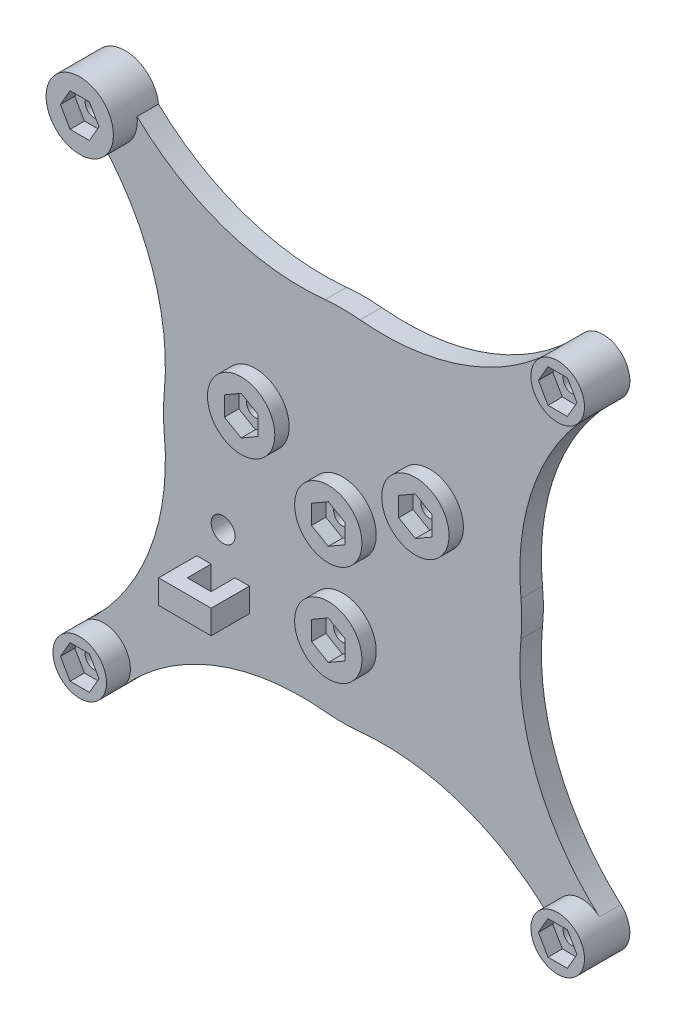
ISO-10303-21;
HEADER;
FILE_DESCRIPTION(('STEP AP214'),'2;1');
FILE_NAME('part.step','',(''),(''),'','','');
FILE_SCHEMA(('AUTOMOTIVE_DESIGN { 1 0 10303 214 1 1 1 1 }'));
ENDSEC;
DATA;
#1=APPLICATION_CONTEXT('core data for automotive mechanical design processes');
#2=APPLICATION_PROTOCOL_DEFINITION('international standard','automotive_design',2000,#1);
#3=PRODUCT_CONTEXT('',#1,'mechanical');
#4=PRODUCT('Part','Part','',(#3));
#5=PRODUCT_RELATED_PRODUCT_CATEGORY('part','',(#4));
#6=PRODUCT_DEFINITION_FORMATION('','',#4);
#7=PRODUCT_DEFINITION_CONTEXT('part definition',#1,'design');
#8=PRODUCT_DEFINITION('design','',#6,#7);
#9=PRODUCT_DEFINITION_SHAPE('','',#8);
#10=(LENGTH_UNIT() NAMED_UNIT(*) SI_UNIT(.MILLI.,.METRE.));
#11=(NAMED_UNIT(*) PLANE_ANGLE_UNIT() SI_UNIT($,.RADIAN.));
#12=(NAMED_UNIT(*) SI_UNIT($,.STERADIAN.) SOLID_ANGLE_UNIT());
#13=UNCERTAINTY_MEASURE_WITH_UNIT(LENGTH_MEASURE(1.E-05),#10,'distance_accuracy_value','');
#14=(GEOMETRIC_REPRESENTATION_CONTEXT(3) GLOBAL_UNCERTAINTY_ASSIGNED_CONTEXT((#13)) GLOBAL_UNIT_ASSIGNED_CONTEXT((#10,
#11,#12)) REPRESENTATION_CONTEXT('',''));
#15=CARTESIAN_POINT('',(0.,0.,0.));
#16=DIRECTION('',(0.,0.,1.));
#17=DIRECTION('',(1.,0.,0.));
#18=AXIS2_PLACEMENT_3D('',#15,#16,#17);
#19=CARTESIAN_POINT('',(-50.,50.,3.));
#20=DIRECTION('',(0.,0.,-1.));
#21=DIRECTION('',(-1.,0.,0.));
#22=AXIS2_PLACEMENT_3D('',#19,#20,#21);
#23=CYLINDRICAL_SURFACE('',#22,1.875);
#24=CARTESIAN_POINT('',(-50.,50.,5.));
#25=DIRECTION('',(0.,0.,1.));
#26=DIRECTION('',(1.,0.,0.));
#27=AXIS2_PLACEMENT_3D('',#24,#25,#26);
#28=CIRCLE('',#27,1.875);
#29=CARTESIAN_POINT('',(-48.125,50.,5.));
#30=VERTEX_POINT('',#29);
#31=EDGE_CURVE('E1074',#30,#30,#28,.T.);
#32=ORIENTED_EDGE('',*,*,#31,.T.);
#33=EDGE_LOOP('',(#32));
#34=FACE_BOUND('',#33,.T.);
#35=CARTESIAN_POINT('',(-50.,50.,0.5));
#36=DIRECTION('',(0.,0.,-1.));
#37=DIRECTION('',(-1.,0.,0.));
#38=AXIS2_PLACEMENT_3D('',#35,#36,#37);
#39=CIRCLE('',#38,1.875);
#40=CARTESIAN_POINT('',(-51.875,50.,0.5));
#41=VERTEX_POINT('',#40);
#42=EDGE_CURVE('E39',#41,#41,#39,.T.);
#43=ORIENTED_EDGE('',*,*,#42,.T.);
#44=EDGE_LOOP('',(#43));
#45=FACE_BOUND('',#44,.T.);
#46=ADVANCED_FACE('F35',(#34,#45),#23,.F.);
#47=CARTESIAN_POINT('',(50.,-50.,3.));
#48=DIRECTION('',(0.,0.,-1.));
#49=DIRECTION('',(-1.,0.,0.));
#50=AXIS2_PLACEMENT_3D('',#47,#48,#49);
#51=CYLINDRICAL_SURFACE('',#50,1.875);
#52=CARTESIAN_POINT('',(50.,-50.,5.));
#53=DIRECTION('',(0.,0.,1.));
#54=DIRECTION('',(1.,0.,0.));
#55=AXIS2_PLACEMENT_3D('',#52,#53,#54);
#56=CIRCLE('',#55,1.875);
#57=CARTESIAN_POINT('',(51.875,-50.,5.));
#58=VERTEX_POINT('',#57);
#59=EDGE_CURVE('E1095',#58,#58,#56,.T.);
#60=ORIENTED_EDGE('',*,*,#59,.T.);
#61=EDGE_LOOP('',(#60));
#62=FACE_BOUND('',#61,.T.);
#63=CARTESIAN_POINT('',(50.,-50.,0.5));
#64=DIRECTION('',(0.,0.,-1.));
#65=DIRECTION('',(-1.,0.,0.));
#66=AXIS2_PLACEMENT_3D('',#63,#64,#65);
#67=CIRCLE('',#66,1.875);
#68=CARTESIAN_POINT('',(48.125,-50.,0.5));
#69=VERTEX_POINT('',#68);
#70=EDGE_CURVE('E1035',#69,#69,#67,.T.);
#71=ORIENTED_EDGE('',*,*,#70,.T.);
#72=EDGE_LOOP('',(#71));
#73=FACE_BOUND('',#72,.T.);
#74=ADVANCED_FACE('F1382',(#62,#73),#51,.F.);
#75=CARTESIAN_POINT('',(-50.,-50.,3.));
#76=DIRECTION('',(0.,0.,-1.));
#77=DIRECTION('',(-1.,0.,0.));
#78=AXIS2_PLACEMENT_3D('',#75,#76,#77);
#79=CYLINDRICAL_SURFACE('',#78,1.875);
#80=CARTESIAN_POINT('',(-50.,-50.,5.));
#81=DIRECTION('',(0.,0.,1.));
#82=DIRECTION('',(1.,0.,0.));
#83=AXIS2_PLACEMENT_3D('',#80,#81,#82);
#84=CIRCLE('',#83,1.875);
#85=CARTESIAN_POINT('',(-48.125,-50.,5.));
#86=VERTEX_POINT('',#85);
#87=EDGE_CURVE('E1116',#86,#86,#84,.T.);
#88=ORIENTED_EDGE('',*,*,#87,.T.);
#89=EDGE_LOOP('',(#88));
#90=FACE_BOUND('',#89,.T.);
#91=CARTESIAN_POINT('',(-50.,-50.,0.5));
#92=DIRECTION('',(0.,0.,-1.));
#93=DIRECTION('',(-1.,0.,0.));
#94=AXIS2_PLACEMENT_3D('',#91,#92,#93);
#95=CIRCLE('',#94,1.875);
#96=CARTESIAN_POINT('',(-51.875,-50.,0.5));
#97=VERTEX_POINT('',#96);
#98=EDGE_CURVE('E1033',#97,#97,#95,.T.);
#99=ORIENTED_EDGE('',*,*,#98,.T.);
#100=EDGE_LOOP('',(#99));
#101=FACE_BOUND('',#100,.T.);
#102=ADVANCED_FACE('F1388',(#90,#101),#79,.F.);
#103=CARTESIAN_POINT('',(50.,50.,3.));
#104=DIRECTION('',(0.,0.,-1.));
#105=DIRECTION('',(-1.,0.,0.));
#106=AXIS2_PLACEMENT_3D('',#103,#104,#105);
#107=CYLINDRICAL_SURFACE('',#106,1.875);
#108=CARTESIAN_POINT('',(50.,50.,5.));
#109=DIRECTION('',(0.,0.,1.));
#110=DIRECTION('',(1.,0.,0.));
#111=AXIS2_PLACEMENT_3D('',#108,#109,#110);
#112=CIRCLE('',#111,1.875);
#113=CARTESIAN_POINT('',(51.875,50.,5.));
#114=VERTEX_POINT('',#113);
#115=EDGE_CURVE('E1057',#114,#114,#112,.T.);
#116=ORIENTED_EDGE('',*,*,#115,.T.);
#117=EDGE_LOOP('',(#116));
#118=FACE_BOUND('',#117,.T.);
#119=CARTESIAN_POINT('',(50.,50.,0.5));
#120=DIRECTION('',(0.,0.,-1.));
#121=DIRECTION('',(-1.,0.,0.));
#122=AXIS2_PLACEMENT_3D('',#119,#120,#121);
#123=CIRCLE('',#122,1.875);
#124=CARTESIAN_POINT('',(48.125,50.,0.5));
#125=VERTEX_POINT('',#124);
#126=EDGE_CURVE('E570',#125,#125,#123,.T.);
#127=ORIENTED_EDGE('',*,*,#126,.T.);
#128=EDGE_LOOP('',(#127));
#129=FACE_BOUND('',#128,.T.);
#130=ADVANCED_FACE('F1393',(#118,#129),#107,.F.);
#131=CARTESIAN_POINT('',(-50.,50.,3.));
#132=DIRECTION('',(0.,0.,-1.));
#133=DIRECTION('',(-1.,0.,0.));
#134=AXIS2_PLACEMENT_3D('',#131,#132,#133);
#135=PLANE('',#134);
#136=DIRECTION('',(0.,-1.,0.));
#137=VECTOR('',#136,1.);
#138=CARTESIAN_POINT('',(-30.5,-22.5,3.));
#139=LINE('',#138,#137);
#140=CARTESIAN_POINT('',(-30.5,-22.5,3.));
#141=VERTEX_POINT('',#140);
#142=CARTESIAN_POINT('',(-30.5,-27.5,3.));
#143=VERTEX_POINT('',#142);
#144=EDGE_CURVE('E1182',#141,#143,#139,.T.);
#145=ORIENTED_EDGE('',*,*,#144,.F.);
#146=DIRECTION('',(-1.,0.,0.));
#147=VECTOR('',#146,1.);
#148=CARTESIAN_POINT('',(-30.5,-22.5,3.));
#149=LINE('',#148,#147);
#150=CARTESIAN_POINT('',(-27.5,-22.5,3.));
#151=VERTEX_POINT('',#150);
#152=EDGE_CURVE('E1187',#151,#141,#149,.T.);
#153=ORIENTED_EDGE('',*,*,#152,.F.);
#154=DIRECTION('',(0.,1.,0.));
#155=VECTOR('',#154,1.);
#156=CARTESIAN_POINT('',(-27.5,-22.5,3.));
#157=LINE('',#156,#155);
#158=CARTESIAN_POINT('',(-27.5,-27.5,3.));
#159=VERTEX_POINT('',#158);
#160=EDGE_CURVE('E1193',#159,#151,#157,.T.);
#161=ORIENTED_EDGE('',*,*,#160,.F.);
#162=DIRECTION('',(1.,0.,0.));
#163=VECTOR('',#162,1.);
#164=CARTESIAN_POINT('',(-30.5,-27.5,3.));
#165=LINE('',#164,#163);
#166=EDGE_CURVE('E1190',#143,#159,#165,.T.);
#167=ORIENTED_EDGE('',*,*,#166,.F.);
#168=EDGE_LOOP('',(#145,#153,#161,#167));
#169=FACE_BOUND('',#168,.T.);
#170=CARTESIAN_POINT('',(-25.,-15.,3.));
#171=DIRECTION('',(0.,0.,1.));
#172=DIRECTION('',(1.,0.,0.));
#173=AXIS2_PLACEMENT_3D('',#170,#171,#172);
#174=CIRCLE('',#173,2.5);
#175=CARTESIAN_POINT('',(-22.5,-15.,3.));
#176=VERTEX_POINT('',#175);
#177=EDGE_CURVE('E1210',#176,#176,#174,.T.);
#178=ORIENTED_EDGE('',*,*,#177,.F.);
#179=EDGE_LOOP('',(#178));
#180=FACE_BOUND('',#179,.T.);
#181=CARTESIAN_POINT('',(-8.5695524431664,87.0793475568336,3.));
#182=DIRECTION('',(0.,0.,1.));
#183=DIRECTION('',(1.,0.,0.));
#184=AXIS2_PLACEMENT_3D('',#181,#182,#183);
#185=CIRCLE('',#184,50.);
#186=CARTESIAN_POINT('',(-43.0076308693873,50.8299509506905,3.));
#187=VERTEX_POINT('',#186);
#188=CARTESIAN_POINT('',(-3.67266533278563,37.3197203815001,3.));
#189=VERTEX_POINT('',#188);
#190=EDGE_CURVE('E869',#187,#189,#185,.T.);
#191=ORIENTED_EDGE('',*,*,#190,.F.);
#192=CARTESIAN_POINT('',(-50.,50.,3.));
#193=DIRECTION('',(0.,0.,-1.));
#194=DIRECTION('',(-1.,0.,0.));
#195=AXIS2_PLACEMENT_3D('',#192,#193,#194);
#196=CIRCLE('',#195,7.04145188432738);
#197=CARTESIAN_POINT('',(-50.8299509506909,43.0076308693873,3.));
#198=VERTEX_POINT('',#197);
#199=EDGE_CURVE('E579',#187,#198,#196,.T.);
#200=ORIENTED_EDGE('',*,*,#199,.T.);
#201=CARTESIAN_POINT('',(-87.0793475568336,8.5695524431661,3.));
#202=DIRECTION('',(0.,0.,1.));
#203=DIRECTION('',(0.,-1.,0.));
#204=AXIS2_PLACEMENT_3D('',#201,#202,#203);
#205=CIRCLE('',#204,50.);
#206=CARTESIAN_POINT('',(-37.3197203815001,3.67266533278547,3.));
#207=VERTEX_POINT('',#206);
#208=EDGE_CURVE('E578',#207,#198,#205,.T.);
#209=ORIENTED_EDGE('',*,*,#208,.F.);
#210=CARTESIAN_POINT('',(0.,0.,3.));
#211=DIRECTION('',(0.,0.,-1.));
#212=DIRECTION('',(0.,1.,0.));
#213=AXIS2_PLACEMENT_3D('',#210,#211,#212);
#214=CIRCLE('',#213,37.5);
#215=CARTESIAN_POINT('',(-37.3197203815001,-3.67266533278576,3.));
#216=VERTEX_POINT('',#215);
#217=EDGE_CURVE('E862',#216,#207,#214,.T.);
#218=ORIENTED_EDGE('',*,*,#217,.F.);
#219=CARTESIAN_POINT('',(-87.0793475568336,-8.5695524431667,3.));
#220=DIRECTION('',(0.,0.,1.));
#221=DIRECTION('',(0.,1.,0.));
#222=AXIS2_PLACEMENT_3D('',#219,#220,#221);
#223=CIRCLE('',#222,50.);
#224=CARTESIAN_POINT('',(-53.7346105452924,-45.8271491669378,3.));
#225=VERTEX_POINT('',#224);
#226=EDGE_CURVE('E854',#225,#216,#223,.T.);
#227=ORIENTED_EDGE('',*,*,#226,.F.);
#228=CARTESIAN_POINT('',(-50.,-50.,3.));
#229=DIRECTION('',(0.,0.,1.));
#230=DIRECTION('',(1.,0.,0.));
#231=AXIS2_PLACEMENT_3D('',#228,#229,#230);
#232=CIRCLE('',#231,5.6);
#233=CARTESIAN_POINT('',(-45.8271491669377,-53.7346105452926,3.));
#234=VERTEX_POINT('',#233);
#235=EDGE_CURVE('E918',#234,#225,#232,.T.);
#236=ORIENTED_EDGE('',*,*,#235,.F.);
#237=CARTESIAN_POINT('',(-8.5695524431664,-87.0793475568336,3.));
#238=DIRECTION('',(0.,0.,1.));
#239=DIRECTION('',(1.,0.,0.));
#240=AXIS2_PLACEMENT_3D('',#237,#238,#239);
#241=CIRCLE('',#240,50.);
#242=CARTESIAN_POINT('',(-3.6726653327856,-37.3197203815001,3.));
#243=VERTEX_POINT('',#242);
#244=EDGE_CURVE('E848',#243,#234,#241,.T.);
#245=ORIENTED_EDGE('',*,*,#244,.F.);
#246=CARTESIAN_POINT('',(0.,0.,3.));
#247=DIRECTION('',(0.,0.,-1.));
#248=DIRECTION('',(-1.,0.,0.));
#249=AXIS2_PLACEMENT_3D('',#246,#247,#248);
#250=CIRCLE('',#249,37.5);
#251=CARTESIAN_POINT('',(3.67266533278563,-37.3197203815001,3.));
#252=VERTEX_POINT('',#251);
#253=EDGE_CURVE('E845',#252,#243,#250,.T.);
#254=ORIENTED_EDGE('',*,*,#253,.F.);
#255=CARTESIAN_POINT('',(8.5695524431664,-87.0793475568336,3.));
#256=DIRECTION('',(0.,0.,1.));
#257=DIRECTION('',(-1.,0.,0.));
#258=AXIS2_PLACEMENT_3D('',#255,#256,#257);
#259=CIRCLE('',#258,50.);
#260=CARTESIAN_POINT('',(45.8271491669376,-53.7346105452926,3.));
#261=VERTEX_POINT('',#260);
#262=EDGE_CURVE('E837',#261,#252,#259,.T.);
#263=ORIENTED_EDGE('',*,*,#262,.F.);
#264=CARTESIAN_POINT('',(50.,-50.,3.));
#265=DIRECTION('',(0.,0.,1.));
#266=DIRECTION('',(1.,0.,0.));
#267=AXIS2_PLACEMENT_3D('',#264,#265,#266);
#268=CIRCLE('',#267,5.6);
#269=CARTESIAN_POINT('',(53.7346105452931,-45.8271491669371,3.));
#270=VERTEX_POINT('',#269);
#271=EDGE_CURVE('E983',#270,#261,#268,.T.);
#272=ORIENTED_EDGE('',*,*,#271,.F.);
#273=CARTESIAN_POINT('',(87.0793475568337,-8.56955244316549,3.));
#274=DIRECTION('',(0.,0.,1.));
#275=DIRECTION('',(0.,1.,0.));
#276=AXIS2_PLACEMENT_3D('',#273,#274,#275);
#277=CIRCLE('',#276,50.);
#278=CARTESIAN_POINT('',(37.3197203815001,-3.67266533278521,3.));
#279=VERTEX_POINT('',#278);
#280=EDGE_CURVE('E831',#279,#270,#277,.T.);
#281=ORIENTED_EDGE('',*,*,#280,.F.);
#282=CARTESIAN_POINT('',(0.,0.,3.));
#283=DIRECTION('',(0.,0.,-1.));
#284=DIRECTION('',(0.,-1.,0.));
#285=AXIS2_PLACEMENT_3D('',#282,#283,#284);
#286=CIRCLE('',#285,37.5);
#287=CARTESIAN_POINT('',(37.3197203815,3.67266533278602,3.));
#288=VERTEX_POINT('',#287);
#289=EDGE_CURVE('E828',#288,#279,#286,.T.);
#290=ORIENTED_EDGE('',*,*,#289,.F.);
#291=CARTESIAN_POINT('',(87.0793475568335,8.56955244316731,3.));
#292=DIRECTION('',(0.,0.,1.));
#293=DIRECTION('',(0.,-1.,0.));
#294=AXIS2_PLACEMENT_3D('',#291,#292,#293);
#295=CIRCLE('',#294,50.);
#296=CARTESIAN_POINT('',(53.7346105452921,45.8271491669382,3.));
#297=VERTEX_POINT('',#296);
#298=EDGE_CURVE('E825',#297,#288,#295,.T.);
#299=ORIENTED_EDGE('',*,*,#298,.F.);
#300=CARTESIAN_POINT('',(50.,50.,3.));
#301=DIRECTION('',(0.,0.,1.));
#302=DIRECTION('',(1.,0.,0.));
#303=AXIS2_PLACEMENT_3D('',#300,#301,#302);
#304=CIRCLE('',#303,5.6);
#305=CARTESIAN_POINT('',(45.8271491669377,53.7346105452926,3.));
#306=VERTEX_POINT('',#305);
#307=EDGE_CURVE('E1019',#306,#297,#304,.T.);
#308=ORIENTED_EDGE('',*,*,#307,.F.);
#309=CARTESIAN_POINT('',(8.5695524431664,87.0793475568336,3.));
#310=DIRECTION('',(0.,0.,1.));
#311=DIRECTION('',(-1.,0.,0.));
#312=AXIS2_PLACEMENT_3D('',#309,#310,#311);
#313=CIRCLE('',#312,50.);
#314=CARTESIAN_POINT('',(3.6726653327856,37.3197203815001,3.));
#315=VERTEX_POINT('',#314);
#316=EDGE_CURVE('E878',#315,#306,#313,.T.);
#317=ORIENTED_EDGE('',*,*,#316,.F.);
#318=CARTESIAN_POINT('',(0.,0.,3.));
#319=DIRECTION('',(0.,0.,-1.));
#320=DIRECTION('',(1.,0.,0.));
#321=AXIS2_PLACEMENT_3D('',#318,#319,#320);
#322=CIRCLE('',#321,37.5);
#323=EDGE_CURVE('E875',#189,#315,#322,.T.);
#324=ORIENTED_EDGE('',*,*,#323,.F.);
#325=EDGE_LOOP('',(#191,#200,#209,#218,#227,#236,#245,#254,#263,#272,#281,#290,#299,#308,#317,#324));
#326=FACE_BOUND('',#325,.T.);
#327=CARTESIAN_POINT('',(-18.2272413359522,10.5235026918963,3.));
#328=DIRECTION('',(0.,0.,-1.));
#329=DIRECTION('',(-1.,0.,0.));
#330=AXIS2_PLACEMENT_3D('',#327,#328,#329);
#331=CIRCLE('',#330,7.04145188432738);
#332=CARTESIAN_POINT('',(-25.2686932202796,10.5235026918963,3.));
#333=VERTEX_POINT('',#332);
#334=EDGE_CURVE('E1022',#333,#333,#331,.F.);
#335=ORIENTED_EDGE('',*,*,#334,.F.);
#336=EDGE_LOOP('',(#335));
#337=FACE_BOUND('',#336,.T.);
#338=CARTESIAN_POINT('',(0.,-21.0470053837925,3.));
#339=DIRECTION('',(0.,0.,-1.));
#340=DIRECTION('',(-1.,0.,0.));
#341=AXIS2_PLACEMENT_3D('',#338,#339,#340);
#342=CIRCLE('',#341,7.04145188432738);
#343=CARTESIAN_POINT('',(-7.04145188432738,-21.0470053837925,3.));
#344=VERTEX_POINT('',#343);
#345=EDGE_CURVE('E1025',#344,#344,#342,.F.);
#346=ORIENTED_EDGE('',*,*,#345,.F.);
#347=EDGE_LOOP('',(#346));
#348=FACE_BOUND('',#347,.T.);
#349=CARTESIAN_POINT('',(18.2272413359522,10.5235026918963,3.));
#350=DIRECTION('',(0.,0.,-1.));
#351=DIRECTION('',(-1.,0.,0.));
#352=AXIS2_PLACEMENT_3D('',#349,#350,#351);
#353=CIRCLE('',#352,7.04145188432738);
#354=CARTESIAN_POINT('',(11.1857894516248,10.5235026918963,3.));
#355=VERTEX_POINT('',#354);
#356=EDGE_CURVE('E44',#355,#355,#353,.F.);
#357=ORIENTED_EDGE('',*,*,#356,.F.);
#358=EDGE_LOOP('',(#357));
#359=FACE_BOUND('',#358,.T.);
#360=CARTESIAN_POINT('',(0.,0.,3.));
#361=DIRECTION('',(0.,0.,-1.));
#362=DIRECTION('',(-1.,0.,0.));
#363=AXIS2_PLACEMENT_3D('',#360,#361,#362);
#364=CIRCLE('',#363,7.04145188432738);
#365=CARTESIAN_POINT('',(-7.04145188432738,0.,3.));
#366=VERTEX_POINT('',#365);
#367=EDGE_CURVE('E11',#366,#366,#364,.F.);
#368=ORIENTED_EDGE('',*,*,#367,.F.);
#369=EDGE_LOOP('',(#368));
#370=FACE_BOUND('',#369,.T.);
#371=DIRECTION('',(0.,-1.,0.));
#372=VECTOR('',#371,1.);
#373=CARTESIAN_POINT('',(-22.5,-22.5,3.));
#374=LINE('',#373,#372);
#375=CARTESIAN_POINT('',(-22.5,-22.5,3.));
#376=VERTEX_POINT('',#375);
#377=CARTESIAN_POINT('',(-22.5,-27.5,3.));
#378=VERTEX_POINT('',#377);
#379=EDGE_CURVE('E1151',#376,#378,#374,.T.);
#380=ORIENTED_EDGE('',*,*,#379,.F.);
#381=DIRECTION('',(-1.,0.,0.));
#382=VECTOR('',#381,1.);
#383=CARTESIAN_POINT('',(-22.5,-22.5,3.));
#384=LINE('',#383,#382);
#385=CARTESIAN_POINT('',(-19.5,-22.5,3.));
#386=VERTEX_POINT('',#385);
#387=EDGE_CURVE('E1160',#386,#376,#384,.T.);
#388=ORIENTED_EDGE('',*,*,#387,.F.);
#389=DIRECTION('',(0.,1.,0.));
#390=VECTOR('',#389,1.);
#391=CARTESIAN_POINT('',(-19.5,-22.5,3.));
#392=LINE('',#391,#390);
#393=CARTESIAN_POINT('',(-19.5,-27.5,3.));
#394=VERTEX_POINT('',#393);
#395=EDGE_CURVE('E1166',#394,#386,#392,.T.);
#396=ORIENTED_EDGE('',*,*,#395,.F.);
#397=DIRECTION('',(1.,0.,0.));
#398=VECTOR('',#397,1.);
#399=CARTESIAN_POINT('',(-22.5,-27.5,3.));
#400=LINE('',#399,#398);
#401=EDGE_CURVE('E1163',#378,#394,#400,.T.);
#402=ORIENTED_EDGE('',*,*,#401,.F.);
#403=EDGE_LOOP('',(#380,#388,#396,#402));
#404=FACE_BOUND('',#403,.T.);
#405=ADVANCED_FACE('F1322',(#169,#180,#326,#337,#348,#359,#370,#404),#135,.F.);
#406=CARTESIAN_POINT('',(-50.,50.,0.));
#407=DIRECTION('',(0.,0.,-1.));
#408=DIRECTION('',(-1.,0.,0.));
#409=AXIS2_PLACEMENT_3D('',#406,#407,#408);
#410=PLANE('',#409);
#411=DIRECTION('',(0.,-1.,0.));
#412=VECTOR('',#411,1.);
#413=CARTESIAN_POINT('',(20.5,-0.288675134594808,0.));
#414=LINE('',#413,#412);
#415=CARTESIAN_POINT('',(20.5,11.8356805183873,0.));
#416=VERTEX_POINT('',#415);
#417=CARTESIAN_POINT('',(20.5,-0.28867513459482,0.));
#418=VERTEX_POINT('',#417);
#419=EDGE_CURVE('E1213',#416,#418,#414,.T.);
#420=ORIENTED_EDGE('',*,*,#419,.T.);
#421=DIRECTION('',(-0.866025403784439,-0.5,0.));
#422=VECTOR('',#421,1.);
#423=CARTESIAN_POINT('',(10.5,-6.06217782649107,0.));
#424=LINE('',#423,#422);
#425=CARTESIAN_POINT('',(10.5,-6.06217782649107,0.));
#426=VERTEX_POINT('',#425);
#427=EDGE_CURVE('E1244',#418,#426,#424,.T.);
#428=ORIENTED_EDGE('',*,*,#427,.T.);
#429=DIRECTION('',(0.,-1.,0.));
#430=VECTOR('',#429,1.);
#431=CARTESIAN_POINT('',(10.5,-17.6091832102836,0.));
#432=LINE('',#431,#430);
#433=CARTESIAN_POINT('',(10.5,-17.6091832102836,0.));
#434=VERTEX_POINT('',#433);
#435=EDGE_CURVE('E1246',#426,#434,#432,.T.);
#436=ORIENTED_EDGE('',*,*,#435,.T.);
#437=DIRECTION('',(-0.866025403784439,-0.5,0.));
#438=VECTOR('',#437,1.);
#439=CARTESIAN_POINT('',(0.,-23.6713610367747,0.));
#440=LINE('',#439,#438);
#441=CARTESIAN_POINT('',(0.,-23.6713610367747,0.));
#442=VERTEX_POINT('',#441);
#443=EDGE_CURVE('E1248',#434,#442,#440,.T.);
#444=ORIENTED_EDGE('',*,*,#443,.T.);
#445=DIRECTION('',(-0.866025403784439,0.5,0.));
#446=VECTOR('',#445,1.);
#447=CARTESIAN_POINT('',(-10.5,-17.6091832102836,0.));
#448=LINE('',#447,#446);
#449=CARTESIAN_POINT('',(-10.5,-17.6091832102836,0.));
#450=VERTEX_POINT('',#449);
#451=EDGE_CURVE('E1250',#442,#450,#448,.T.);
#452=ORIENTED_EDGE('',*,*,#451,.T.);
#453=DIRECTION('',(0.,1.,0.));
#454=VECTOR('',#453,1.);
#455=CARTESIAN_POINT('',(-10.5,-6.06217782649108,0.));
#456=LINE('',#455,#454);
#457=CARTESIAN_POINT('',(-10.5,-6.06217782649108,0.));
#458=VERTEX_POINT('',#457);
#459=EDGE_CURVE('E1252',#450,#458,#456,.T.);
#460=ORIENTED_EDGE('',*,*,#459,.T.);
#461=DIRECTION('',(-0.866025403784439,0.5,0.));
#462=VECTOR('',#461,1.);
#463=CARTESIAN_POINT('',(-20.5,-0.28867513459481,0.));
#464=LINE('',#463,#462);
#465=CARTESIAN_POINT('',(-20.5,-0.28867513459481,0.));
#466=VERTEX_POINT('',#465);
#467=EDGE_CURVE('E1254',#458,#466,#464,.T.);
#468=ORIENTED_EDGE('',*,*,#467,.T.);
#469=DIRECTION('',(0.,1.,0.));
#470=VECTOR('',#469,1.);
#471=CARTESIAN_POINT('',(-20.5,11.8356805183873,0.));
#472=LINE('',#471,#470);
#473=CARTESIAN_POINT('',(-20.5,11.8356805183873,0.));
#474=VERTEX_POINT('',#473);
#475=EDGE_CURVE('E1256',#466,#474,#472,.T.);
#476=ORIENTED_EDGE('',*,*,#475,.T.);
#477=DIRECTION('',(0.866025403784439,0.5,0.));
#478=VECTOR('',#477,1.);
#479=CARTESIAN_POINT('',(-10.,17.8978583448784,0.));
#480=LINE('',#479,#478);
#481=CARTESIAN_POINT('',(-10.,17.8978583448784,0.));
#482=VERTEX_POINT('',#481);
#483=EDGE_CURVE('E1258',#474,#482,#480,.T.);
#484=ORIENTED_EDGE('',*,*,#483,.T.);
#485=DIRECTION('',(0.866025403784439,-0.5,0.));
#486=VECTOR('',#485,1.);
#487=CARTESIAN_POINT('',(0.,12.1243556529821,0.));
#488=LINE('',#487,#486);
#489=CARTESIAN_POINT('',(0.,12.1243556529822,0.));
#490=VERTEX_POINT('',#489);
#491=EDGE_CURVE('E1260',#482,#490,#488,.T.);
#492=ORIENTED_EDGE('',*,*,#491,.T.);
#493=DIRECTION('',(0.866025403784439,0.5,0.));
#494=VECTOR('',#493,1.);
#495=CARTESIAN_POINT('',(10.,17.8978583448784,0.));
#496=LINE('',#495,#494);
#497=CARTESIAN_POINT('',(10.,17.8978583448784,0.));
#498=VERTEX_POINT('',#497);
#499=EDGE_CURVE('E1262',#490,#498,#496,.T.);
#500=ORIENTED_EDGE('',*,*,#499,.T.);
#501=DIRECTION('',(0.866025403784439,-0.5,0.));
#502=VECTOR('',#501,1.);
#503=CARTESIAN_POINT('',(20.5,11.8356805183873,0.));
#504=LINE('',#503,#502);
#505=EDGE_CURVE('E1219',#498,#416,#504,.T.);
#506=ORIENTED_EDGE('',*,*,#505,.T.);
#507=EDGE_LOOP('',(#420,#428,#436,#444,#452,#460,#468,#476,#484,#492,#500,#506));
#508=FACE_BOUND('',#507,.T.);
#509=CARTESIAN_POINT('',(18.2272413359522,10.5235026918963,0.));
#510=DIRECTION('',(0.,0.,-1.));
#511=DIRECTION('',(-1.,0.,0.));
#512=AXIS2_PLACEMENT_3D('',#509,#510,#511);
#513=CIRCLE('',#512,1.875);
#514=CARTESIAN_POINT('',(20.1022413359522,10.5235026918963,0.));
#515=VERTEX_POINT('',#514);
#516=EDGE_CURVE('E618',#515,#515,#513,.F.);
#517=ORIENTED_EDGE('',*,*,#516,.T.);
#518=EDGE_LOOP('',(#517));
#519=FACE_BOUND('',#518,.T.);
#520=CARTESIAN_POINT('',(0.,-21.0470053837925,0.));
#521=DIRECTION('',(0.,0.,-1.));
#522=DIRECTION('',(-1.,0.,0.));
#523=AXIS2_PLACEMENT_3D('',#520,#521,#522);
#524=CIRCLE('',#523,1.875);
#525=CARTESIAN_POINT('',(1.875,-21.0470053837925,0.));
#526=VERTEX_POINT('',#525);
#527=EDGE_CURVE('E624',#526,#526,#524,.F.);
#528=ORIENTED_EDGE('',*,*,#527,.T.);
#529=EDGE_LOOP('',(#528));
#530=FACE_BOUND('',#529,.T.);
#531=CARTESIAN_POINT('',(0.,0.,0.));
#532=DIRECTION('',(0.,0.,-1.));
#533=DIRECTION('',(-1.,0.,0.));
#534=AXIS2_PLACEMENT_3D('',#531,#532,#533);
#535=CIRCLE('',#534,1.875);
#536=CARTESIAN_POINT('',(1.875,0.,0.));
#537=VERTEX_POINT('',#536);
#538=EDGE_CURVE('E613',#537,#537,#535,.F.);
#539=ORIENTED_EDGE('',*,*,#538,.T.);
#540=EDGE_LOOP('',(#539));
#541=FACE_BOUND('',#540,.T.);
#542=CARTESIAN_POINT('',(-18.2272413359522,10.5235026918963,0.));
#543=DIRECTION('',(0.,0.,-1.));
#544=DIRECTION('',(-1.,0.,0.));
#545=AXIS2_PLACEMENT_3D('',#542,#543,#544);
#546=CIRCLE('',#545,1.875);
#547=CARTESIAN_POINT('',(-16.3522413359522,10.5235026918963,0.));
#548=VERTEX_POINT('',#547);
#549=EDGE_CURVE('E617',#548,#548,#546,.F.);
#550=ORIENTED_EDGE('',*,*,#549,.T.);
#551=EDGE_LOOP('',(#550));
#552=FACE_BOUND('',#551,.T.);
#553=ADVANCED_FACE('F1396',(#508,#519,#530,#541,#552),#410,.T.);
#554=CARTESIAN_POINT('',(-50.,-50.,3.));
#555=DIRECTION('',(0.,0.,-1.));
#556=DIRECTION('',(-1.,0.,0.));
#557=AXIS2_PLACEMENT_3D('',#554,#555,#556);
#558=CYLINDRICAL_SURFACE('',#557,5.6);
#559=CARTESIAN_POINT('',(-50.,-50.,8.));
#560=DIRECTION('',(0.,0.,1.));
#561=DIRECTION('',(1.,0.,0.));
#562=AXIS2_PLACEMENT_3D('',#559,#560,#561);
#563=CIRCLE('',#562,5.6);
#564=CARTESIAN_POINT('',(-44.4,-50.,8.));
#565=VERTEX_POINT('',#564);
#566=EDGE_CURVE('E919',#565,#565,#563,.T.);
#567=ORIENTED_EDGE('',*,*,#566,.F.);
#568=EDGE_LOOP('',(#567));
#569=FACE_BOUND('',#568,.T.);
#570=DIRECTION('',(0.,0.,1.));
#571=VECTOR('',#570,1.);
#572=CARTESIAN_POINT('',(-45.8271491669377,-53.7346105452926,-0.00100000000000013));
#573=LINE('',#572,#571);
#574=CARTESIAN_POINT('',(-45.8271491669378,-53.7346105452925,-1.5));
#575=VERTEX_POINT('',#574);
#576=EDGE_CURVE('E852',#575,#234,#573,.T.);
#577=ORIENTED_EDGE('',*,*,#576,.T.);
#578=ORIENTED_EDGE('',*,*,#235,.T.);
#579=DIRECTION('',(0.,0.,1.));
#580=VECTOR('',#579,1.);
#581=CARTESIAN_POINT('',(-53.7346105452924,-45.8271491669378,-0.00100000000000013));
#582=LINE('',#581,#580);
#583=CARTESIAN_POINT('',(-53.7346105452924,-45.8271491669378,-1.5));
#584=VERTEX_POINT('',#583);
#585=EDGE_CURVE('E866',#584,#225,#582,.T.);
#586=ORIENTED_EDGE('',*,*,#585,.F.);
#587=CARTESIAN_POINT('',(-50.,-50.,-1.5));
#588=DIRECTION('',(0.,0.,-1.));
#589=DIRECTION('',(-1.,0.,0.));
#590=AXIS2_PLACEMENT_3D('',#587,#588,#589);
#591=CIRCLE('',#590,5.59999999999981);
#592=EDGE_CURVE('E1311',#575,#584,#591,.T.);
#593=ORIENTED_EDGE('',*,*,#592,.F.);
#594=EDGE_LOOP('',(#577,#578,#586,#593));
#595=FACE_BOUND('',#594,.T.);
#596=ADVANCED_FACE('F37',(#569,#595),#558,.T.);
#597=CARTESIAN_POINT('',(50.,-50.,3.));
#598=DIRECTION('',(0.,0.,-1.));
#599=DIRECTION('',(-1.,0.,0.));
#600=AXIS2_PLACEMENT_3D('',#597,#598,#599);
#601=CYLINDRICAL_SURFACE('',#600,5.6);
#602=CARTESIAN_POINT('',(50.,-50.,8.));
#603=DIRECTION('',(0.,0.,1.));
#604=DIRECTION('',(1.,0.,0.));
#605=AXIS2_PLACEMENT_3D('',#602,#603,#604);
#606=CIRCLE('',#605,5.6);
#607=CARTESIAN_POINT('',(55.6,-50.,8.));
#608=VERTEX_POINT('',#607);
#609=EDGE_CURVE('E984',#608,#608,#606,.T.);
#610=ORIENTED_EDGE('',*,*,#609,.F.);
#611=EDGE_LOOP('',(#610));
#612=FACE_BOUND('',#611,.T.);
#613=DIRECTION('',(0.,0.,1.));
#614=VECTOR('',#613,1.);
#615=CARTESIAN_POINT('',(53.7346105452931,-45.8271491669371,-0.00100000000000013));
#616=LINE('',#615,#614);
#617=CARTESIAN_POINT('',(53.7346105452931,-45.8271491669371,-1.5));
#618=VERTEX_POINT('',#617);
#619=EDGE_CURVE('E835',#618,#270,#616,.T.);
#620=ORIENTED_EDGE('',*,*,#619,.T.);
#621=ORIENTED_EDGE('',*,*,#271,.T.);
#622=DIRECTION('',(0.,0.,1.));
#623=VECTOR('',#622,1.);
#624=CARTESIAN_POINT('',(45.8271491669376,-53.7346105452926,-0.00100000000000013));
#625=LINE('',#624,#623);
#626=CARTESIAN_POINT('',(45.8271491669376,-53.7346105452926,-1.5));
#627=VERTEX_POINT('',#626);
#628=EDGE_CURVE('E851',#627,#261,#625,.T.);
#629=ORIENTED_EDGE('',*,*,#628,.F.);
#630=CARTESIAN_POINT('',(50.,-50.,-1.5));
#631=DIRECTION('',(0.,0.,-1.));
#632=DIRECTION('',(-1.,0.,0.));
#633=AXIS2_PLACEMENT_3D('',#630,#631,#632);
#634=CIRCLE('',#633,5.60000000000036);
#635=EDGE_CURVE('E1300',#618,#627,#634,.T.);
#636=ORIENTED_EDGE('',*,*,#635,.F.);
#637=EDGE_LOOP('',(#620,#621,#629,#636));
#638=FACE_BOUND('',#637,.T.);
#639=ADVANCED_FACE('F1353',(#612,#638),#601,.T.);
#640=CARTESIAN_POINT('',(50.,50.,3.));
#641=DIRECTION('',(0.,0.,-1.));
#642=DIRECTION('',(-1.,0.,0.));
#643=AXIS2_PLACEMENT_3D('',#640,#641,#642);
#644=CYLINDRICAL_SURFACE('',#643,5.6);
#645=CARTESIAN_POINT('',(50.,50.,8.));
#646=DIRECTION('',(0.,0.,1.));
#647=DIRECTION('',(1.,0.,0.));
#648=AXIS2_PLACEMENT_3D('',#645,#646,#647);
#649=CIRCLE('',#648,5.6);
#650=CARTESIAN_POINT('',(55.6,50.,8.));
#651=VERTEX_POINT('',#650);
#652=EDGE_CURVE('E1016',#651,#651,#649,.T.);
#653=ORIENTED_EDGE('',*,*,#652,.F.);
#654=EDGE_LOOP('',(#653));
#655=FACE_BOUND('',#654,.T.);
#656=DIRECTION('',(0.,0.,1.));
#657=VECTOR('',#656,1.);
#658=CARTESIAN_POINT('',(53.7346105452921,45.8271491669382,-0.00100000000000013));
#659=LINE('',#658,#657);
#660=CARTESIAN_POINT('',(53.7346105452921,45.8271491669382,-1.5));
#661=VERTEX_POINT('',#660);
#662=EDGE_CURVE('E834',#661,#297,#659,.T.);
#663=ORIENTED_EDGE('',*,*,#662,.F.);
#664=CARTESIAN_POINT('',(50.,50.,-1.5));
#665=DIRECTION('',(0.,0.,-1.));
#666=DIRECTION('',(-1.,0.,0.));
#667=AXIS2_PLACEMENT_3D('',#664,#665,#666);
#668=CIRCLE('',#667,5.59999999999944);
#669=CARTESIAN_POINT('',(45.8271491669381,53.7346105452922,-1.5));
#670=VERTEX_POINT('',#669);
#671=EDGE_CURVE('E601',#670,#661,#668,.T.);
#672=ORIENTED_EDGE('',*,*,#671,.F.);
#673=DIRECTION('',(0.,0.,1.));
#674=VECTOR('',#673,1.);
#675=CARTESIAN_POINT('',(45.8271491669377,53.7346105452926,-0.00100000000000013));
#676=LINE('',#675,#674);
#677=EDGE_CURVE('E882',#670,#306,#676,.T.);
#678=ORIENTED_EDGE('',*,*,#677,.T.);
#679=ORIENTED_EDGE('',*,*,#307,.T.);
#680=EDGE_LOOP('',(#663,#672,#678,#679));
#681=FACE_BOUND('',#680,.T.);
#682=ADVANCED_FACE('F1337',(#655,#681),#644,.T.);
#683=CARTESIAN_POINT('',(50.,50.,8.));
#684=DIRECTION('',(0.,0.,1.));
#685=DIRECTION('',(1.,0.,0.));
#686=AXIS2_PLACEMENT_3D('',#683,#684,#685);
#687=PLANE('',#686);
#688=ORIENTED_EDGE('',*,*,#652,.T.);
#689=EDGE_LOOP('',(#688));
#690=FACE_BOUND('',#689,.T.);
#691=DIRECTION('',(-0.5,0.866025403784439,0.));
#692=VECTOR('',#691,1.);
#693=CARTESIAN_POINT('',(54.0414518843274,50.,8.));
#694=LINE('',#693,#692);
#695=CARTESIAN_POINT('',(54.0414518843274,50.,8.));
#696=VERTEX_POINT('',#695);
#697=CARTESIAN_POINT('',(52.0207259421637,53.5,8.));
#698=VERTEX_POINT('',#697);
#699=EDGE_CURVE('E991',#696,#698,#694,.T.);
#700=ORIENTED_EDGE('',*,*,#699,.F.);
#701=DIRECTION('',(0.499999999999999,0.866025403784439,0.));
#702=VECTOR('',#701,1.);
#703=CARTESIAN_POINT('',(52.0207259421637,46.5,8.));
#704=LINE('',#703,#702);
#705=CARTESIAN_POINT('',(52.0207259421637,46.5,8.));
#706=VERTEX_POINT('',#705);
#707=EDGE_CURVE('E987',#706,#696,#704,.T.);
#708=ORIENTED_EDGE('',*,*,#707,.F.);
#709=DIRECTION('',(1.,0.,0.));
#710=VECTOR('',#709,1.);
#711=CARTESIAN_POINT('',(47.9792740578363,46.5,8.));
#712=LINE('',#711,#710);
#713=CARTESIAN_POINT('',(47.9792740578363,46.5,8.));
#714=VERTEX_POINT('',#713);
#715=EDGE_CURVE('E1000',#714,#706,#712,.T.);
#716=ORIENTED_EDGE('',*,*,#715,.F.);
#717=DIRECTION('',(0.500000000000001,-0.866025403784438,0.));
#718=VECTOR('',#717,1.);
#719=CARTESIAN_POINT('',(45.9585481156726,50.,8.));
#720=LINE('',#719,#718);
#721=CARTESIAN_POINT('',(45.9585481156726,50.,8.));
#722=VERTEX_POINT('',#721);
#723=EDGE_CURVE('E997',#722,#714,#720,.T.);
#724=ORIENTED_EDGE('',*,*,#723,.F.);
#725=DIRECTION('',(-0.5,-0.866025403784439,0.));
#726=VECTOR('',#725,1.);
#727=CARTESIAN_POINT('',(47.9792740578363,53.5,8.));
#728=LINE('',#727,#726);
#729=CARTESIAN_POINT('',(47.9792740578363,53.5,8.));
#730=VERTEX_POINT('',#729);
#731=EDGE_CURVE('E995',#730,#722,#728,.T.);
#732=ORIENTED_EDGE('',*,*,#731,.F.);
#733=DIRECTION('',(-1.,0.,0.));
#734=VECTOR('',#733,1.);
#735=CARTESIAN_POINT('',(52.0207259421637,53.5,8.));
#736=LINE('',#735,#734);
#737=EDGE_CURVE('E993',#698,#730,#736,.T.);
#738=ORIENTED_EDGE('',*,*,#737,.F.);
#739=EDGE_LOOP('',(#700,#708,#716,#724,#732,#738));
#740=FACE_BOUND('',#739,.T.);
#741=ADVANCED_FACE('F1404',(#690,#740),#687,.T.);
#742=CARTESIAN_POINT('',(52.0207259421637,46.5,8.));
#743=DIRECTION('',(-0.866025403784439,0.499999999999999,0.));
#744=DIRECTION('',(-0.499999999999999,-0.866025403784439,0.));
#745=AXIS2_PLACEMENT_3D('',#742,#743,#744);
#746=PLANE('',#745);
#747=DIRECTION('',(0.499999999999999,0.866025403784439,0.));
#748=VECTOR('',#747,1.);
#749=CARTESIAN_POINT('',(52.0207259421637,46.5,5.));
#750=LINE('',#749,#748);
#751=CARTESIAN_POINT('',(52.0207259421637,46.5,5.));
#752=VERTEX_POINT('',#751);
#753=CARTESIAN_POINT('',(54.0414518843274,50.,5.));
#754=VERTEX_POINT('',#753);
#755=EDGE_CURVE('E1066',#752,#754,#750,.T.);
#756=ORIENTED_EDGE('',*,*,#755,.F.);
#757=DIRECTION('',(0.,0.,-1.));
#758=VECTOR('',#757,1.);
#759=CARTESIAN_POINT('',(52.0207259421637,46.5,8.));
#760=LINE('',#759,#758);
#761=EDGE_CURVE('E1002',#706,#752,#760,.T.);
#762=ORIENTED_EDGE('',*,*,#761,.F.);
#763=ORIENTED_EDGE('',*,*,#707,.T.);
#764=DIRECTION('',(0.,0.,-1.));
#765=VECTOR('',#764,1.);
#766=CARTESIAN_POINT('',(54.0414518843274,50.,8.));
#767=LINE('',#766,#765);
#768=EDGE_CURVE('E1014',#696,#754,#767,.T.);
#769=ORIENTED_EDGE('',*,*,#768,.T.);
#770=EDGE_LOOP('',(#756,#762,#763,#769));
#771=FACE_BOUND('',#770,.T.);
#772=ADVANCED_FACE('F1477',(#771),#746,.T.);
#773=CARTESIAN_POINT('',(54.0414518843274,50.,8.));
#774=DIRECTION('',(-0.866025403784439,-0.5,0.));
#775=DIRECTION('',(0.5,-0.866025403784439,0.));
#776=AXIS2_PLACEMENT_3D('',#773,#774,#775);
#777=PLANE('',#776);
#778=DIRECTION('',(-0.5,0.866025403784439,0.));
#779=VECTOR('',#778,1.);
#780=CARTESIAN_POINT('',(54.0414518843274,50.,5.));
#781=LINE('',#780,#779);
#782=CARTESIAN_POINT('',(52.0207259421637,53.5,5.));
#783=VERTEX_POINT('',#782);
#784=EDGE_CURVE('E52',#754,#783,#781,.T.);
#785=ORIENTED_EDGE('',*,*,#784,.F.);
#786=ORIENTED_EDGE('',*,*,#768,.F.);
#787=ORIENTED_EDGE('',*,*,#699,.T.);
#788=DIRECTION('',(0.,0.,-1.));
#789=VECTOR('',#788,1.);
#790=CARTESIAN_POINT('',(52.0207259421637,53.5,8.));
#791=LINE('',#790,#789);
#792=EDGE_CURVE('E1012',#698,#783,#791,.T.);
#793=ORIENTED_EDGE('',*,*,#792,.T.);
#794=EDGE_LOOP('',(#785,#786,#787,#793));
#795=FACE_BOUND('',#794,.T.);
#796=ADVANCED_FACE('F1474',(#795),#777,.T.);
#797=CARTESIAN_POINT('',(52.0207259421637,53.5,8.));
#798=DIRECTION('',(0.,-1.,0.));
#799=DIRECTION('',(0.,0.,-1.));
#800=AXIS2_PLACEMENT_3D('',#797,#798,#799);
#801=PLANE('',#800);
#802=DIRECTION('',(-1.,0.,0.));
#803=VECTOR('',#802,1.);
#804=CARTESIAN_POINT('',(52.0207259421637,53.5,5.));
#805=LINE('',#804,#803);
#806=CARTESIAN_POINT('',(47.9792740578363,53.5,5.));
#807=VERTEX_POINT('',#806);
#808=EDGE_CURVE('E60',#783,#807,#805,.T.);
#809=ORIENTED_EDGE('',*,*,#808,.F.);
#810=ORIENTED_EDGE('',*,*,#792,.F.);
#811=ORIENTED_EDGE('',*,*,#737,.T.);
#812=DIRECTION('',(0.,0.,-1.));
#813=VECTOR('',#812,1.);
#814=CARTESIAN_POINT('',(47.9792740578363,53.5,8.));
#815=LINE('',#814,#813);
#816=EDGE_CURVE('E1010',#730,#807,#815,.T.);
#817=ORIENTED_EDGE('',*,*,#816,.T.);
#818=EDGE_LOOP('',(#809,#810,#811,#817));
#819=FACE_BOUND('',#818,.T.);
#820=ADVANCED_FACE('F1470',(#819),#801,.T.);
#821=CARTESIAN_POINT('',(47.9792740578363,53.5,8.));
#822=DIRECTION('',(0.866025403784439,-0.5,0.));
#823=DIRECTION('',(0.5,0.866025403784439,0.));
#824=AXIS2_PLACEMENT_3D('',#821,#822,#823);
#825=PLANE('',#824);
#826=DIRECTION('',(-0.5,-0.866025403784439,0.));
#827=VECTOR('',#826,1.);
#828=CARTESIAN_POINT('',(47.9792740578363,53.5,5.));
#829=LINE('',#828,#827);
#830=CARTESIAN_POINT('',(45.9585481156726,50.,5.));
#831=VERTEX_POINT('',#830);
#832=EDGE_CURVE('E1071',#807,#831,#829,.T.);
#833=ORIENTED_EDGE('',*,*,#832,.F.);
#834=ORIENTED_EDGE('',*,*,#816,.F.);
#835=ORIENTED_EDGE('',*,*,#731,.T.);
#836=DIRECTION('',(0.,0.,-1.));
#837=VECTOR('',#836,1.);
#838=CARTESIAN_POINT('',(45.9585481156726,50.,8.));
#839=LINE('',#838,#837);
#840=EDGE_CURVE('E1007',#722,#831,#839,.T.);
#841=ORIENTED_EDGE('',*,*,#840,.T.);
#842=EDGE_LOOP('',(#833,#834,#835,#841));
#843=FACE_BOUND('',#842,.T.);
#844=ADVANCED_FACE('F1466',(#843),#825,.T.);
#845=CARTESIAN_POINT('',(45.9585481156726,50.,8.));
#846=DIRECTION('',(0.866025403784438,0.500000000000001,0.));
#847=DIRECTION('',(-0.500000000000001,0.866025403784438,0.));
#848=AXIS2_PLACEMENT_3D('',#845,#846,#847);
#849=PLANE('',#848);
#850=DIRECTION('',(0.500000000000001,-0.866025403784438,0.));
#851=VECTOR('',#850,1.);
#852=CARTESIAN_POINT('',(45.9585481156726,50.,5.));
#853=LINE('',#852,#851);
#854=CARTESIAN_POINT('',(47.9792740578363,46.5,5.));
#855=VERTEX_POINT('',#854);
#856=EDGE_CURVE('E1060',#831,#855,#853,.T.);
#857=ORIENTED_EDGE('',*,*,#856,.F.);
#858=ORIENTED_EDGE('',*,*,#840,.F.);
#859=ORIENTED_EDGE('',*,*,#723,.T.);
#860=DIRECTION('',(0.,0.,-1.));
#861=VECTOR('',#860,1.);
#862=CARTESIAN_POINT('',(47.9792740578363,46.5,8.));
#863=LINE('',#862,#861);
#864=EDGE_CURVE('E1004',#714,#855,#863,.T.);
#865=ORIENTED_EDGE('',*,*,#864,.T.);
#866=EDGE_LOOP('',(#857,#858,#859,#865));
#867=FACE_BOUND('',#866,.T.);
#868=ADVANCED_FACE('F1462',(#867),#849,.T.);
#869=CARTESIAN_POINT('',(47.9792740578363,46.5,8.));
#870=DIRECTION('',(0.,1.,0.));
#871=DIRECTION('',(0.,0.,1.));
#872=AXIS2_PLACEMENT_3D('',#869,#870,#871);
#873=PLANE('',#872);
#874=DIRECTION('',(1.,0.,0.));
#875=VECTOR('',#874,1.);
#876=CARTESIAN_POINT('',(47.9792740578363,46.5,5.));
#877=LINE('',#876,#875);
#878=EDGE_CURVE('E1063',#855,#752,#877,.T.);
#879=ORIENTED_EDGE('',*,*,#878,.F.);
#880=ORIENTED_EDGE('',*,*,#864,.F.);
#881=ORIENTED_EDGE('',*,*,#715,.T.);
#882=ORIENTED_EDGE('',*,*,#761,.T.);
#883=EDGE_LOOP('',(#879,#880,#881,#882));
#884=FACE_BOUND('',#883,.T.);
#885=ADVANCED_FACE('F1418',(#884),#873,.T.);
#886=CARTESIAN_POINT('',(50.,-50.,8.));
#887=DIRECTION('',(0.,0.,1.));
#888=DIRECTION('',(1.,0.,0.));
#889=AXIS2_PLACEMENT_3D('',#886,#887,#888);
#890=PLANE('',#889);
#891=ORIENTED_EDGE('',*,*,#609,.T.);
#892=EDGE_LOOP('',(#891));
#893=FACE_BOUND('',#892,.T.);
#894=DIRECTION('',(-0.5,0.866025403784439,0.));
#895=VECTOR('',#894,1.);
#896=CARTESIAN_POINT('',(54.0414518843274,-50.,8.));
#897=LINE('',#896,#895);
#898=CARTESIAN_POINT('',(54.0414518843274,-50.,8.));
#899=VERTEX_POINT('',#898);
#900=CARTESIAN_POINT('',(52.0207259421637,-46.5,8.));
#901=VERTEX_POINT('',#900);
#902=EDGE_CURVE('E955',#899,#901,#897,.T.);
#903=ORIENTED_EDGE('',*,*,#902,.F.);
#904=DIRECTION('',(0.499999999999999,0.866025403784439,0.));
#905=VECTOR('',#904,1.);
#906=CARTESIAN_POINT('',(52.0207259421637,-53.5,8.));
#907=LINE('',#906,#905);
#908=CARTESIAN_POINT('',(52.0207259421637,-53.5,8.));
#909=VERTEX_POINT('',#908);
#910=EDGE_CURVE('E953',#909,#899,#907,.T.);
#911=ORIENTED_EDGE('',*,*,#910,.F.);
#912=DIRECTION('',(1.,0.,0.));
#913=VECTOR('',#912,1.);
#914=CARTESIAN_POINT('',(47.9792740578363,-53.5,8.));
#915=LINE('',#914,#913);
#916=CARTESIAN_POINT('',(47.9792740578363,-53.5,8.));
#917=VERTEX_POINT('',#916);
#918=EDGE_CURVE('E964',#917,#909,#915,.T.);
#919=ORIENTED_EDGE('',*,*,#918,.F.);
#920=DIRECTION('',(0.500000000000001,-0.866025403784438,0.));
#921=VECTOR('',#920,1.);
#922=CARTESIAN_POINT('',(45.9585481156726,-50.,8.));
#923=LINE('',#922,#921);
#924=CARTESIAN_POINT('',(45.9585481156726,-50.,8.));
#925=VERTEX_POINT('',#924);
#926=EDGE_CURVE('E961',#925,#917,#923,.T.);
#927=ORIENTED_EDGE('',*,*,#926,.F.);
#928=DIRECTION('',(-0.5,-0.866025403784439,0.));
#929=VECTOR('',#928,1.);
#930=CARTESIAN_POINT('',(47.9792740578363,-46.5,8.));
#931=LINE('',#930,#929);
#932=CARTESIAN_POINT('',(47.9792740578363,-46.5,8.));
#933=VERTEX_POINT('',#932);
#934=EDGE_CURVE('E959',#933,#925,#931,.T.);
#935=ORIENTED_EDGE('',*,*,#934,.F.);
#936=DIRECTION('',(-1.,0.,0.));
#937=VECTOR('',#936,1.);
#938=CARTESIAN_POINT('',(52.0207259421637,-46.5,8.));
#939=LINE('',#938,#937);
#940=EDGE_CURVE('E957',#901,#933,#939,.T.);
#941=ORIENTED_EDGE('',*,*,#940,.F.);
#942=EDGE_LOOP('',(#903,#911,#919,#927,#935,#941));
#943=FACE_BOUND('',#942,.T.);
#944=ADVANCED_FACE('F1414',(#893,#943),#890,.T.);
#945=CARTESIAN_POINT('',(52.0207259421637,-53.5,8.));
#946=DIRECTION('',(-0.866025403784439,0.499999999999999,0.));
#947=DIRECTION('',(-0.499999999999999,-0.866025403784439,0.));
#948=AXIS2_PLACEMENT_3D('',#945,#946,#947);
#949=PLANE('',#948);
#950=DIRECTION('',(0.499999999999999,0.866025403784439,0.));
#951=VECTOR('',#950,1.);
#952=CARTESIAN_POINT('',(52.0207259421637,-53.5,5.));
#953=LINE('',#952,#951);
#954=CARTESIAN_POINT('',(52.0207259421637,-53.5,5.));
#955=VERTEX_POINT('',#954);
#956=CARTESIAN_POINT('',(54.0414518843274,-50.,5.));
#957=VERTEX_POINT('',#956);
#958=EDGE_CURVE('E1104',#955,#957,#953,.T.);
#959=ORIENTED_EDGE('',*,*,#958,.F.);
#960=DIRECTION('',(0.,0.,-1.));
#961=VECTOR('',#960,1.);
#962=CARTESIAN_POINT('',(52.0207259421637,-53.5,8.));
#963=LINE('',#962,#961);
#964=EDGE_CURVE('E966',#909,#955,#963,.T.);
#965=ORIENTED_EDGE('',*,*,#964,.F.);
#966=ORIENTED_EDGE('',*,*,#910,.T.);
#967=DIRECTION('',(0.,0.,-1.));
#968=VECTOR('',#967,1.);
#969=CARTESIAN_POINT('',(54.0414518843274,-50.,8.));
#970=LINE('',#969,#968);
#971=EDGE_CURVE('E980',#899,#957,#970,.T.);
#972=ORIENTED_EDGE('',*,*,#971,.T.);
#973=EDGE_LOOP('',(#959,#965,#966,#972));
#974=FACE_BOUND('',#973,.T.);
#975=ADVANCED_FACE('F1417',(#974),#949,.T.);
#976=CARTESIAN_POINT('',(54.0414518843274,-50.,8.));
#977=DIRECTION('',(-0.866025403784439,-0.5,0.));
#978=DIRECTION('',(0.5,-0.866025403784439,0.));
#979=AXIS2_PLACEMENT_3D('',#976,#977,#978);
#980=PLANE('',#979);
#981=DIRECTION('',(-0.5,0.866025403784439,0.));
#982=VECTOR('',#981,1.);
#983=CARTESIAN_POINT('',(54.0414518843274,-50.,5.));
#984=LINE('',#983,#982);
#985=CARTESIAN_POINT('',(52.0207259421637,-46.5,5.));
#986=VERTEX_POINT('',#985);
#987=EDGE_CURVE('E1107',#957,#986,#984,.T.);
#988=ORIENTED_EDGE('',*,*,#987,.F.);
#989=ORIENTED_EDGE('',*,*,#971,.F.);
#990=ORIENTED_EDGE('',*,*,#902,.T.);
#991=DIRECTION('',(0.,0.,-1.));
#992=VECTOR('',#991,1.);
#993=CARTESIAN_POINT('',(52.0207259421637,-46.5,8.));
#994=LINE('',#993,#992);
#995=EDGE_CURVE('E977',#901,#986,#994,.T.);
#996=ORIENTED_EDGE('',*,*,#995,.T.);
#997=EDGE_LOOP('',(#988,#989,#990,#996));
#998=FACE_BOUND('',#997,.T.);
#999=ADVANCED_FACE('F1428',(#998),#980,.T.);
#1000=CARTESIAN_POINT('',(52.0207259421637,-46.5,8.));
#1001=DIRECTION('',(0.,-1.,0.));
#1002=DIRECTION('',(0.,0.,-1.));
#1003=AXIS2_PLACEMENT_3D('',#1000,#1001,#1002);
#1004=PLANE('',#1003);
#1005=DIRECTION('',(-1.,0.,0.));
#1006=VECTOR('',#1005,1.);
#1007=CARTESIAN_POINT('',(52.0207259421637,-46.5,5.));
#1008=LINE('',#1007,#1006);
#1009=CARTESIAN_POINT('',(47.9792740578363,-46.5,5.));
#1010=VERTEX_POINT('',#1009);
#1011=EDGE_CURVE('E1110',#986,#1010,#1008,.T.);
#1012=ORIENTED_EDGE('',*,*,#1011,.F.);
#1013=ORIENTED_EDGE('',*,*,#995,.F.);
#1014=ORIENTED_EDGE('',*,*,#940,.T.);
#1015=DIRECTION('',(0.,0.,-1.));
#1016=VECTOR('',#1015,1.);
#1017=CARTESIAN_POINT('',(47.9792740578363,-46.5,8.));
#1018=LINE('',#1017,#1016);
#1019=EDGE_CURVE('E974',#933,#1010,#1018,.T.);
#1020=ORIENTED_EDGE('',*,*,#1019,.T.);
#1021=EDGE_LOOP('',(#1012,#1013,#1014,#1020));
#1022=FACE_BOUND('',#1021,.T.);
#1023=ADVANCED_FACE('F1430',(#1022),#1004,.T.);
#1024=CARTESIAN_POINT('',(47.9792740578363,-46.5,8.));
#1025=DIRECTION('',(0.866025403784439,-0.5,0.));
#1026=DIRECTION('',(0.5,0.866025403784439,0.));
#1027=AXIS2_PLACEMENT_3D('',#1024,#1025,#1026);
#1028=PLANE('',#1027);
#1029=DIRECTION('',(-0.5,-0.866025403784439,0.));
#1030=VECTOR('',#1029,1.);
#1031=CARTESIAN_POINT('',(47.9792740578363,-46.5,5.));
#1032=LINE('',#1031,#1030);
#1033=CARTESIAN_POINT('',(45.9585481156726,-50.,5.));
#1034=VERTEX_POINT('',#1033);
#1035=EDGE_CURVE('E1113',#1010,#1034,#1032,.T.);
#1036=ORIENTED_EDGE('',*,*,#1035,.F.);
#1037=ORIENTED_EDGE('',*,*,#1019,.F.);
#1038=ORIENTED_EDGE('',*,*,#934,.T.);
#1039=DIRECTION('',(0.,0.,-1.));
#1040=VECTOR('',#1039,1.);
#1041=CARTESIAN_POINT('',(45.9585481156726,-50.,8.));
#1042=LINE('',#1041,#1040);
#1043=EDGE_CURVE('E971',#925,#1034,#1042,.T.);
#1044=ORIENTED_EDGE('',*,*,#1043,.T.);
#1045=EDGE_LOOP('',(#1036,#1037,#1038,#1044));
#1046=FACE_BOUND('',#1045,.T.);
#1047=ADVANCED_FACE('F1445',(#1046),#1028,.T.);
#1048=CARTESIAN_POINT('',(45.9585481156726,-50.,8.));
#1049=DIRECTION('',(0.866025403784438,0.500000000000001,0.));
#1050=DIRECTION('',(-0.500000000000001,0.866025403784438,0.));
#1051=AXIS2_PLACEMENT_3D('',#1048,#1049,#1050);
#1052=PLANE('',#1051);
#1053=DIRECTION('',(0.500000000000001,-0.866025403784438,0.));
#1054=VECTOR('',#1053,1.);
#1055=CARTESIAN_POINT('',(45.9585481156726,-50.,5.));
#1056=LINE('',#1055,#1054);
#1057=CARTESIAN_POINT('',(47.9792740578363,-53.5,5.));
#1058=VERTEX_POINT('',#1057);
#1059=EDGE_CURVE('E1098',#1034,#1058,#1056,.T.);
#1060=ORIENTED_EDGE('',*,*,#1059,.F.);
#1061=ORIENTED_EDGE('',*,*,#1043,.F.);
#1062=ORIENTED_EDGE('',*,*,#926,.T.);
#1063=DIRECTION('',(0.,0.,-1.));
#1064=VECTOR('',#1063,1.);
#1065=CARTESIAN_POINT('',(47.9792740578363,-53.5,8.));
#1066=LINE('',#1065,#1064);
#1067=EDGE_CURVE('E968',#917,#1058,#1066,.T.);
#1068=ORIENTED_EDGE('',*,*,#1067,.T.);
#1069=EDGE_LOOP('',(#1060,#1061,#1062,#1068));
#1070=FACE_BOUND('',#1069,.T.);
#1071=ADVANCED_FACE('F1443',(#1070),#1052,.T.);
#1072=CARTESIAN_POINT('',(47.9792740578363,-53.5,8.));
#1073=DIRECTION('',(0.,1.,0.));
#1074=DIRECTION('',(0.,0.,1.));
#1075=AXIS2_PLACEMENT_3D('',#1072,#1073,#1074);
#1076=PLANE('',#1075);
#1077=DIRECTION('',(1.,0.,0.));
#1078=VECTOR('',#1077,1.);
#1079=CARTESIAN_POINT('',(47.9792740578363,-53.5,5.));
#1080=LINE('',#1079,#1078);
#1081=EDGE_CURVE('E1101',#1058,#955,#1080,.T.);
#1082=ORIENTED_EDGE('',*,*,#1081,.F.);
#1083=ORIENTED_EDGE('',*,*,#1067,.F.);
#1084=ORIENTED_EDGE('',*,*,#918,.T.);
#1085=ORIENTED_EDGE('',*,*,#964,.T.);
#1086=EDGE_LOOP('',(#1082,#1083,#1084,#1085));
#1087=FACE_BOUND('',#1086,.T.);
#1088=ADVANCED_FACE('F1439',(#1087),#1076,.T.);
#1089=CARTESIAN_POINT('',(-50.,50.,8.));
#1090=DIRECTION('',(0.,0.,1.));
#1091=DIRECTION('',(1.,0.,0.));
#1092=AXIS2_PLACEMENT_3D('',#1089,#1090,#1091);
#1093=PLANE('',#1092);
#1094=DIRECTION('',(-0.5,0.866025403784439,0.));
#1095=VECTOR('',#1094,1.);
#1096=CARTESIAN_POINT('',(-45.9585481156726,50.,8.));
#1097=LINE('',#1096,#1095);
#1098=CARTESIAN_POINT('',(-45.9585481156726,50.,8.));
#1099=VERTEX_POINT('',#1098);
#1100=CARTESIAN_POINT('',(-47.9792740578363,53.5,8.));
#1101=VERTEX_POINT('',#1100);
#1102=EDGE_CURVE('E925',#1099,#1101,#1097,.T.);
#1103=ORIENTED_EDGE('',*,*,#1102,.F.);
#1104=DIRECTION('',(0.499999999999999,0.866025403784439,0.));
#1105=VECTOR('',#1104,1.);
#1106=CARTESIAN_POINT('',(-47.9792740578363,46.5,8.));
#1107=LINE('',#1106,#1105);
#1108=CARTESIAN_POINT('',(-47.9792740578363,46.5,8.));
#1109=VERTEX_POINT('',#1108);
#1110=EDGE_CURVE('E922',#1109,#1099,#1107,.T.);
#1111=ORIENTED_EDGE('',*,*,#1110,.F.);
#1112=DIRECTION('',(1.,0.,0.));
#1113=VECTOR('',#1112,1.);
#1114=CARTESIAN_POINT('',(-52.0207259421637,46.5,8.));
#1115=LINE('',#1114,#1113);
#1116=CARTESIAN_POINT('',(-52.0207259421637,46.5,8.));
#1117=VERTEX_POINT('',#1116);
#1118=EDGE_CURVE('E934',#1117,#1109,#1115,.T.);
#1119=ORIENTED_EDGE('',*,*,#1118,.F.);
#1120=DIRECTION('',(0.500000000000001,-0.866025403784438,0.));
#1121=VECTOR('',#1120,1.);
#1122=CARTESIAN_POINT('',(-54.0414518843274,50.,8.));
#1123=LINE('',#1122,#1121);
#1124=CARTESIAN_POINT('',(-54.0414518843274,50.,8.));
#1125=VERTEX_POINT('',#1124);
#1126=EDGE_CURVE('E931',#1125,#1117,#1123,.T.);
#1127=ORIENTED_EDGE('',*,*,#1126,.F.);
#1128=DIRECTION('',(-0.5,-0.866025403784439,0.));
#1129=VECTOR('',#1128,1.);
#1130=CARTESIAN_POINT('',(-52.0207259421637,53.5,8.));
#1131=LINE('',#1130,#1129);
#1132=CARTESIAN_POINT('',(-52.0207259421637,53.5,8.));
#1133=VERTEX_POINT('',#1132);
#1134=EDGE_CURVE('E929',#1133,#1125,#1131,.T.);
#1135=ORIENTED_EDGE('',*,*,#1134,.F.);
#1136=DIRECTION('',(-1.,0.,0.));
#1137=VECTOR('',#1136,1.);
#1138=CARTESIAN_POINT('',(-47.9792740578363,53.5,8.));
#1139=LINE('',#1138,#1137);
#1140=EDGE_CURVE('E927',#1101,#1133,#1139,.T.);
#1141=ORIENTED_EDGE('',*,*,#1140,.F.);
#1142=EDGE_LOOP('',(#1103,#1111,#1119,#1127,#1135,#1141));
#1143=FACE_BOUND('',#1142,.T.);
#1144=CARTESIAN_POINT('',(-50.,50.,8.));
#1145=DIRECTION('',(0.,0.,1.));
#1146=DIRECTION('',(1.,0.,0.));
#1147=AXIS2_PLACEMENT_3D('',#1144,#1145,#1146);
#1148=CIRCLE('',#1147,7.04145188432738);
#1149=CARTESIAN_POINT('',(-42.9585481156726,50.,8.));
#1150=VERTEX_POINT('',#1149);
#1151=EDGE_CURVE('E1054',#1150,#1150,#1148,.T.);
#1152=ORIENTED_EDGE('',*,*,#1151,.T.);
#1153=EDGE_LOOP('',(#1152));
#1154=FACE_BOUND('',#1153,.T.);
#1155=ADVANCED_FACE('F1989',(#1143,#1154),#1093,.T.);
#1156=CARTESIAN_POINT('',(-47.9792740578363,46.5,8.));
#1157=DIRECTION('',(-0.866025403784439,0.499999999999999,0.));
#1158=DIRECTION('',(-0.499999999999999,-0.866025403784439,0.));
#1159=AXIS2_PLACEMENT_3D('',#1156,#1157,#1158);
#1160=PLANE('',#1159);
#1161=DIRECTION('',(0.499999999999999,0.866025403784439,0.));
#1162=VECTOR('',#1161,1.);
#1163=CARTESIAN_POINT('',(-47.9792740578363,46.5,5.));
#1164=LINE('',#1163,#1162);
#1165=CARTESIAN_POINT('',(-47.9792740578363,46.5,5.));
#1166=VERTEX_POINT('',#1165);
#1167=CARTESIAN_POINT('',(-45.9585481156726,50.,5.));
#1168=VERTEX_POINT('',#1167);
#1169=EDGE_CURVE('E1083',#1166,#1168,#1164,.T.);
#1170=ORIENTED_EDGE('',*,*,#1169,.F.);
#1171=DIRECTION('',(0.,0.,-1.));
#1172=VECTOR('',#1171,1.);
#1173=CARTESIAN_POINT('',(-47.9792740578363,46.5,8.));
#1174=LINE('',#1173,#1172);
#1175=EDGE_CURVE('E936',#1109,#1166,#1174,.T.);
#1176=ORIENTED_EDGE('',*,*,#1175,.F.);
#1177=ORIENTED_EDGE('',*,*,#1110,.T.);
#1178=DIRECTION('',(0.,0.,-1.));
#1179=VECTOR('',#1178,1.);
#1180=CARTESIAN_POINT('',(-45.9585481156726,50.,8.));
#1181=LINE('',#1180,#1179);
#1182=EDGE_CURVE('E950',#1099,#1168,#1181,.T.);
#1183=ORIENTED_EDGE('',*,*,#1182,.T.);
#1184=EDGE_LOOP('',(#1170,#1176,#1177,#1183));
#1185=FACE_BOUND('',#1184,.T.);
#1186=ADVANCED_FACE('F1995',(#1185),#1160,.T.);
#1187=CARTESIAN_POINT('',(-45.9585481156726,50.,8.));
#1188=DIRECTION('',(-0.866025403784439,-0.5,0.));
#1189=DIRECTION('',(0.5,-0.866025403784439,0.));
#1190=AXIS2_PLACEMENT_3D('',#1187,#1188,#1189);
#1191=PLANE('',#1190);
#1192=DIRECTION('',(-0.5,0.866025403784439,0.));
#1193=VECTOR('',#1192,1.);
#1194=CARTESIAN_POINT('',(-45.9585481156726,50.,5.));
#1195=LINE('',#1194,#1193);
#1196=CARTESIAN_POINT('',(-47.9792740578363,53.5,5.));
#1197=VERTEX_POINT('',#1196);
#1198=EDGE_CURVE('E1086',#1168,#1197,#1195,.T.);
#1199=ORIENTED_EDGE('',*,*,#1198,.F.);
#1200=ORIENTED_EDGE('',*,*,#1182,.F.);
#1201=ORIENTED_EDGE('',*,*,#1102,.T.);
#1202=DIRECTION('',(0.,0.,-1.));
#1203=VECTOR('',#1202,1.);
#1204=CARTESIAN_POINT('',(-47.9792740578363,53.5,8.));
#1205=LINE('',#1204,#1203);
#1206=EDGE_CURVE('E947',#1101,#1197,#1205,.T.);
#1207=ORIENTED_EDGE('',*,*,#1206,.T.);
#1208=EDGE_LOOP('',(#1199,#1200,#1201,#1207));
#1209=FACE_BOUND('',#1208,.T.);
#1210=ADVANCED_FACE('F2000',(#1209),#1191,.T.);
#1211=CARTESIAN_POINT('',(-47.9792740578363,53.5,8.));
#1212=DIRECTION('',(0.,-1.,0.));
#1213=DIRECTION('',(0.,0.,-1.));
#1214=AXIS2_PLACEMENT_3D('',#1211,#1212,#1213);
#1215=PLANE('',#1214);
#1216=DIRECTION('',(-1.,0.,0.));
#1217=VECTOR('',#1216,1.);
#1218=CARTESIAN_POINT('',(-47.9792740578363,53.5,5.));
#1219=LINE('',#1218,#1217);
#1220=CARTESIAN_POINT('',(-52.0207259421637,53.5,5.));
#1221=VERTEX_POINT('',#1220);
#1222=EDGE_CURVE('E1089',#1197,#1221,#1219,.T.);
#1223=ORIENTED_EDGE('',*,*,#1222,.F.);
#1224=ORIENTED_EDGE('',*,*,#1206,.F.);
#1225=ORIENTED_EDGE('',*,*,#1140,.T.);
#1226=DIRECTION('',(0.,0.,-1.));
#1227=VECTOR('',#1226,1.);
#1228=CARTESIAN_POINT('',(-52.0207259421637,53.5,8.));
#1229=LINE('',#1228,#1227);
#1230=EDGE_CURVE('E944',#1133,#1221,#1229,.T.);
#1231=ORIENTED_EDGE('',*,*,#1230,.T.);
#1232=EDGE_LOOP('',(#1223,#1224,#1225,#1231));
#1233=FACE_BOUND('',#1232,.T.);
#1234=ADVANCED_FACE('F2010',(#1233),#1215,.T.);
#1235=CARTESIAN_POINT('',(-52.0207259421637,53.5,8.));
#1236=DIRECTION('',(0.866025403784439,-0.5,0.));
#1237=DIRECTION('',(0.5,0.866025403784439,0.));
#1238=AXIS2_PLACEMENT_3D('',#1235,#1236,#1237);
#1239=PLANE('',#1238);
#1240=DIRECTION('',(-0.5,-0.866025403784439,0.));
#1241=VECTOR('',#1240,1.);
#1242=CARTESIAN_POINT('',(-52.0207259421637,53.5,5.));
#1243=LINE('',#1242,#1241);
#1244=CARTESIAN_POINT('',(-54.0414518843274,50.,5.));
#1245=VERTEX_POINT('',#1244);
#1246=EDGE_CURVE('E1092',#1221,#1245,#1243,.T.);
#1247=ORIENTED_EDGE('',*,*,#1246,.F.);
#1248=ORIENTED_EDGE('',*,*,#1230,.F.);
#1249=ORIENTED_EDGE('',*,*,#1134,.T.);
#1250=DIRECTION('',(0.,0.,-1.));
#1251=VECTOR('',#1250,1.);
#1252=CARTESIAN_POINT('',(-54.0414518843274,50.,8.));
#1253=LINE('',#1252,#1251);
#1254=EDGE_CURVE('E941',#1125,#1245,#1253,.T.);
#1255=ORIENTED_EDGE('',*,*,#1254,.T.);
#1256=EDGE_LOOP('',(#1247,#1248,#1249,#1255));
#1257=FACE_BOUND('',#1256,.T.);
#1258=ADVANCED_FACE('F2020',(#1257),#1239,.T.);
#1259=CARTESIAN_POINT('',(-54.0414518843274,50.,8.));
#1260=DIRECTION('',(0.866025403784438,0.500000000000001,0.));
#1261=DIRECTION('',(-0.500000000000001,0.866025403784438,0.));
#1262=AXIS2_PLACEMENT_3D('',#1259,#1260,#1261);
#1263=PLANE('',#1262);
#1264=DIRECTION('',(0.500000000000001,-0.866025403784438,0.));
#1265=VECTOR('',#1264,1.);
#1266=CARTESIAN_POINT('',(-54.0414518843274,50.,5.));
#1267=LINE('',#1266,#1265);
#1268=CARTESIAN_POINT('',(-52.0207259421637,46.5,5.));
#1269=VERTEX_POINT('',#1268);
#1270=EDGE_CURVE('E1077',#1245,#1269,#1267,.T.);
#1271=ORIENTED_EDGE('',*,*,#1270,.F.);
#1272=ORIENTED_EDGE('',*,*,#1254,.F.);
#1273=ORIENTED_EDGE('',*,*,#1126,.T.);
#1274=DIRECTION('',(0.,0.,-1.));
#1275=VECTOR('',#1274,1.);
#1276=CARTESIAN_POINT('',(-52.0207259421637,46.5,8.));
#1277=LINE('',#1276,#1275);
#1278=EDGE_CURVE('E938',#1117,#1269,#1277,.T.);
#1279=ORIENTED_EDGE('',*,*,#1278,.T.);
#1280=EDGE_LOOP('',(#1271,#1272,#1273,#1279));
#1281=FACE_BOUND('',#1280,.T.);
#1282=ADVANCED_FACE('F2030',(#1281),#1263,.T.);
#1283=CARTESIAN_POINT('',(-52.0207259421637,46.5,8.));
#1284=DIRECTION('',(0.,1.,0.));
#1285=DIRECTION('',(0.,0.,1.));
#1286=AXIS2_PLACEMENT_3D('',#1283,#1284,#1285);
#1287=PLANE('',#1286);
#1288=DIRECTION('',(1.,0.,0.));
#1289=VECTOR('',#1288,1.);
#1290=CARTESIAN_POINT('',(-52.0207259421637,46.5,5.));
#1291=LINE('',#1290,#1289);
#1292=EDGE_CURVE('E1080',#1269,#1166,#1291,.T.);
#1293=ORIENTED_EDGE('',*,*,#1292,.F.);
#1294=ORIENTED_EDGE('',*,*,#1278,.F.);
#1295=ORIENTED_EDGE('',*,*,#1118,.T.);
#1296=ORIENTED_EDGE('',*,*,#1175,.T.);
#1297=EDGE_LOOP('',(#1293,#1294,#1295,#1296));
#1298=FACE_BOUND('',#1297,.T.);
#1299=ADVANCED_FACE('F2040',(#1298),#1287,.T.);
#1300=CARTESIAN_POINT('',(-50.,-50.,8.));
#1301=DIRECTION('',(0.,0.,1.));
#1302=DIRECTION('',(1.,0.,0.));
#1303=AXIS2_PLACEMENT_3D('',#1300,#1301,#1302);
#1304=PLANE('',#1303);
#1305=ORIENTED_EDGE('',*,*,#566,.T.);
#1306=EDGE_LOOP('',(#1305));
#1307=FACE_BOUND('',#1306,.T.);
#1308=DIRECTION('',(-0.5,0.866025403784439,0.));
#1309=VECTOR('',#1308,1.);
#1310=CARTESIAN_POINT('',(-45.9585481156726,-50.,8.));
#1311=LINE('',#1310,#1309);
#1312=CARTESIAN_POINT('',(-45.9585481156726,-50.,8.));
#1313=VERTEX_POINT('',#1312);
#1314=CARTESIAN_POINT('',(-47.9792740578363,-46.5,8.));
#1315=VERTEX_POINT('',#1314);
#1316=EDGE_CURVE('E890',#1313,#1315,#1311,.T.);
#1317=ORIENTED_EDGE('',*,*,#1316,.F.);
#1318=DIRECTION('',(0.499999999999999,0.866025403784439,0.));
#1319=VECTOR('',#1318,1.);
#1320=CARTESIAN_POINT('',(-47.9792740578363,-53.5,8.));
#1321=LINE('',#1320,#1319);
#1322=CARTESIAN_POINT('',(-47.9792740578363,-53.5,8.));
#1323=VERTEX_POINT('',#1322);
#1324=EDGE_CURVE('E884',#1323,#1313,#1321,.T.);
#1325=ORIENTED_EDGE('',*,*,#1324,.F.);
#1326=DIRECTION('',(1.,0.,0.));
#1327=VECTOR('',#1326,1.);
#1328=CARTESIAN_POINT('',(-52.0207259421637,-53.5,8.));
#1329=LINE('',#1328,#1327);
#1330=CARTESIAN_POINT('',(-52.0207259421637,-53.5,8.));
#1331=VERTEX_POINT('',#1330);
#1332=EDGE_CURVE('E899',#1331,#1323,#1329,.T.);
#1333=ORIENTED_EDGE('',*,*,#1332,.F.);
#1334=DIRECTION('',(0.500000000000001,-0.866025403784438,0.));
#1335=VECTOR('',#1334,1.);
#1336=CARTESIAN_POINT('',(-54.0414518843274,-50.,8.));
#1337=LINE('',#1336,#1335);
#1338=CARTESIAN_POINT('',(-54.0414518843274,-50.,8.));
#1339=VERTEX_POINT('',#1338);
#1340=EDGE_CURVE('E896',#1339,#1331,#1337,.T.);
#1341=ORIENTED_EDGE('',*,*,#1340,.F.);
#1342=DIRECTION('',(-0.5,-0.866025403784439,0.));
#1343=VECTOR('',#1342,1.);
#1344=CARTESIAN_POINT('',(-52.0207259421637,-46.5,8.));
#1345=LINE('',#1344,#1343);
#1346=CARTESIAN_POINT('',(-52.0207259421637,-46.5,8.));
#1347=VERTEX_POINT('',#1346);
#1348=EDGE_CURVE('E894',#1347,#1339,#1345,.T.);
#1349=ORIENTED_EDGE('',*,*,#1348,.F.);
#1350=DIRECTION('',(-1.,0.,0.));
#1351=VECTOR('',#1350,1.);
#1352=CARTESIAN_POINT('',(-47.9792740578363,-46.5,8.));
#1353=LINE('',#1352,#1351);
#1354=EDGE_CURVE('E892',#1315,#1347,#1353,.T.);
#1355=ORIENTED_EDGE('',*,*,#1354,.F.);
#1356=EDGE_LOOP('',(#1317,#1325,#1333,#1341,#1349,#1355));
#1357=FACE_BOUND('',#1356,.T.);
#1358=ADVANCED_FACE('F2050',(#1307,#1357),#1304,.T.);
#1359=CARTESIAN_POINT('',(-47.9792740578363,-53.5,8.));
#1360=DIRECTION('',(-0.866025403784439,0.499999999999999,0.));
#1361=DIRECTION('',(-0.499999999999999,-0.866025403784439,0.));
#1362=AXIS2_PLACEMENT_3D('',#1359,#1360,#1361);
#1363=PLANE('',#1362);
#1364=DIRECTION('',(0.499999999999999,0.866025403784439,0.));
#1365=VECTOR('',#1364,1.);
#1366=CARTESIAN_POINT('',(-47.9792740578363,-53.5,5.));
#1367=LINE('',#1366,#1365);
#1368=CARTESIAN_POINT('',(-47.9792740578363,-53.5,5.));
#1369=VERTEX_POINT('',#1368);
#1370=CARTESIAN_POINT('',(-45.9585481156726,-50.,5.));
#1371=VERTEX_POINT('',#1370);
#1372=EDGE_CURVE('E1125',#1369,#1371,#1367,.T.);
#1373=ORIENTED_EDGE('',*,*,#1372,.F.);
#1374=DIRECTION('',(0.,0.,-1.));
#1375=VECTOR('',#1374,1.);
#1376=CARTESIAN_POINT('',(-47.9792740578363,-53.5,8.));
#1377=LINE('',#1376,#1375);
#1378=EDGE_CURVE('E901',#1323,#1369,#1377,.T.);
#1379=ORIENTED_EDGE('',*,*,#1378,.F.);
#1380=ORIENTED_EDGE('',*,*,#1324,.T.);
#1381=DIRECTION('',(0.,0.,-1.));
#1382=VECTOR('',#1381,1.);
#1383=CARTESIAN_POINT('',(-45.9585481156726,-50.,8.));
#1384=LINE('',#1383,#1382);
#1385=EDGE_CURVE('E915',#1313,#1371,#1384,.T.);
#1386=ORIENTED_EDGE('',*,*,#1385,.T.);
#1387=EDGE_LOOP('',(#1373,#1379,#1380,#1386));
#1388=FACE_BOUND('',#1387,.T.);
#1389=ADVANCED_FACE('F2058',(#1388),#1363,.T.);
#1390=CARTESIAN_POINT('',(-45.9585481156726,-50.,8.));
#1391=DIRECTION('',(-0.866025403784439,-0.5,0.));
#1392=DIRECTION('',(0.5,-0.866025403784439,0.));
#1393=AXIS2_PLACEMENT_3D('',#1390,#1391,#1392);
#1394=PLANE('',#1393);
#1395=DIRECTION('',(-0.5,0.866025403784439,0.));
#1396=VECTOR('',#1395,1.);
#1397=CARTESIAN_POINT('',(-45.9585481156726,-50.,5.));
#1398=LINE('',#1397,#1396);
#1399=CARTESIAN_POINT('',(-47.9792740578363,-46.5,5.));
#1400=VERTEX_POINT('',#1399);
#1401=EDGE_CURVE('E1128',#1371,#1400,#1398,.T.);
#1402=ORIENTED_EDGE('',*,*,#1401,.F.);
#1403=ORIENTED_EDGE('',*,*,#1385,.F.);
#1404=ORIENTED_EDGE('',*,*,#1316,.T.);
#1405=DIRECTION('',(0.,0.,-1.));
#1406=VECTOR('',#1405,1.);
#1407=CARTESIAN_POINT('',(-47.9792740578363,-46.5,8.));
#1408=LINE('',#1407,#1406);
#1409=EDGE_CURVE('E912',#1315,#1400,#1408,.T.);
#1410=ORIENTED_EDGE('',*,*,#1409,.T.);
#1411=EDGE_LOOP('',(#1402,#1403,#1404,#1410));
#1412=FACE_BOUND('',#1411,.T.);
#1413=ADVANCED_FACE('F2063',(#1412),#1394,.T.);
#1414=CARTESIAN_POINT('',(-47.9792740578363,-46.5,8.));
#1415=DIRECTION('',(0.,-1.,0.));
#1416=DIRECTION('',(0.,0.,-1.));
#1417=AXIS2_PLACEMENT_3D('',#1414,#1415,#1416);
#1418=PLANE('',#1417);
#1419=DIRECTION('',(-1.,0.,0.));
#1420=VECTOR('',#1419,1.);
#1421=CARTESIAN_POINT('',(-47.9792740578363,-46.5,5.));
#1422=LINE('',#1421,#1420);
#1423=CARTESIAN_POINT('',(-52.0207259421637,-46.5,5.));
#1424=VERTEX_POINT('',#1423);
#1425=EDGE_CURVE('E1131',#1400,#1424,#1422,.T.);
#1426=ORIENTED_EDGE('',*,*,#1425,.F.);
#1427=ORIENTED_EDGE('',*,*,#1409,.F.);
#1428=ORIENTED_EDGE('',*,*,#1354,.T.);
#1429=DIRECTION('',(0.,0.,-1.));
#1430=VECTOR('',#1429,1.);
#1431=CARTESIAN_POINT('',(-52.0207259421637,-46.5,8.));
#1432=LINE('',#1431,#1430);
#1433=EDGE_CURVE('E909',#1347,#1424,#1432,.T.);
#1434=ORIENTED_EDGE('',*,*,#1433,.T.);
#1435=EDGE_LOOP('',(#1426,#1427,#1428,#1434));
#1436=FACE_BOUND('',#1435,.T.);
#1437=ADVANCED_FACE('F2073',(#1436),#1418,.T.);
#1438=CARTESIAN_POINT('',(-52.0207259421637,-46.5,8.));
#1439=DIRECTION('',(0.866025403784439,-0.5,0.));
#1440=DIRECTION('',(0.5,0.866025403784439,0.));
#1441=AXIS2_PLACEMENT_3D('',#1438,#1439,#1440);
#1442=PLANE('',#1441);
#1443=DIRECTION('',(-0.5,-0.866025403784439,0.));
#1444=VECTOR('',#1443,1.);
#1445=CARTESIAN_POINT('',(-52.0207259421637,-46.5,5.));
#1446=LINE('',#1445,#1444);
#1447=CARTESIAN_POINT('',(-54.0414518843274,-50.,5.));
#1448=VERTEX_POINT('',#1447);
#1449=EDGE_CURVE('E1134',#1424,#1448,#1446,.T.);
#1450=ORIENTED_EDGE('',*,*,#1449,.F.);
#1451=ORIENTED_EDGE('',*,*,#1433,.F.);
#1452=ORIENTED_EDGE('',*,*,#1348,.T.);
#1453=DIRECTION('',(0.,0.,-1.));
#1454=VECTOR('',#1453,1.);
#1455=CARTESIAN_POINT('',(-54.0414518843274,-50.,8.));
#1456=LINE('',#1455,#1454);
#1457=EDGE_CURVE('E906',#1339,#1448,#1456,.T.);
#1458=ORIENTED_EDGE('',*,*,#1457,.T.);
#1459=EDGE_LOOP('',(#1450,#1451,#1452,#1458));
#1460=FACE_BOUND('',#1459,.T.);
#1461=ADVANCED_FACE('F2083',(#1460),#1442,.T.);
#1462=CARTESIAN_POINT('',(-54.0414518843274,-50.,8.));
#1463=DIRECTION('',(0.866025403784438,0.500000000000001,0.));
#1464=DIRECTION('',(-0.500000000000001,0.866025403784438,0.));
#1465=AXIS2_PLACEMENT_3D('',#1462,#1463,#1464);
#1466=PLANE('',#1465);
#1467=DIRECTION('',(0.500000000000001,-0.866025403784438,0.));
#1468=VECTOR('',#1467,1.);
#1469=CARTESIAN_POINT('',(-54.0414518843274,-50.,5.));
#1470=LINE('',#1469,#1468);
#1471=CARTESIAN_POINT('',(-52.0207259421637,-53.5,5.));
#1472=VERTEX_POINT('',#1471);
#1473=EDGE_CURVE('E1119',#1448,#1472,#1470,.T.);
#1474=ORIENTED_EDGE('',*,*,#1473,.F.);
#1475=ORIENTED_EDGE('',*,*,#1457,.F.);
#1476=ORIENTED_EDGE('',*,*,#1340,.T.);
#1477=DIRECTION('',(0.,0.,-1.));
#1478=VECTOR('',#1477,1.);
#1479=CARTESIAN_POINT('',(-52.0207259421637,-53.5,8.));
#1480=LINE('',#1479,#1478);
#1481=EDGE_CURVE('E903',#1331,#1472,#1480,.T.);
#1482=ORIENTED_EDGE('',*,*,#1481,.T.);
#1483=EDGE_LOOP('',(#1474,#1475,#1476,#1482));
#1484=FACE_BOUND('',#1483,.T.);
#1485=ADVANCED_FACE('F2093',(#1484),#1466,.T.);
#1486=CARTESIAN_POINT('',(-52.0207259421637,-53.5,8.));
#1487=DIRECTION('',(0.,1.,0.));
#1488=DIRECTION('',(0.,0.,1.));
#1489=AXIS2_PLACEMENT_3D('',#1486,#1487,#1488);
#1490=PLANE('',#1489);
#1491=DIRECTION('',(1.,0.,0.));
#1492=VECTOR('',#1491,1.);
#1493=CARTESIAN_POINT('',(-52.0207259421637,-53.5,5.));
#1494=LINE('',#1493,#1492);
#1495=EDGE_CURVE('E1122',#1472,#1369,#1494,.T.);
#1496=ORIENTED_EDGE('',*,*,#1495,.F.);
#1497=ORIENTED_EDGE('',*,*,#1481,.F.);
#1498=ORIENTED_EDGE('',*,*,#1332,.T.);
#1499=ORIENTED_EDGE('',*,*,#1378,.T.);
#1500=EDGE_LOOP('',(#1496,#1497,#1498,#1499));
#1501=FACE_BOUND('',#1500,.T.);
#1502=ADVANCED_FACE('F2103',(#1501),#1490,.T.);
#1503=CARTESIAN_POINT('',(8.5695524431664,87.0793475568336,-0.00100000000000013));
#1504=DIRECTION('',(0.,0.,1.));
#1505=DIRECTION('',(1.,0.,0.));
#1506=AXIS2_PLACEMENT_3D('',#1503,#1504,#1505);
#1507=CYLINDRICAL_SURFACE('',#1506,50.);
#1508=DIRECTION('',(0.,0.,1.));
#1509=VECTOR('',#1508,1.);
#1510=CARTESIAN_POINT('',(3.6726653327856,37.3197203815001,-0.00100000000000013));
#1511=LINE('',#1510,#1509);
#1512=CARTESIAN_POINT('',(3.67266533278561,37.3197203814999,-1.5));
#1513=VERTEX_POINT('',#1512);
#1514=EDGE_CURVE('E885',#1513,#315,#1511,.T.);
#1515=ORIENTED_EDGE('',*,*,#1514,.T.);
#1516=ORIENTED_EDGE('',*,*,#316,.T.);
#1517=ORIENTED_EDGE('',*,*,#677,.F.);
#1518=CARTESIAN_POINT('',(8.5695524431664,87.0793475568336,-1.5));
#1519=DIRECTION('',(0.,0.,1.));
#1520=DIRECTION('',(-1.,0.,0.));
#1521=AXIS2_PLACEMENT_3D('',#1518,#1519,#1520);
#1522=CIRCLE('',#1521,50.0000000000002);
#1523=EDGE_CURVE('E598',#1513,#670,#1522,.T.);
#1524=ORIENTED_EDGE('',*,*,#1523,.F.);
#1525=EDGE_LOOP('',(#1515,#1516,#1517,#1524));
#1526=FACE_BOUND('',#1525,.T.);
#1527=ADVANCED_FACE('F1333',(#1526),#1507,.F.);
#1528=CARTESIAN_POINT('',(0.,0.,-0.00100000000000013));
#1529=DIRECTION('',(0.,0.,1.));
#1530=DIRECTION('',(1.,0.,0.));
#1531=AXIS2_PLACEMENT_3D('',#1528,#1529,#1530);
#1532=CYLINDRICAL_SURFACE('',#1531,37.5);
#1533=DIRECTION('',(0.,0.,1.));
#1534=VECTOR('',#1533,1.);
#1535=CARTESIAN_POINT('',(-3.67266533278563,37.3197203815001,-0.00100000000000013));
#1536=LINE('',#1535,#1534);
#1537=CARTESIAN_POINT('',(-3.67266533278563,37.3197203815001,-1.5));
#1538=VERTEX_POINT('',#1537);
#1539=EDGE_CURVE('E881',#1538,#189,#1536,.T.);
#1540=ORIENTED_EDGE('',*,*,#1539,.T.);
#1541=ORIENTED_EDGE('',*,*,#323,.T.);
#1542=ORIENTED_EDGE('',*,*,#1514,.F.);
#1543=CARTESIAN_POINT('',(0.,0.,-1.5));
#1544=DIRECTION('',(0.,0.,-1.));
#1545=DIRECTION('',(-1.,0.,0.));
#1546=AXIS2_PLACEMENT_3D('',#1543,#1544,#1545);
#1547=CIRCLE('',#1546,37.5);
#1548=EDGE_CURVE('E590',#1538,#1513,#1547,.T.);
#1549=ORIENTED_EDGE('',*,*,#1548,.F.);
#1550=EDGE_LOOP('',(#1540,#1541,#1542,#1549));
#1551=FACE_BOUND('',#1550,.T.);
#1552=ADVANCED_FACE('F2195',(#1551),#1532,.T.);
#1553=CARTESIAN_POINT('',(-8.5695524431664,87.0793475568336,-0.00100000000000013));
#1554=DIRECTION('',(0.,0.,1.));
#1555=DIRECTION('',(1.,0.,0.));
#1556=AXIS2_PLACEMENT_3D('',#1553,#1554,#1555);
#1557=CYLINDRICAL_SURFACE('',#1556,50.);
#1558=CARTESIAN_POINT('',(-8.5695524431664,87.0793475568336,-1.5));
#1559=DIRECTION('',(0.,0.,1.));
#1560=DIRECTION('',(-1.,0.,0.));
#1561=AXIS2_PLACEMENT_3D('',#1558,#1559,#1560);
#1562=CIRCLE('',#1561,50.);
#1563=CARTESIAN_POINT('',(-43.0076308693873,50.8299509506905,-1.5));
#1564=VERTEX_POINT('',#1563);
#1565=EDGE_CURVE('E588',#1564,#1538,#1562,.T.);
#1566=ORIENTED_EDGE('',*,*,#1565,.F.);
#1567=DIRECTION('',(0.,0.,1.));
#1568=VECTOR('',#1567,1.);
#1569=CARTESIAN_POINT('',(-43.0076308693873,50.8299509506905,1.75));
#1570=LINE('',#1569,#1568);
#1571=EDGE_CURVE('E566',#1564,#187,#1570,.T.);
#1572=ORIENTED_EDGE('',*,*,#1571,.T.);
#1573=ORIENTED_EDGE('',*,*,#190,.T.);
#1574=ORIENTED_EDGE('',*,*,#1539,.F.);
#1575=EDGE_LOOP('',(#1566,#1572,#1573,#1574));
#1576=FACE_BOUND('',#1575,.T.);
#1577=ADVANCED_FACE('F1326',(#1576),#1557,.F.);
#1578=CARTESIAN_POINT('',(-87.0793475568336,8.5695524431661,-0.00100000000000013));
#1579=DIRECTION('',(0.,0.,1.));
#1580=DIRECTION('',(1.,0.,0.));
#1581=AXIS2_PLACEMENT_3D('',#1578,#1579,#1580);
#1582=CYLINDRICAL_SURFACE('',#1581,50.);
#1583=ORIENTED_EDGE('',*,*,#208,.T.);
#1584=DIRECTION('',(0.,0.,1.));
#1585=VECTOR('',#1584,1.);
#1586=CARTESIAN_POINT('',(-50.8299509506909,43.0076308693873,1.75));
#1587=LINE('',#1586,#1585);
#1588=CARTESIAN_POINT('',(-50.8299509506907,43.0076308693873,-1.5));
#1589=VERTEX_POINT('',#1588);
#1590=EDGE_CURVE('E563',#198,#1589,#1587,.F.);
#1591=ORIENTED_EDGE('',*,*,#1590,.T.);
#1592=CARTESIAN_POINT('',(-87.0793475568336,8.5695524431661,-1.5));
#1593=DIRECTION('',(0.,0.,1.));
#1594=DIRECTION('',(-1.,0.,0.));
#1595=AXIS2_PLACEMENT_3D('',#1592,#1593,#1594);
#1596=CIRCLE('',#1595,50.0000000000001);
#1597=CARTESIAN_POINT('',(-37.3197203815,3.67266533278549,-1.5));
#1598=VERTEX_POINT('',#1597);
#1599=EDGE_CURVE('E576',#1598,#1589,#1596,.T.);
#1600=ORIENTED_EDGE('',*,*,#1599,.F.);
#1601=DIRECTION('',(0.,0.,1.));
#1602=VECTOR('',#1601,1.);
#1603=CARTESIAN_POINT('',(-37.3197203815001,3.67266533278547,-0.00100000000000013));
#1604=LINE('',#1603,#1602);
#1605=EDGE_CURVE('E867',#1598,#207,#1604,.T.);
#1606=ORIENTED_EDGE('',*,*,#1605,.T.);
#1607=EDGE_LOOP('',(#1583,#1591,#1600,#1606));
#1608=FACE_BOUND('',#1607,.T.);
#1609=ADVANCED_FACE('F575',(#1608),#1582,.F.);
#1610=CARTESIAN_POINT('',(0.,0.,-0.00100000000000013));
#1611=DIRECTION('',(0.,0.,1.));
#1612=DIRECTION('',(1.,0.,0.));
#1613=AXIS2_PLACEMENT_3D('',#1610,#1611,#1612);
#1614=CYLINDRICAL_SURFACE('',#1613,37.5);
#1615=DIRECTION('',(0.,0.,1.));
#1616=VECTOR('',#1615,1.);
#1617=CARTESIAN_POINT('',(-37.3197203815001,-3.67266533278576,-0.00100000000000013));
#1618=LINE('',#1617,#1616);
#1619=CARTESIAN_POINT('',(-37.3197203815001,-3.67266533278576,-1.5));
#1620=VERTEX_POINT('',#1619);
#1621=EDGE_CURVE('E870',#1620,#216,#1618,.T.);
#1622=ORIENTED_EDGE('',*,*,#1621,.T.);
#1623=ORIENTED_EDGE('',*,*,#217,.T.);
#1624=ORIENTED_EDGE('',*,*,#1605,.F.);
#1625=CARTESIAN_POINT('',(0.,0.,-1.5));
#1626=DIRECTION('',(0.,0.,-1.));
#1627=DIRECTION('',(-1.,0.,0.));
#1628=AXIS2_PLACEMENT_3D('',#1625,#1626,#1627);
#1629=CIRCLE('',#1628,37.5);
#1630=EDGE_CURVE('E587',#1620,#1598,#1629,.T.);
#1631=ORIENTED_EDGE('',*,*,#1630,.F.);
#1632=EDGE_LOOP('',(#1622,#1623,#1624,#1631));
#1633=FACE_BOUND('',#1632,.T.);
#1634=ADVANCED_FACE('F1317',(#1633),#1614,.T.);
#1635=CARTESIAN_POINT('',(-87.0793475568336,-8.5695524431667,-0.00100000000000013));
#1636=DIRECTION('',(0.,0.,1.));
#1637=DIRECTION('',(1.,0.,0.));
#1638=AXIS2_PLACEMENT_3D('',#1635,#1636,#1637);
#1639=CYLINDRICAL_SURFACE('',#1638,50.);
#1640=ORIENTED_EDGE('',*,*,#585,.T.);
#1641=ORIENTED_EDGE('',*,*,#226,.T.);
#1642=ORIENTED_EDGE('',*,*,#1621,.F.);
#1643=CARTESIAN_POINT('',(-87.0793475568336,-8.5695524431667,-1.5));
#1644=DIRECTION('',(0.,0.,1.));
#1645=DIRECTION('',(-1.,0.,0.));
#1646=AXIS2_PLACEMENT_3D('',#1643,#1644,#1645);
#1647=CIRCLE('',#1646,50.);
#1648=EDGE_CURVE('E592',#584,#1620,#1647,.T.);
#1649=ORIENTED_EDGE('',*,*,#1648,.F.);
#1650=EDGE_LOOP('',(#1640,#1641,#1642,#1649));
#1651=FACE_BOUND('',#1650,.T.);
#1652=ADVANCED_FACE('F1366',(#1651),#1639,.F.);
#1653=CARTESIAN_POINT('',(87.0793475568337,-8.56955244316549,-0.00100000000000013));
#1654=DIRECTION('',(0.,0.,1.));
#1655=DIRECTION('',(1.,0.,0.));
#1656=AXIS2_PLACEMENT_3D('',#1653,#1654,#1655);
#1657=CYLINDRICAL_SURFACE('',#1656,50.);
#1658=DIRECTION('',(0.,0.,1.));
#1659=VECTOR('',#1658,1.);
#1660=CARTESIAN_POINT('',(37.3197203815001,-3.67266533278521,-0.00100000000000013));
#1661=LINE('',#1660,#1659);
#1662=CARTESIAN_POINT('',(37.3197203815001,-3.6726653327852,-1.5));
#1663=VERTEX_POINT('',#1662);
#1664=EDGE_CURVE('E838',#1663,#279,#1661,.T.);
#1665=ORIENTED_EDGE('',*,*,#1664,.T.);
#1666=ORIENTED_EDGE('',*,*,#280,.T.);
#1667=ORIENTED_EDGE('',*,*,#619,.F.);
#1668=CARTESIAN_POINT('',(87.0793475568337,-8.56955244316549,-1.5));
#1669=DIRECTION('',(0.,0.,1.));
#1670=DIRECTION('',(-1.,0.,0.));
#1671=AXIS2_PLACEMENT_3D('',#1668,#1669,#1670);
#1672=CIRCLE('',#1671,50.);
#1673=EDGE_CURVE('E610',#1663,#618,#1672,.T.);
#1674=ORIENTED_EDGE('',*,*,#1673,.F.);
#1675=EDGE_LOOP('',(#1665,#1666,#1667,#1674));
#1676=FACE_BOUND('',#1675,.T.);
#1677=ADVANCED_FACE('F1350',(#1676),#1657,.F.);
#1678=CARTESIAN_POINT('',(0.,0.,-0.00100000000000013));
#1679=DIRECTION('',(0.,0.,1.));
#1680=DIRECTION('',(1.,0.,0.));
#1681=AXIS2_PLACEMENT_3D('',#1678,#1679,#1680);
#1682=CYLINDRICAL_SURFACE('',#1681,37.5);
#1683=DIRECTION('',(0.,0.,1.));
#1684=VECTOR('',#1683,1.);
#1685=CARTESIAN_POINT('',(37.3197203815,3.67266533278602,-0.00100000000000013));
#1686=LINE('',#1685,#1684);
#1687=CARTESIAN_POINT('',(37.3197203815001,3.67266533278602,-1.5));
#1688=VERTEX_POINT('',#1687);
#1689=EDGE_CURVE('E840',#1688,#288,#1686,.T.);
#1690=ORIENTED_EDGE('',*,*,#1689,.T.);
#1691=ORIENTED_EDGE('',*,*,#289,.T.);
#1692=ORIENTED_EDGE('',*,*,#1664,.F.);
#1693=CARTESIAN_POINT('',(0.,0.,-1.5));
#1694=DIRECTION('',(0.,0.,-1.));
#1695=DIRECTION('',(-1.,0.,0.));
#1696=AXIS2_PLACEMENT_3D('',#1693,#1694,#1695);
#1697=CIRCLE('',#1696,37.5);
#1698=EDGE_CURVE('E607',#1688,#1663,#1697,.T.);
#1699=ORIENTED_EDGE('',*,*,#1698,.F.);
#1700=EDGE_LOOP('',(#1690,#1691,#1692,#1699));
#1701=FACE_BOUND('',#1700,.T.);
#1702=ADVANCED_FACE('F1345',(#1701),#1682,.T.);
#1703=CARTESIAN_POINT('',(87.0793475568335,8.56955244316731,-0.00100000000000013));
#1704=DIRECTION('',(0.,0.,1.));
#1705=DIRECTION('',(1.,0.,0.));
#1706=AXIS2_PLACEMENT_3D('',#1703,#1704,#1705);
#1707=CYLINDRICAL_SURFACE('',#1706,50.);
#1708=ORIENTED_EDGE('',*,*,#662,.T.);
#1709=ORIENTED_EDGE('',*,*,#298,.T.);
#1710=ORIENTED_EDGE('',*,*,#1689,.F.);
#1711=CARTESIAN_POINT('',(87.0793475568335,8.56955244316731,-1.5));
#1712=DIRECTION('',(0.,0.,1.));
#1713=DIRECTION('',(-1.,0.,0.));
#1714=AXIS2_PLACEMENT_3D('',#1711,#1712,#1713);
#1715=CIRCLE('',#1714,50.);
#1716=EDGE_CURVE('E604',#661,#1688,#1715,.T.);
#1717=ORIENTED_EDGE('',*,*,#1716,.F.);
#1718=EDGE_LOOP('',(#1708,#1709,#1710,#1717));
#1719=FACE_BOUND('',#1718,.T.);
#1720=ADVANCED_FACE('F1341',(#1719),#1707,.F.);
#1721=CARTESIAN_POINT('',(-8.5695524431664,-87.0793475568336,-0.00100000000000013));
#1722=DIRECTION('',(0.,0.,1.));
#1723=DIRECTION('',(1.,0.,0.));
#1724=AXIS2_PLACEMENT_3D('',#1721,#1722,#1723);
#1725=CYLINDRICAL_SURFACE('',#1724,50.);
#1726=DIRECTION('',(0.,0.,1.));
#1727=VECTOR('',#1726,1.);
#1728=CARTESIAN_POINT('',(-3.6726653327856,-37.3197203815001,-0.00100000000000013));
#1729=LINE('',#1728,#1727);
#1730=CARTESIAN_POINT('',(-3.6726653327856,-37.3197203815,-1.5));
#1731=VERTEX_POINT('',#1730);
#1732=EDGE_CURVE('E855',#1731,#243,#1729,.T.);
#1733=ORIENTED_EDGE('',*,*,#1732,.T.);
#1734=ORIENTED_EDGE('',*,*,#244,.T.);
#1735=ORIENTED_EDGE('',*,*,#576,.F.);
#1736=CARTESIAN_POINT('',(-8.5695524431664,-87.0793475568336,-1.5));
#1737=DIRECTION('',(0.,0.,1.));
#1738=DIRECTION('',(-1.,0.,0.));
#1739=AXIS2_PLACEMENT_3D('',#1736,#1737,#1738);
#1740=CIRCLE('',#1739,50.0000000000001);
#1741=EDGE_CURVE('E1309',#1731,#575,#1740,.T.);
#1742=ORIENTED_EDGE('',*,*,#1741,.F.);
#1743=EDGE_LOOP('',(#1733,#1734,#1735,#1742));
#1744=FACE_BOUND('',#1743,.T.);
#1745=ADVANCED_FACE('F1363',(#1744),#1725,.F.);
#1746=CARTESIAN_POINT('',(0.,0.,-0.00100000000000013));
#1747=DIRECTION('',(0.,0.,1.));
#1748=DIRECTION('',(1.,0.,0.));
#1749=AXIS2_PLACEMENT_3D('',#1746,#1747,#1748);
#1750=CYLINDRICAL_SURFACE('',#1749,37.5);
#1751=DIRECTION('',(0.,0.,1.));
#1752=VECTOR('',#1751,1.);
#1753=CARTESIAN_POINT('',(3.67266533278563,-37.3197203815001,-0.00100000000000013));
#1754=LINE('',#1753,#1752);
#1755=CARTESIAN_POINT('',(3.67266533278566,-37.3197203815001,-1.5));
#1756=VERTEX_POINT('',#1755);
#1757=EDGE_CURVE('E857',#1756,#252,#1754,.T.);
#1758=ORIENTED_EDGE('',*,*,#1757,.T.);
#1759=ORIENTED_EDGE('',*,*,#253,.T.);
#1760=ORIENTED_EDGE('',*,*,#1732,.F.);
#1761=CARTESIAN_POINT('',(0.,0.,-1.5));
#1762=DIRECTION('',(0.,0.,-1.));
#1763=DIRECTION('',(-1.,0.,0.));
#1764=AXIS2_PLACEMENT_3D('',#1761,#1762,#1763);
#1765=CIRCLE('',#1764,37.5);
#1766=EDGE_CURVE('E1306',#1756,#1731,#1765,.T.);
#1767=ORIENTED_EDGE('',*,*,#1766,.F.);
#1768=EDGE_LOOP('',(#1758,#1759,#1760,#1767));
#1769=FACE_BOUND('',#1768,.T.);
#1770=ADVANCED_FACE('F1359',(#1769),#1750,.T.);
#1771=CARTESIAN_POINT('',(8.5695524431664,-87.0793475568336,-0.00100000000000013));
#1772=DIRECTION('',(0.,0.,1.));
#1773=DIRECTION('',(1.,0.,0.));
#1774=AXIS2_PLACEMENT_3D('',#1771,#1772,#1773);
#1775=CYLINDRICAL_SURFACE('',#1774,50.);
#1776=ORIENTED_EDGE('',*,*,#628,.T.);
#1777=ORIENTED_EDGE('',*,*,#262,.T.);
#1778=ORIENTED_EDGE('',*,*,#1757,.F.);
#1779=CARTESIAN_POINT('',(8.5695524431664,-87.0793475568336,-1.5));
#1780=DIRECTION('',(0.,0.,1.));
#1781=DIRECTION('',(-1.,0.,0.));
#1782=AXIS2_PLACEMENT_3D('',#1779,#1780,#1781);
#1783=CIRCLE('',#1782,50.);
#1784=EDGE_CURVE('E1303',#627,#1756,#1783,.T.);
#1785=ORIENTED_EDGE('',*,*,#1784,.F.);
#1786=EDGE_LOOP('',(#1776,#1777,#1778,#1785));
#1787=FACE_BOUND('',#1786,.T.);
#1788=ADVANCED_FACE('F1368',(#1787),#1775,.F.);
#1789=CARTESIAN_POINT('',(-18.2272413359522,10.5235026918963,6.));
#1790=DIRECTION('',(0.,0.,1.));
#1791=DIRECTION('',(1.,0.,0.));
#1792=AXIS2_PLACEMENT_3D('',#1789,#1790,#1791);
#1793=PLANE('',#1792);
#1794=CARTESIAN_POINT('',(-18.2272413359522,10.5235026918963,6.));
#1795=DIRECTION('',(0.,0.,1.));
#1796=DIRECTION('',(1.,0.,0.));
#1797=AXIS2_PLACEMENT_3D('',#1794,#1795,#1796);
#1798=CIRCLE('',#1797,7.04145188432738);
#1799=CARTESIAN_POINT('',(-11.1857894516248,10.5235026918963,6.));
#1800=VERTEX_POINT('',#1799);
#1801=EDGE_CURVE('E822',#1800,#1800,#1798,.T.);
#1802=ORIENTED_EDGE('',*,*,#1801,.T.);
#1803=EDGE_LOOP('',(#1802));
#1804=FACE_BOUND('',#1803,.T.);
#1805=DIRECTION('',(-0.866025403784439,0.5,0.));
#1806=VECTOR('',#1805,1.);
#1807=CARTESIAN_POINT('',(-14.7272413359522,12.54422863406,6.));
#1808=LINE('',#1807,#1806);
#1809=CARTESIAN_POINT('',(-14.7272413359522,12.54422863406,6.));
#1810=VERTEX_POINT('',#1809);
#1811=CARTESIAN_POINT('',(-18.2272413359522,14.5649545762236,6.));
#1812=VERTEX_POINT('',#1811);
#1813=EDGE_CURVE('E781',#1810,#1812,#1808,.T.);
#1814=ORIENTED_EDGE('',*,*,#1813,.F.);
#1815=DIRECTION('',(0.,1.,0.));
#1816=VECTOR('',#1815,1.);
#1817=CARTESIAN_POINT('',(-14.7272413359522,8.50277674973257,6.));
#1818=LINE('',#1817,#1816);
#1819=CARTESIAN_POINT('',(-14.7272413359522,8.50277674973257,6.));
#1820=VERTEX_POINT('',#1819);
#1821=EDGE_CURVE('E779',#1820,#1810,#1818,.T.);
#1822=ORIENTED_EDGE('',*,*,#1821,.F.);
#1823=DIRECTION('',(0.866025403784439,0.5,0.));
#1824=VECTOR('',#1823,1.);
#1825=CARTESIAN_POINT('',(-18.2272413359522,6.48205080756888,6.));
#1826=LINE('',#1825,#1824);
#1827=CARTESIAN_POINT('',(-18.2272413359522,6.48205080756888,6.));
#1828=VERTEX_POINT('',#1827);
#1829=EDGE_CURVE('E791',#1828,#1820,#1826,.T.);
#1830=ORIENTED_EDGE('',*,*,#1829,.F.);
#1831=DIRECTION('',(0.866025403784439,-0.5,0.));
#1832=VECTOR('',#1831,1.);
#1833=CARTESIAN_POINT('',(-21.7272413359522,8.50277674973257,6.));
#1834=LINE('',#1833,#1832);
#1835=CARTESIAN_POINT('',(-21.7272413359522,8.50277674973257,6.));
#1836=VERTEX_POINT('',#1835);
#1837=EDGE_CURVE('E788',#1836,#1828,#1834,.T.);
#1838=ORIENTED_EDGE('',*,*,#1837,.F.);
#1839=DIRECTION('',(0.,-1.,0.));
#1840=VECTOR('',#1839,1.);
#1841=CARTESIAN_POINT('',(-21.7272413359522,12.5442286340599,6.));
#1842=LINE('',#1841,#1840);
#1843=CARTESIAN_POINT('',(-21.7272413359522,12.5442286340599,6.));
#1844=VERTEX_POINT('',#1843);
#1845=EDGE_CURVE('E786',#1844,#1836,#1842,.T.);
#1846=ORIENTED_EDGE('',*,*,#1845,.F.);
#1847=DIRECTION('',(-0.866025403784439,-0.5,0.));
#1848=VECTOR('',#1847,1.);
#1849=CARTESIAN_POINT('',(-18.2272413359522,14.5649545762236,6.));
#1850=LINE('',#1849,#1848);
#1851=EDGE_CURVE('E784',#1812,#1844,#1850,.T.);
#1852=ORIENTED_EDGE('',*,*,#1851,.F.);
#1853=EDGE_LOOP('',(#1814,#1822,#1830,#1838,#1846,#1852));
#1854=FACE_BOUND('',#1853,.T.);
#1855=ADVANCED_FACE('F1370',(#1804,#1854),#1793,.T.);
#1856=CARTESIAN_POINT('',(-18.2272413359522,10.5235026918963,6.));
#1857=DIRECTION('',(0.,0.,-1.));
#1858=DIRECTION('',(-1.,0.,0.));
#1859=AXIS2_PLACEMENT_3D('',#1856,#1857,#1858);
#1860=CYLINDRICAL_SURFACE('',#1859,7.04145188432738);
#1861=ORIENTED_EDGE('',*,*,#1801,.F.);
#1862=EDGE_LOOP('',(#1861));
#1863=FACE_BOUND('',#1862,.T.);
#1864=ORIENTED_EDGE('',*,*,#334,.T.);
#1865=EDGE_LOOP('',(#1864));
#1866=FACE_BOUND('',#1865,.T.);
#1867=ADVANCED_FACE('F1376',(#1863,#1866),#1860,.T.);
#1868=CARTESIAN_POINT('',(-14.7272413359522,8.50277674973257,6.));
#1869=DIRECTION('',(-1.,0.,0.));
#1870=DIRECTION('',(0.,0.,1.));
#1871=AXIS2_PLACEMENT_3D('',#1868,#1869,#1870);
#1872=PLANE('',#1871);
#1873=DIRECTION('',(0.,1.,0.));
#1874=VECTOR('',#1873,1.);
#1875=CARTESIAN_POINT('',(-14.7272413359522,8.50277674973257,3.));
#1876=LINE('',#1875,#1874);
#1877=CARTESIAN_POINT('',(-14.7272413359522,8.50277674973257,3.));
#1878=VERTEX_POINT('',#1877);
#1879=CARTESIAN_POINT('',(-14.7272413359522,12.54422863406,3.));
#1880=VERTEX_POINT('',#1879);
#1881=EDGE_CURVE('E778',#1878,#1880,#1876,.T.);
#1882=ORIENTED_EDGE('',*,*,#1881,.F.);
#1883=DIRECTION('',(0.,0.,-1.));
#1884=VECTOR('',#1883,1.);
#1885=CARTESIAN_POINT('',(-14.7272413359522,8.50277674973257,6.));
#1886=LINE('',#1885,#1884);
#1887=EDGE_CURVE('E793',#1820,#1878,#1886,.T.);
#1888=ORIENTED_EDGE('',*,*,#1887,.F.);
#1889=ORIENTED_EDGE('',*,*,#1821,.T.);
#1890=DIRECTION('',(0.,0.,-1.));
#1891=VECTOR('',#1890,1.);
#1892=CARTESIAN_POINT('',(-14.7272413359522,12.54422863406,6.));
#1893=LINE('',#1892,#1891);
#1894=EDGE_CURVE('E819',#1810,#1880,#1893,.T.);
#1895=ORIENTED_EDGE('',*,*,#1894,.T.);
#1896=EDGE_LOOP('',(#1882,#1888,#1889,#1895));
#1897=FACE_BOUND('',#1896,.T.);
#1898=ADVANCED_FACE('F1669',(#1897),#1872,.T.);
#1899=CARTESIAN_POINT('',(-14.7272413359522,12.54422863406,6.));
#1900=DIRECTION('',(-0.5,-0.866025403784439,0.));
#1901=DIRECTION('',(0.866025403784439,-0.5,0.));
#1902=AXIS2_PLACEMENT_3D('',#1899,#1900,#1901);
#1903=PLANE('',#1902);
#1904=DIRECTION('',(-0.866025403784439,0.5,0.));
#1905=VECTOR('',#1904,1.);
#1906=CARTESIAN_POINT('',(-14.7272413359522,12.54422863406,3.));
#1907=LINE('',#1906,#1905);
#1908=CARTESIAN_POINT('',(-18.2272413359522,14.5649545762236,3.));
#1909=VERTEX_POINT('',#1908);
#1910=EDGE_CURVE('E796',#1880,#1909,#1907,.T.);
#1911=ORIENTED_EDGE('',*,*,#1910,.F.);
#1912=ORIENTED_EDGE('',*,*,#1894,.F.);
#1913=ORIENTED_EDGE('',*,*,#1813,.T.);
#1914=DIRECTION('',(0.,0.,-1.));
#1915=VECTOR('',#1914,1.);
#1916=CARTESIAN_POINT('',(-18.2272413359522,14.5649545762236,6.));
#1917=LINE('',#1916,#1915);
#1918=EDGE_CURVE('E817',#1812,#1909,#1917,.T.);
#1919=ORIENTED_EDGE('',*,*,#1918,.T.);
#1920=EDGE_LOOP('',(#1911,#1912,#1913,#1919));
#1921=FACE_BOUND('',#1920,.T.);
#1922=ADVANCED_FACE('F1665',(#1921),#1903,.T.);
#1923=CARTESIAN_POINT('',(-18.2272413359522,14.5649545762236,6.));
#1924=DIRECTION('',(0.5,-0.866025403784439,0.));
#1925=DIRECTION('',(0.866025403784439,0.5,0.));
#1926=AXIS2_PLACEMENT_3D('',#1923,#1924,#1925);
#1927=PLANE('',#1926);
#1928=DIRECTION('',(-0.866025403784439,-0.5,0.));
#1929=VECTOR('',#1928,1.);
#1930=CARTESIAN_POINT('',(-18.2272413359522,14.5649545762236,3.));
#1931=LINE('',#1930,#1929);
#1932=CARTESIAN_POINT('',(-21.7272413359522,12.5442286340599,3.));
#1933=VERTEX_POINT('',#1932);
#1934=EDGE_CURVE('E799',#1909,#1933,#1931,.T.);
#1935=ORIENTED_EDGE('',*,*,#1934,.F.);
#1936=ORIENTED_EDGE('',*,*,#1918,.F.);
#1937=ORIENTED_EDGE('',*,*,#1851,.T.);
#1938=DIRECTION('',(0.,0.,-1.));
#1939=VECTOR('',#1938,1.);
#1940=CARTESIAN_POINT('',(-21.7272413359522,12.5442286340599,6.));
#1941=LINE('',#1940,#1939);
#1942=EDGE_CURVE('E815',#1844,#1933,#1941,.T.);
#1943=ORIENTED_EDGE('',*,*,#1942,.T.);
#1944=EDGE_LOOP('',(#1935,#1936,#1937,#1943));
#1945=FACE_BOUND('',#1944,.T.);
#1946=ADVANCED_FACE('F1661',(#1945),#1927,.T.);
#1947=CARTESIAN_POINT('',(-21.7272413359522,12.5442286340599,6.));
#1948=DIRECTION('',(1.,0.,0.));
#1949=DIRECTION('',(0.,0.,-1.));
#1950=AXIS2_PLACEMENT_3D('',#1947,#1948,#1949);
#1951=PLANE('',#1950);
#1952=DIRECTION('',(0.,-1.,0.));
#1953=VECTOR('',#1952,1.);
#1954=CARTESIAN_POINT('',(-21.7272413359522,12.5442286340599,3.));
#1955=LINE('',#1954,#1953);
#1956=CARTESIAN_POINT('',(-21.7272413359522,8.50277674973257,3.));
#1957=VERTEX_POINT('',#1956);
#1958=EDGE_CURVE('E802',#1933,#1957,#1955,.T.);
#1959=ORIENTED_EDGE('',*,*,#1958,.F.);
#1960=ORIENTED_EDGE('',*,*,#1942,.F.);
#1961=ORIENTED_EDGE('',*,*,#1845,.T.);
#1962=DIRECTION('',(0.,0.,-1.));
#1963=VECTOR('',#1962,1.);
#1964=CARTESIAN_POINT('',(-21.7272413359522,8.50277674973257,6.));
#1965=LINE('',#1964,#1963);
#1966=EDGE_CURVE('E813',#1836,#1957,#1965,.T.);
#1967=ORIENTED_EDGE('',*,*,#1966,.T.);
#1968=EDGE_LOOP('',(#1959,#1960,#1961,#1967));
#1969=FACE_BOUND('',#1968,.T.);
#1970=ADVANCED_FACE('F1657',(#1969),#1951,.T.);
#1971=CARTESIAN_POINT('',(-21.7272413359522,8.50277674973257,6.));
#1972=DIRECTION('',(0.5,0.866025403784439,0.));
#1973=DIRECTION('',(-0.866025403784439,0.5,0.));
#1974=AXIS2_PLACEMENT_3D('',#1971,#1972,#1973);
#1975=PLANE('',#1974);
#1976=DIRECTION('',(0.866025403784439,-0.5,0.));
#1977=VECTOR('',#1976,1.);
#1978=CARTESIAN_POINT('',(-21.7272413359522,8.50277674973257,3.));
#1979=LINE('',#1978,#1977);
#1980=CARTESIAN_POINT('',(-18.2272413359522,6.48205080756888,3.));
#1981=VERTEX_POINT('',#1980);
#1982=EDGE_CURVE('E805',#1957,#1981,#1979,.T.);
#1983=ORIENTED_EDGE('',*,*,#1982,.F.);
#1984=ORIENTED_EDGE('',*,*,#1966,.F.);
#1985=ORIENTED_EDGE('',*,*,#1837,.T.);
#1986=DIRECTION('',(0.,0.,-1.));
#1987=VECTOR('',#1986,1.);
#1988=CARTESIAN_POINT('',(-18.2272413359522,6.48205080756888,6.));
#1989=LINE('',#1988,#1987);
#1990=EDGE_CURVE('E811',#1828,#1981,#1989,.T.);
#1991=ORIENTED_EDGE('',*,*,#1990,.T.);
#1992=EDGE_LOOP('',(#1983,#1984,#1985,#1991));
#1993=FACE_BOUND('',#1992,.T.);
#1994=ADVANCED_FACE('F1653',(#1993),#1975,.T.);
#1995=CARTESIAN_POINT('',(-18.2272413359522,6.48205080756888,6.));
#1996=DIRECTION('',(-0.5,0.866025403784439,0.));
#1997=DIRECTION('',(-0.866025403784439,-0.5,0.));
#1998=AXIS2_PLACEMENT_3D('',#1995,#1996,#1997);
#1999=PLANE('',#1998);
#2000=DIRECTION('',(0.866025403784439,0.5,0.));
#2001=VECTOR('',#2000,1.);
#2002=CARTESIAN_POINT('',(-18.2272413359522,6.48205080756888,3.));
#2003=LINE('',#2002,#2001);
#2004=EDGE_CURVE('E782',#1981,#1878,#2003,.T.);
#2005=ORIENTED_EDGE('',*,*,#2004,.F.);
#2006=ORIENTED_EDGE('',*,*,#1990,.F.);
#2007=ORIENTED_EDGE('',*,*,#1829,.T.);
#2008=ORIENTED_EDGE('',*,*,#1887,.T.);
#2009=EDGE_LOOP('',(#2005,#2006,#2007,#2008));
#2010=FACE_BOUND('',#2009,.T.);
#2011=ADVANCED_FACE('F1650',(#2010),#1999,.T.);
#2012=CARTESIAN_POINT('',(-18.2272413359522,10.5235026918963,3.));
#2013=DIRECTION('',(0.,0.,1.));
#2014=DIRECTION('',(1.,0.,0.));
#2015=AXIS2_PLACEMENT_3D('',#2012,#2013,#2014);
#2016=CIRCLE('',#2015,1.875);
#2017=CARTESIAN_POINT('',(-16.3522413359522,10.5235026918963,3.));
#2018=VERTEX_POINT('',#2017);
#2019=EDGE_CURVE('E632',#2018,#2018,#2016,.T.);
#2020=ORIENTED_EDGE('',*,*,#2019,.F.);
#2021=EDGE_LOOP('',(#2020));
#2022=FACE_BOUND('',#2021,.T.);
#2023=ORIENTED_EDGE('',*,*,#2004,.T.);
#2024=ORIENTED_EDGE('',*,*,#1881,.T.);
#2025=ORIENTED_EDGE('',*,*,#1910,.T.);
#2026=ORIENTED_EDGE('',*,*,#1934,.T.);
#2027=ORIENTED_EDGE('',*,*,#1958,.T.);
#2028=ORIENTED_EDGE('',*,*,#1982,.T.);
#2029=EDGE_LOOP('',(#2023,#2024,#2025,#2026,#2027,#2028));
#2030=FACE_BOUND('',#2029,.T.);
#2031=ADVANCED_FACE('F1399',(#2022,#2030),#135,.F.);
#2032=CARTESIAN_POINT('',(0.,-21.0470053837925,6.));
#2033=DIRECTION('',(0.,0.,1.));
#2034=DIRECTION('',(1.,0.,0.));
#2035=AXIS2_PLACEMENT_3D('',#2032,#2033,#2034);
#2036=PLANE('',#2035);
#2037=CARTESIAN_POINT('',(0.,-21.0470053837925,6.));
#2038=DIRECTION('',(0.,0.,1.));
#2039=DIRECTION('',(1.,0.,0.));
#2040=AXIS2_PLACEMENT_3D('',#2037,#2038,#2039);
#2041=CIRCLE('',#2040,7.04145188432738);
#2042=CARTESIAN_POINT('',(7.04145188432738,-21.0470053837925,6.));
#2043=VERTEX_POINT('',#2042);
#2044=EDGE_CURVE('E775',#2043,#2043,#2041,.T.);
#2045=ORIENTED_EDGE('',*,*,#2044,.T.);
#2046=EDGE_LOOP('',(#2045));
#2047=FACE_BOUND('',#2046,.T.);
#2048=DIRECTION('',(0.866025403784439,0.5,0.));
#2049=VECTOR('',#2048,1.);
#2050=CARTESIAN_POINT('',(0.,-25.0884572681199,6.));
#2051=LINE('',#2050,#2049);
#2052=CARTESIAN_POINT('',(0.,-25.0884572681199,6.));
#2053=VERTEX_POINT('',#2052);
#2054=CARTESIAN_POINT('',(3.5,-23.0677313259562,6.));
#2055=VERTEX_POINT('',#2054);
#2056=EDGE_CURVE('E734',#2053,#2055,#2051,.T.);
#2057=ORIENTED_EDGE('',*,*,#2056,.F.);
#2058=DIRECTION('',(0.866025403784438,-0.500000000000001,0.));
#2059=VECTOR('',#2058,1.);
#2060=CARTESIAN_POINT('',(-3.5,-23.0677313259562,6.));
#2061=LINE('',#2060,#2059);
#2062=CARTESIAN_POINT('',(-3.5,-23.0677313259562,6.));
#2063=VERTEX_POINT('',#2062);
#2064=EDGE_CURVE('E732',#2063,#2053,#2061,.T.);
#2065=ORIENTED_EDGE('',*,*,#2064,.F.);
#2066=DIRECTION('',(0.,-1.,0.));
#2067=VECTOR('',#2066,1.);
#2068=CARTESIAN_POINT('',(-3.5,-19.0262794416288,6.));
#2069=LINE('',#2068,#2067);
#2070=CARTESIAN_POINT('',(-3.5,-19.0262794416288,6.));
#2071=VERTEX_POINT('',#2070);
#2072=EDGE_CURVE('E744',#2071,#2063,#2069,.T.);
#2073=ORIENTED_EDGE('',*,*,#2072,.F.);
#2074=DIRECTION('',(-0.866025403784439,-0.5,0.));
#2075=VECTOR('',#2074,1.);
#2076=CARTESIAN_POINT('',(0.,-17.0055534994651,6.));
#2077=LINE('',#2076,#2075);
#2078=CARTESIAN_POINT('',(0.,-17.0055534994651,6.));
#2079=VERTEX_POINT('',#2078);
#2080=EDGE_CURVE('E741',#2079,#2071,#2077,.T.);
#2081=ORIENTED_EDGE('',*,*,#2080,.F.);
#2082=DIRECTION('',(-0.866025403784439,0.5,0.));
#2083=VECTOR('',#2082,1.);
#2084=CARTESIAN_POINT('',(3.5,-19.0262794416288,6.));
#2085=LINE('',#2084,#2083);
#2086=CARTESIAN_POINT('',(3.5,-19.0262794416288,6.));
#2087=VERTEX_POINT('',#2086);
#2088=EDGE_CURVE('E739',#2087,#2079,#2085,.T.);
#2089=ORIENTED_EDGE('',*,*,#2088,.F.);
#2090=DIRECTION('',(0.,1.,0.));
#2091=VECTOR('',#2090,1.);
#2092=CARTESIAN_POINT('',(3.5,-23.0677313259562,6.));
#2093=LINE('',#2092,#2091);
#2094=EDGE_CURVE('E737',#2055,#2087,#2093,.T.);
#2095=ORIENTED_EDGE('',*,*,#2094,.F.);
#2096=EDGE_LOOP('',(#2057,#2065,#2073,#2081,#2089,#2095));
#2097=FACE_BOUND('',#2096,.T.);
#2098=ADVANCED_FACE('F1643',(#2047,#2097),#2036,.T.);
#2099=CARTESIAN_POINT('',(0.,-21.0470053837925,6.));
#2100=DIRECTION('',(0.,0.,-1.));
#2101=DIRECTION('',(-1.,0.,0.));
#2102=AXIS2_PLACEMENT_3D('',#2099,#2100,#2101);
#2103=CYLINDRICAL_SURFACE('',#2102,7.04145188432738);
#2104=ORIENTED_EDGE('',*,*,#2044,.F.);
#2105=EDGE_LOOP('',(#2104));
#2106=FACE_BOUND('',#2105,.T.);
#2107=ORIENTED_EDGE('',*,*,#345,.T.);
#2108=EDGE_LOOP('',(#2107));
#2109=FACE_BOUND('',#2108,.T.);
#2110=ADVANCED_FACE('F1641',(#2106,#2109),#2103,.T.);
#2111=CARTESIAN_POINT('',(-3.5,-23.0677313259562,6.));
#2112=DIRECTION('',(0.500000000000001,0.866025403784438,0.));
#2113=DIRECTION('',(-0.866025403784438,0.500000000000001,0.));
#2114=AXIS2_PLACEMENT_3D('',#2111,#2112,#2113);
#2115=PLANE('',#2114);
#2116=DIRECTION('',(0.866025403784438,-0.500000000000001,0.));
#2117=VECTOR('',#2116,1.);
#2118=CARTESIAN_POINT('',(-3.5,-23.0677313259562,3.));
#2119=LINE('',#2118,#2117);
#2120=CARTESIAN_POINT('',(-3.5,-23.0677313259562,3.));
#2121=VERTEX_POINT('',#2120);
#2122=CARTESIAN_POINT('',(0.,-25.0884572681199,3.));
#2123=VERTEX_POINT('',#2122);
#2124=EDGE_CURVE('E731',#2121,#2123,#2119,.T.);
#2125=ORIENTED_EDGE('',*,*,#2124,.F.);
#2126=DIRECTION('',(0.,0.,-1.));
#2127=VECTOR('',#2126,1.);
#2128=CARTESIAN_POINT('',(-3.5,-23.0677313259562,6.));
#2129=LINE('',#2128,#2127);
#2130=EDGE_CURVE('E746',#2063,#2121,#2129,.T.);
#2131=ORIENTED_EDGE('',*,*,#2130,.F.);
#2132=ORIENTED_EDGE('',*,*,#2064,.T.);
#2133=DIRECTION('',(0.,0.,-1.));
#2134=VECTOR('',#2133,1.);
#2135=CARTESIAN_POINT('',(0.,-25.0884572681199,6.));
#2136=LINE('',#2135,#2134);
#2137=EDGE_CURVE('E772',#2053,#2123,#2136,.T.);
#2138=ORIENTED_EDGE('',*,*,#2137,.T.);
#2139=EDGE_LOOP('',(#2125,#2131,#2132,#2138));
#2140=FACE_BOUND('',#2139,.T.);
#2141=ADVANCED_FACE('F1637',(#2140),#2115,.T.);
#2142=CARTESIAN_POINT('',(0.,-25.0884572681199,6.));
#2143=DIRECTION('',(-0.5,0.866025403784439,0.));
#2144=DIRECTION('',(-0.866025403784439,-0.5,0.));
#2145=AXIS2_PLACEMENT_3D('',#2142,#2143,#2144);
#2146=PLANE('',#2145);
#2147=DIRECTION('',(0.866025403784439,0.5,0.));
#2148=VECTOR('',#2147,1.);
#2149=CARTESIAN_POINT('',(0.,-25.0884572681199,3.));
#2150=LINE('',#2149,#2148);
#2151=CARTESIAN_POINT('',(3.5,-23.0677313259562,3.));
#2152=VERTEX_POINT('',#2151);
#2153=EDGE_CURVE('E749',#2123,#2152,#2150,.T.);
#2154=ORIENTED_EDGE('',*,*,#2153,.F.);
#2155=ORIENTED_EDGE('',*,*,#2137,.F.);
#2156=ORIENTED_EDGE('',*,*,#2056,.T.);
#2157=DIRECTION('',(0.,0.,-1.));
#2158=VECTOR('',#2157,1.);
#2159=CARTESIAN_POINT('',(3.5,-23.0677313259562,6.));
#2160=LINE('',#2159,#2158);
#2161=EDGE_CURVE('E770',#2055,#2152,#2160,.T.);
#2162=ORIENTED_EDGE('',*,*,#2161,.T.);
#2163=EDGE_LOOP('',(#2154,#2155,#2156,#2162));
#2164=FACE_BOUND('',#2163,.T.);
#2165=ADVANCED_FACE('F1633',(#2164),#2146,.T.);
#2166=CARTESIAN_POINT('',(3.5,-23.0677313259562,6.));
#2167=DIRECTION('',(-1.,0.,0.));
#2168=DIRECTION('',(0.,0.,1.));
#2169=AXIS2_PLACEMENT_3D('',#2166,#2167,#2168);
#2170=PLANE('',#2169);
#2171=DIRECTION('',(0.,1.,0.));
#2172=VECTOR('',#2171,1.);
#2173=CARTESIAN_POINT('',(3.5,-23.0677313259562,3.));
#2174=LINE('',#2173,#2172);
#2175=CARTESIAN_POINT('',(3.5,-19.0262794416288,3.));
#2176=VERTEX_POINT('',#2175);
#2177=EDGE_CURVE('E752',#2152,#2176,#2174,.T.);
#2178=ORIENTED_EDGE('',*,*,#2177,.F.);
#2179=ORIENTED_EDGE('',*,*,#2161,.F.);
#2180=ORIENTED_EDGE('',*,*,#2094,.T.);
#2181=DIRECTION('',(0.,0.,-1.));
#2182=VECTOR('',#2181,1.);
#2183=CARTESIAN_POINT('',(3.5,-19.0262794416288,6.));
#2184=LINE('',#2183,#2182);
#2185=EDGE_CURVE('E768',#2087,#2176,#2184,.T.);
#2186=ORIENTED_EDGE('',*,*,#2185,.T.);
#2187=EDGE_LOOP('',(#2178,#2179,#2180,#2186));
#2188=FACE_BOUND('',#2187,.T.);
#2189=ADVANCED_FACE('F1629',(#2188),#2170,.T.);
#2190=CARTESIAN_POINT('',(3.5,-19.0262794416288,6.));
#2191=DIRECTION('',(-0.5,-0.866025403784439,0.));
#2192=DIRECTION('',(0.866025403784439,-0.5,0.));
#2193=AXIS2_PLACEMENT_3D('',#2190,#2191,#2192);
#2194=PLANE('',#2193);
#2195=DIRECTION('',(-0.866025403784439,0.5,0.));
#2196=VECTOR('',#2195,1.);
#2197=CARTESIAN_POINT('',(3.5,-19.0262794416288,3.));
#2198=LINE('',#2197,#2196);
#2199=CARTESIAN_POINT('',(0.,-17.0055534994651,3.));
#2200=VERTEX_POINT('',#2199);
#2201=EDGE_CURVE('E755',#2176,#2200,#2198,.T.);
#2202=ORIENTED_EDGE('',*,*,#2201,.F.);
#2203=ORIENTED_EDGE('',*,*,#2185,.F.);
#2204=ORIENTED_EDGE('',*,*,#2088,.T.);
#2205=DIRECTION('',(0.,0.,-1.));
#2206=VECTOR('',#2205,1.);
#2207=CARTESIAN_POINT('',(0.,-17.0055534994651,6.));
#2208=LINE('',#2207,#2206);
#2209=EDGE_CURVE('E766',#2079,#2200,#2208,.T.);
#2210=ORIENTED_EDGE('',*,*,#2209,.T.);
#2211=EDGE_LOOP('',(#2202,#2203,#2204,#2210));
#2212=FACE_BOUND('',#2211,.T.);
#2213=ADVANCED_FACE('F1625',(#2212),#2194,.T.);
#2214=CARTESIAN_POINT('',(0.,-17.0055534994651,6.));
#2215=DIRECTION('',(0.5,-0.866025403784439,0.));
#2216=DIRECTION('',(0.866025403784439,0.5,0.));
#2217=AXIS2_PLACEMENT_3D('',#2214,#2215,#2216);
#2218=PLANE('',#2217);
#2219=DIRECTION('',(-0.866025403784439,-0.5,0.));
#2220=VECTOR('',#2219,1.);
#2221=CARTESIAN_POINT('',(0.,-17.0055534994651,3.));
#2222=LINE('',#2221,#2220);
#2223=CARTESIAN_POINT('',(-3.5,-19.0262794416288,3.));
#2224=VERTEX_POINT('',#2223);
#2225=EDGE_CURVE('E758',#2200,#2224,#2222,.T.);
#2226=ORIENTED_EDGE('',*,*,#2225,.F.);
#2227=ORIENTED_EDGE('',*,*,#2209,.F.);
#2228=ORIENTED_EDGE('',*,*,#2080,.T.);
#2229=DIRECTION('',(0.,0.,-1.));
#2230=VECTOR('',#2229,1.);
#2231=CARTESIAN_POINT('',(-3.5,-19.0262794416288,6.));
#2232=LINE('',#2231,#2230);
#2233=EDGE_CURVE('E764',#2071,#2224,#2232,.T.);
#2234=ORIENTED_EDGE('',*,*,#2233,.T.);
#2235=EDGE_LOOP('',(#2226,#2227,#2228,#2234));
#2236=FACE_BOUND('',#2235,.T.);
#2237=ADVANCED_FACE('F1621',(#2236),#2218,.T.);
#2238=CARTESIAN_POINT('',(-3.5,-19.0262794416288,6.));
#2239=DIRECTION('',(1.,0.,0.));
#2240=DIRECTION('',(0.,0.,-1.));
#2241=AXIS2_PLACEMENT_3D('',#2238,#2239,#2240);
#2242=PLANE('',#2241);
#2243=DIRECTION('',(0.,-1.,0.));
#2244=VECTOR('',#2243,1.);
#2245=CARTESIAN_POINT('',(-3.5,-19.0262794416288,3.));
#2246=LINE('',#2245,#2244);
#2247=EDGE_CURVE('E735',#2224,#2121,#2246,.T.);
#2248=ORIENTED_EDGE('',*,*,#2247,.F.);
#2249=ORIENTED_EDGE('',*,*,#2233,.F.);
#2250=ORIENTED_EDGE('',*,*,#2072,.T.);
#2251=ORIENTED_EDGE('',*,*,#2130,.T.);
#2252=EDGE_LOOP('',(#2248,#2249,#2250,#2251));
#2253=FACE_BOUND('',#2252,.T.);
#2254=ADVANCED_FACE('F1618',(#2253),#2242,.T.);
#2255=CARTESIAN_POINT('',(0.,-21.0470053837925,3.));
#2256=DIRECTION('',(0.,0.,1.));
#2257=DIRECTION('',(1.,0.,0.));
#2258=AXIS2_PLACEMENT_3D('',#2255,#2256,#2257);
#2259=CIRCLE('',#2258,1.875);
#2260=CARTESIAN_POINT('',(1.875,-21.0470053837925,3.));
#2261=VERTEX_POINT('',#2260);
#2262=EDGE_CURVE('E621',#2261,#2261,#2259,.T.);
#2263=ORIENTED_EDGE('',*,*,#2262,.F.);
#2264=EDGE_LOOP('',(#2263));
#2265=FACE_BOUND('',#2264,.T.);
#2266=ORIENTED_EDGE('',*,*,#2247,.T.);
#2267=ORIENTED_EDGE('',*,*,#2124,.T.);
#2268=ORIENTED_EDGE('',*,*,#2153,.T.);
#2269=ORIENTED_EDGE('',*,*,#2177,.T.);
#2270=ORIENTED_EDGE('',*,*,#2201,.T.);
#2271=ORIENTED_EDGE('',*,*,#2225,.T.);
#2272=EDGE_LOOP('',(#2266,#2267,#2268,#2269,#2270,#2271));
#2273=FACE_BOUND('',#2272,.T.);
#2274=ADVANCED_FACE('F1613',(#2265,#2273),#135,.F.);
#2275=CARTESIAN_POINT('',(18.2272413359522,10.5235026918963,6.));
#2276=DIRECTION('',(0.,0.,1.));
#2277=DIRECTION('',(1.,0.,0.));
#2278=AXIS2_PLACEMENT_3D('',#2275,#2276,#2277);
#2279=PLANE('',#2278);
#2280=CARTESIAN_POINT('',(18.2272413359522,10.5235026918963,6.));
#2281=DIRECTION('',(0.,0.,1.));
#2282=DIRECTION('',(1.,0.,0.));
#2283=AXIS2_PLACEMENT_3D('',#2280,#2281,#2282);
#2284=CIRCLE('',#2283,7.04145188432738);
#2285=CARTESIAN_POINT('',(25.2686932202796,10.5235026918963,6.));
#2286=VERTEX_POINT('',#2285);
#2287=EDGE_CURVE('E728',#2286,#2286,#2284,.T.);
#2288=ORIENTED_EDGE('',*,*,#2287,.T.);
#2289=EDGE_LOOP('',(#2288));
#2290=FACE_BOUND('',#2289,.T.);
#2291=DIRECTION('',(-0.866025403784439,-0.5,0.));
#2292=VECTOR('',#2291,1.);
#2293=CARTESIAN_POINT('',(18.2272413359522,14.5649545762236,6.));
#2294=LINE('',#2293,#2292);
#2295=CARTESIAN_POINT('',(18.2272413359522,14.5649545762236,6.));
#2296=VERTEX_POINT('',#2295);
#2297=CARTESIAN_POINT('',(14.7272413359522,12.54422863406,6.));
#2298=VERTEX_POINT('',#2297);
#2299=EDGE_CURVE('E687',#2296,#2298,#2294,.T.);
#2300=ORIENTED_EDGE('',*,*,#2299,.F.);
#2301=DIRECTION('',(-0.866025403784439,0.5,0.));
#2302=VECTOR('',#2301,1.);
#2303=CARTESIAN_POINT('',(21.7272413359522,12.54422863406,6.));
#2304=LINE('',#2303,#2302);
#2305=CARTESIAN_POINT('',(21.7272413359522,12.54422863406,6.));
#2306=VERTEX_POINT('',#2305);
#2307=EDGE_CURVE('E685',#2306,#2296,#2304,.T.);
#2308=ORIENTED_EDGE('',*,*,#2307,.F.);
#2309=DIRECTION('',(0.,1.,0.));
#2310=VECTOR('',#2309,1.);
#2311=CARTESIAN_POINT('',(21.7272413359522,8.50277674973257,6.));
#2312=LINE('',#2311,#2310);
#2313=CARTESIAN_POINT('',(21.7272413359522,8.50277674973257,6.));
#2314=VERTEX_POINT('',#2313);
#2315=EDGE_CURVE('E697',#2314,#2306,#2312,.T.);
#2316=ORIENTED_EDGE('',*,*,#2315,.F.);
#2317=DIRECTION('',(0.866025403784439,0.5,0.));
#2318=VECTOR('',#2317,1.);
#2319=CARTESIAN_POINT('',(18.2272413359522,6.48205080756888,6.));
#2320=LINE('',#2319,#2318);
#2321=CARTESIAN_POINT('',(18.2272413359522,6.48205080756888,6.));
#2322=VERTEX_POINT('',#2321);
#2323=EDGE_CURVE('E694',#2322,#2314,#2320,.T.);
#2324=ORIENTED_EDGE('',*,*,#2323,.F.);
#2325=DIRECTION('',(0.866025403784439,-0.5,0.));
#2326=VECTOR('',#2325,1.);
#2327=CARTESIAN_POINT('',(14.7272413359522,8.50277674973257,6.));
#2328=LINE('',#2327,#2326);
#2329=CARTESIAN_POINT('',(14.7272413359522,8.50277674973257,6.));
#2330=VERTEX_POINT('',#2329);
#2331=EDGE_CURVE('E692',#2330,#2322,#2328,.T.);
#2332=ORIENTED_EDGE('',*,*,#2331,.F.);
#2333=DIRECTION('',(0.,-1.,0.));
#2334=VECTOR('',#2333,1.);
#2335=CARTESIAN_POINT('',(14.7272413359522,12.54422863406,6.));
#2336=LINE('',#2335,#2334);
#2337=EDGE_CURVE('E690',#2298,#2330,#2336,.T.);
#2338=ORIENTED_EDGE('',*,*,#2337,.F.);
#2339=EDGE_LOOP('',(#2300,#2308,#2316,#2324,#2332,#2338));
#2340=FACE_BOUND('',#2339,.T.);
#2341=ADVANCED_FACE('F1610',(#2290,#2340),#2279,.T.);
#2342=CARTESIAN_POINT('',(18.2272413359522,10.5235026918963,6.));
#2343=DIRECTION('',(0.,0.,-1.));
#2344=DIRECTION('',(-1.,0.,0.));
#2345=AXIS2_PLACEMENT_3D('',#2342,#2343,#2344);
#2346=CYLINDRICAL_SURFACE('',#2345,7.04145188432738);
#2347=ORIENTED_EDGE('',*,*,#2287,.F.);
#2348=EDGE_LOOP('',(#2347));
#2349=FACE_BOUND('',#2348,.T.);
#2350=ORIENTED_EDGE('',*,*,#356,.T.);
#2351=EDGE_LOOP('',(#2350));
#2352=FACE_BOUND('',#2351,.T.);
#2353=ADVANCED_FACE('F1608',(#2349,#2352),#2346,.T.);
#2354=CARTESIAN_POINT('',(21.7272413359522,12.54422863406,6.));
#2355=DIRECTION('',(-0.5,-0.866025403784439,0.));
#2356=DIRECTION('',(0.866025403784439,-0.5,0.));
#2357=AXIS2_PLACEMENT_3D('',#2354,#2355,#2356);
#2358=PLANE('',#2357);
#2359=DIRECTION('',(-0.866025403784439,0.5,0.));
#2360=VECTOR('',#2359,1.);
#2361=CARTESIAN_POINT('',(21.7272413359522,12.54422863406,3.));
#2362=LINE('',#2361,#2360);
#2363=CARTESIAN_POINT('',(21.7272413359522,12.54422863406,3.));
#2364=VERTEX_POINT('',#2363);
#2365=CARTESIAN_POINT('',(18.2272413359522,14.5649545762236,3.));
#2366=VERTEX_POINT('',#2365);
#2367=EDGE_CURVE('E684',#2364,#2366,#2362,.T.);
#2368=ORIENTED_EDGE('',*,*,#2367,.F.);
#2369=DIRECTION('',(0.,0.,-1.));
#2370=VECTOR('',#2369,1.);
#2371=CARTESIAN_POINT('',(21.7272413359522,12.54422863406,6.));
#2372=LINE('',#2371,#2370);
#2373=EDGE_CURVE('E699',#2306,#2364,#2372,.T.);
#2374=ORIENTED_EDGE('',*,*,#2373,.F.);
#2375=ORIENTED_EDGE('',*,*,#2307,.T.);
#2376=DIRECTION('',(0.,0.,-1.));
#2377=VECTOR('',#2376,1.);
#2378=CARTESIAN_POINT('',(18.2272413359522,14.5649545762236,6.));
#2379=LINE('',#2378,#2377);
#2380=EDGE_CURVE('E725',#2296,#2366,#2379,.T.);
#2381=ORIENTED_EDGE('',*,*,#2380,.T.);
#2382=EDGE_LOOP('',(#2368,#2374,#2375,#2381));
#2383=FACE_BOUND('',#2382,.T.);
#2384=ADVANCED_FACE('F1604',(#2383),#2358,.T.);
#2385=CARTESIAN_POINT('',(18.2272413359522,14.5649545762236,6.));
#2386=DIRECTION('',(0.5,-0.866025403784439,0.));
#2387=DIRECTION('',(0.866025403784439,0.5,0.));
#2388=AXIS2_PLACEMENT_3D('',#2385,#2386,#2387);
#2389=PLANE('',#2388);
#2390=DIRECTION('',(-0.866025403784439,-0.5,0.));
#2391=VECTOR('',#2390,1.);
#2392=CARTESIAN_POINT('',(18.2272413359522,14.5649545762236,3.));
#2393=LINE('',#2392,#2391);
#2394=CARTESIAN_POINT('',(14.7272413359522,12.54422863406,3.));
#2395=VERTEX_POINT('',#2394);
#2396=EDGE_CURVE('E702',#2366,#2395,#2393,.T.);
#2397=ORIENTED_EDGE('',*,*,#2396,.F.);
#2398=ORIENTED_EDGE('',*,*,#2380,.F.);
#2399=ORIENTED_EDGE('',*,*,#2299,.T.);
#2400=DIRECTION('',(0.,0.,-1.));
#2401=VECTOR('',#2400,1.);
#2402=CARTESIAN_POINT('',(14.7272413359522,12.54422863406,6.));
#2403=LINE('',#2402,#2401);
#2404=EDGE_CURVE('E723',#2298,#2395,#2403,.T.);
#2405=ORIENTED_EDGE('',*,*,#2404,.T.);
#2406=EDGE_LOOP('',(#2397,#2398,#2399,#2405));
#2407=FACE_BOUND('',#2406,.T.);
#2408=ADVANCED_FACE('F1600',(#2407),#2389,.T.);
#2409=CARTESIAN_POINT('',(14.7272413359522,12.54422863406,6.));
#2410=DIRECTION('',(1.,0.,0.));
#2411=DIRECTION('',(0.,0.,-1.));
#2412=AXIS2_PLACEMENT_3D('',#2409,#2410,#2411);
#2413=PLANE('',#2412);
#2414=DIRECTION('',(0.,-1.,0.));
#2415=VECTOR('',#2414,1.);
#2416=CARTESIAN_POINT('',(14.7272413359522,12.54422863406,3.));
#2417=LINE('',#2416,#2415);
#2418=CARTESIAN_POINT('',(14.7272413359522,8.50277674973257,3.));
#2419=VERTEX_POINT('',#2418);
#2420=EDGE_CURVE('E705',#2395,#2419,#2417,.T.);
#2421=ORIENTED_EDGE('',*,*,#2420,.F.);
#2422=ORIENTED_EDGE('',*,*,#2404,.F.);
#2423=ORIENTED_EDGE('',*,*,#2337,.T.);
#2424=DIRECTION('',(0.,0.,-1.));
#2425=VECTOR('',#2424,1.);
#2426=CARTESIAN_POINT('',(14.7272413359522,8.50277674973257,6.));
#2427=LINE('',#2426,#2425);
#2428=EDGE_CURVE('E721',#2330,#2419,#2427,.T.);
#2429=ORIENTED_EDGE('',*,*,#2428,.T.);
#2430=EDGE_LOOP('',(#2421,#2422,#2423,#2429));
#2431=FACE_BOUND('',#2430,.T.);
#2432=ADVANCED_FACE('F1596',(#2431),#2413,.T.);
#2433=CARTESIAN_POINT('',(14.7272413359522,8.50277674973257,6.));
#2434=DIRECTION('',(0.5,0.866025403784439,0.));
#2435=DIRECTION('',(-0.866025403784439,0.5,0.));
#2436=AXIS2_PLACEMENT_3D('',#2433,#2434,#2435);
#2437=PLANE('',#2436);
#2438=DIRECTION('',(0.866025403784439,-0.5,0.));
#2439=VECTOR('',#2438,1.);
#2440=CARTESIAN_POINT('',(14.7272413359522,8.50277674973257,3.));
#2441=LINE('',#2440,#2439);
#2442=CARTESIAN_POINT('',(18.2272413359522,6.48205080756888,3.));
#2443=VERTEX_POINT('',#2442);
#2444=EDGE_CURVE('E708',#2419,#2443,#2441,.T.);
#2445=ORIENTED_EDGE('',*,*,#2444,.F.);
#2446=ORIENTED_EDGE('',*,*,#2428,.F.);
#2447=ORIENTED_EDGE('',*,*,#2331,.T.);
#2448=DIRECTION('',(0.,0.,-1.));
#2449=VECTOR('',#2448,1.);
#2450=CARTESIAN_POINT('',(18.2272413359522,6.48205080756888,6.));
#2451=LINE('',#2450,#2449);
#2452=EDGE_CURVE('E719',#2322,#2443,#2451,.T.);
#2453=ORIENTED_EDGE('',*,*,#2452,.T.);
#2454=EDGE_LOOP('',(#2445,#2446,#2447,#2453));
#2455=FACE_BOUND('',#2454,.T.);
#2456=ADVANCED_FACE('F1592',(#2455),#2437,.T.);
#2457=CARTESIAN_POINT('',(18.2272413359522,6.48205080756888,6.));
#2458=DIRECTION('',(-0.5,0.866025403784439,0.));
#2459=DIRECTION('',(-0.866025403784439,-0.5,0.));
#2460=AXIS2_PLACEMENT_3D('',#2457,#2458,#2459);
#2461=PLANE('',#2460);
#2462=DIRECTION('',(0.866025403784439,0.5,0.));
#2463=VECTOR('',#2462,1.);
#2464=CARTESIAN_POINT('',(18.2272413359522,6.48205080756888,3.));
#2465=LINE('',#2464,#2463);
#2466=CARTESIAN_POINT('',(21.7272413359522,8.50277674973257,3.));
#2467=VERTEX_POINT('',#2466);
#2468=EDGE_CURVE('E711',#2443,#2467,#2465,.T.);
#2469=ORIENTED_EDGE('',*,*,#2468,.F.);
#2470=ORIENTED_EDGE('',*,*,#2452,.F.);
#2471=ORIENTED_EDGE('',*,*,#2323,.T.);
#2472=DIRECTION('',(0.,0.,-1.));
#2473=VECTOR('',#2472,1.);
#2474=CARTESIAN_POINT('',(21.7272413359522,8.50277674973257,6.));
#2475=LINE('',#2474,#2473);
#2476=EDGE_CURVE('E717',#2314,#2467,#2475,.T.);
#2477=ORIENTED_EDGE('',*,*,#2476,.T.);
#2478=EDGE_LOOP('',(#2469,#2470,#2471,#2477));
#2479=FACE_BOUND('',#2478,.T.);
#2480=ADVANCED_FACE('F1588',(#2479),#2461,.T.);
#2481=CARTESIAN_POINT('',(21.7272413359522,8.50277674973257,6.));
#2482=DIRECTION('',(-1.,0.,0.));
#2483=DIRECTION('',(0.,0.,1.));
#2484=AXIS2_PLACEMENT_3D('',#2481,#2482,#2483);
#2485=PLANE('',#2484);
#2486=DIRECTION('',(0.,1.,0.));
#2487=VECTOR('',#2486,1.);
#2488=CARTESIAN_POINT('',(21.7272413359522,8.50277674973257,3.));
#2489=LINE('',#2488,#2487);
#2490=EDGE_CURVE('E688',#2467,#2364,#2489,.T.);
#2491=ORIENTED_EDGE('',*,*,#2490,.F.);
#2492=ORIENTED_EDGE('',*,*,#2476,.F.);
#2493=ORIENTED_EDGE('',*,*,#2315,.T.);
#2494=ORIENTED_EDGE('',*,*,#2373,.T.);
#2495=EDGE_LOOP('',(#2491,#2492,#2493,#2494));
#2496=FACE_BOUND('',#2495,.T.);
#2497=ADVANCED_FACE('F1585',(#2496),#2485,.T.);
#2498=CARTESIAN_POINT('',(18.2272413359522,10.5235026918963,3.));
#2499=DIRECTION('',(0.,0.,1.));
#2500=DIRECTION('',(1.,0.,0.));
#2501=AXIS2_PLACEMENT_3D('',#2498,#2499,#2500);
#2502=CIRCLE('',#2501,1.875);
#2503=CARTESIAN_POINT('',(20.1022413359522,10.5235026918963,3.));
#2504=VERTEX_POINT('',#2503);
#2505=EDGE_CURVE('E614',#2504,#2504,#2502,.T.);
#2506=ORIENTED_EDGE('',*,*,#2505,.F.);
#2507=EDGE_LOOP('',(#2506));
#2508=FACE_BOUND('',#2507,.T.);
#2509=ORIENTED_EDGE('',*,*,#2490,.T.);
#2510=ORIENTED_EDGE('',*,*,#2367,.T.);
#2511=ORIENTED_EDGE('',*,*,#2396,.T.);
#2512=ORIENTED_EDGE('',*,*,#2420,.T.);
#2513=ORIENTED_EDGE('',*,*,#2444,.T.);
#2514=ORIENTED_EDGE('',*,*,#2468,.T.);
#2515=EDGE_LOOP('',(#2509,#2510,#2511,#2512,#2513,#2514));
#2516=FACE_BOUND('',#2515,.T.);
#2517=ADVANCED_FACE('F1580',(#2508,#2516),#135,.F.);
#2518=CARTESIAN_POINT('',(0.,0.,6.));
#2519=DIRECTION('',(0.,0.,1.));
#2520=DIRECTION('',(1.,0.,0.));
#2521=AXIS2_PLACEMENT_3D('',#2518,#2519,#2520);
#2522=PLANE('',#2521);
#2523=CARTESIAN_POINT('',(0.,0.,6.));
#2524=DIRECTION('',(0.,0.,1.));
#2525=DIRECTION('',(1.,0.,0.));
#2526=AXIS2_PLACEMENT_3D('',#2523,#2524,#2525);
#2527=CIRCLE('',#2526,7.04145188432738);
#2528=CARTESIAN_POINT('',(7.04145188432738,0.,6.));
#2529=VERTEX_POINT('',#2528);
#2530=EDGE_CURVE('E681',#2529,#2529,#2527,.T.);
#2531=ORIENTED_EDGE('',*,*,#2530,.T.);
#2532=EDGE_LOOP('',(#2531));
#2533=FACE_BOUND('',#2532,.T.);
#2534=DIRECTION('',(-0.866025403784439,-0.5,0.));
#2535=VECTOR('',#2534,1.);
#2536=CARTESIAN_POINT('',(0.,4.04145188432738,6.));
#2537=LINE('',#2536,#2535);
#2538=CARTESIAN_POINT('',(0.,4.04145188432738,6.));
#2539=VERTEX_POINT('',#2538);
#2540=CARTESIAN_POINT('',(-3.5,2.02072594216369,6.));
#2541=VERTEX_POINT('',#2540);
#2542=EDGE_CURVE('E640',#2539,#2541,#2537,.T.);
#2543=ORIENTED_EDGE('',*,*,#2542,.F.);
#2544=DIRECTION('',(-0.866025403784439,0.5,0.));
#2545=VECTOR('',#2544,1.);
#2546=CARTESIAN_POINT('',(3.5,2.02072594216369,6.));
#2547=LINE('',#2546,#2545);
#2548=CARTESIAN_POINT('',(3.5,2.02072594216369,6.));
#2549=VERTEX_POINT('',#2548);
#2550=EDGE_CURVE('E638',#2549,#2539,#2547,.T.);
#2551=ORIENTED_EDGE('',*,*,#2550,.F.);
#2552=DIRECTION('',(0.,1.,0.));
#2553=VECTOR('',#2552,1.);
#2554=CARTESIAN_POINT('',(3.5,-2.02072594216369,6.));
#2555=LINE('',#2554,#2553);
#2556=CARTESIAN_POINT('',(3.5,-2.02072594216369,6.));
#2557=VERTEX_POINT('',#2556);
#2558=EDGE_CURVE('E650',#2557,#2549,#2555,.T.);
#2559=ORIENTED_EDGE('',*,*,#2558,.F.);
#2560=DIRECTION('',(0.866025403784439,0.5,0.));
#2561=VECTOR('',#2560,1.);
#2562=CARTESIAN_POINT('',(0.,-4.04145188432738,6.));
#2563=LINE('',#2562,#2561);
#2564=CARTESIAN_POINT('',(0.,-4.04145188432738,6.));
#2565=VERTEX_POINT('',#2564);
#2566=EDGE_CURVE('E647',#2565,#2557,#2563,.T.);
#2567=ORIENTED_EDGE('',*,*,#2566,.F.);
#2568=DIRECTION('',(0.866025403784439,-0.5,0.));
#2569=VECTOR('',#2568,1.);
#2570=CARTESIAN_POINT('',(-3.5,-2.02072594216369,6.));
#2571=LINE('',#2570,#2569);
#2572=CARTESIAN_POINT('',(-3.5,-2.02072594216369,6.));
#2573=VERTEX_POINT('',#2572);
#2574=EDGE_CURVE('E645',#2573,#2565,#2571,.T.);
#2575=ORIENTED_EDGE('',*,*,#2574,.F.);
#2576=DIRECTION('',(0.,-1.,0.));
#2577=VECTOR('',#2576,1.);
#2578=CARTESIAN_POINT('',(-3.5,2.02072594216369,6.));
#2579=LINE('',#2578,#2577);
#2580=EDGE_CURVE('E643',#2541,#2573,#2579,.T.);
#2581=ORIENTED_EDGE('',*,*,#2580,.F.);
#2582=EDGE_LOOP('',(#2543,#2551,#2559,#2567,#2575,#2581));
#2583=FACE_BOUND('',#2582,.T.);
#2584=ADVANCED_FACE('F1577',(#2533,#2583),#2522,.T.);
#2585=CARTESIAN_POINT('',(0.,0.,6.));
#2586=DIRECTION('',(0.,0.,-1.));
#2587=DIRECTION('',(-1.,0.,0.));
#2588=AXIS2_PLACEMENT_3D('',#2585,#2586,#2587);
#2589=CYLINDRICAL_SURFACE('',#2588,7.04145188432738);
#2590=ORIENTED_EDGE('',*,*,#2530,.F.);
#2591=EDGE_LOOP('',(#2590));
#2592=FACE_BOUND('',#2591,.T.);
#2593=ORIENTED_EDGE('',*,*,#367,.T.);
#2594=EDGE_LOOP('',(#2593));
#2595=FACE_BOUND('',#2594,.T.);
#2596=ADVANCED_FACE('F1575',(#2592,#2595),#2589,.T.);
#2597=CARTESIAN_POINT('',(3.5,2.02072594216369,6.));
#2598=DIRECTION('',(-0.5,-0.866025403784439,0.));
#2599=DIRECTION('',(0.866025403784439,-0.5,0.));
#2600=AXIS2_PLACEMENT_3D('',#2597,#2598,#2599);
#2601=PLANE('',#2600);
#2602=DIRECTION('',(-0.866025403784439,0.5,0.));
#2603=VECTOR('',#2602,1.);
#2604=CARTESIAN_POINT('',(3.5,2.02072594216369,3.));
#2605=LINE('',#2604,#2603);
#2606=CARTESIAN_POINT('',(3.5,2.02072594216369,3.));
#2607=VERTEX_POINT('',#2606);
#2608=CARTESIAN_POINT('',(0.,4.04145188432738,3.));
#2609=VERTEX_POINT('',#2608);
#2610=EDGE_CURVE('E635',#2607,#2609,#2605,.T.);
#2611=ORIENTED_EDGE('',*,*,#2610,.F.);
#2612=DIRECTION('',(0.,0.,-1.));
#2613=VECTOR('',#2612,1.);
#2614=CARTESIAN_POINT('',(3.5,2.02072594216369,6.));
#2615=LINE('',#2614,#2613);
#2616=EDGE_CURVE('E652',#2549,#2607,#2615,.T.);
#2617=ORIENTED_EDGE('',*,*,#2616,.F.);
#2618=ORIENTED_EDGE('',*,*,#2550,.T.);
#2619=DIRECTION('',(0.,0.,-1.));
#2620=VECTOR('',#2619,1.);
#2621=CARTESIAN_POINT('',(0.,4.04145188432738,6.));
#2622=LINE('',#2621,#2620);
#2623=EDGE_CURVE('E678',#2539,#2609,#2622,.T.);
#2624=ORIENTED_EDGE('',*,*,#2623,.T.);
#2625=EDGE_LOOP('',(#2611,#2617,#2618,#2624));
#2626=FACE_BOUND('',#2625,.T.);
#2627=ADVANCED_FACE('F1571',(#2626),#2601,.T.);
#2628=CARTESIAN_POINT('',(0.,4.04145188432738,6.));
#2629=DIRECTION('',(0.5,-0.866025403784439,0.));
#2630=DIRECTION('',(0.866025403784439,0.5,0.));
#2631=AXIS2_PLACEMENT_3D('',#2628,#2629,#2630);
#2632=PLANE('',#2631);
#2633=DIRECTION('',(-0.866025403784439,-0.5,0.));
#2634=VECTOR('',#2633,1.);
#2635=CARTESIAN_POINT('',(0.,4.04145188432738,3.));
#2636=LINE('',#2635,#2634);
#2637=CARTESIAN_POINT('',(-3.5,2.02072594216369,3.));
#2638=VERTEX_POINT('',#2637);
#2639=EDGE_CURVE('E655',#2609,#2638,#2636,.T.);
#2640=ORIENTED_EDGE('',*,*,#2639,.F.);
#2641=ORIENTED_EDGE('',*,*,#2623,.F.);
#2642=ORIENTED_EDGE('',*,*,#2542,.T.);
#2643=DIRECTION('',(0.,0.,-1.));
#2644=VECTOR('',#2643,1.);
#2645=CARTESIAN_POINT('',(-3.5,2.02072594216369,6.));
#2646=LINE('',#2645,#2644);
#2647=EDGE_CURVE('E676',#2541,#2638,#2646,.T.);
#2648=ORIENTED_EDGE('',*,*,#2647,.T.);
#2649=EDGE_LOOP('',(#2640,#2641,#2642,#2648));
#2650=FACE_BOUND('',#2649,.T.);
#2651=ADVANCED_FACE('F1567',(#2650),#2632,.T.);
#2652=CARTESIAN_POINT('',(-3.5,2.02072594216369,6.));
#2653=DIRECTION('',(1.,0.,0.));
#2654=DIRECTION('',(0.,1.,0.));
#2655=AXIS2_PLACEMENT_3D('',#2652,#2653,#2654);
#2656=PLANE('',#2655);
#2657=DIRECTION('',(0.,-1.,0.));
#2658=VECTOR('',#2657,1.);
#2659=CARTESIAN_POINT('',(-3.5,2.02072594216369,3.));
#2660=LINE('',#2659,#2658);
#2661=CARTESIAN_POINT('',(-3.5,-2.02072594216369,3.));
#2662=VERTEX_POINT('',#2661);
#2663=EDGE_CURVE('E658',#2638,#2662,#2660,.T.);
#2664=ORIENTED_EDGE('',*,*,#2663,.F.);
#2665=ORIENTED_EDGE('',*,*,#2647,.F.);
#2666=ORIENTED_EDGE('',*,*,#2580,.T.);
#2667=DIRECTION('',(0.,0.,-1.));
#2668=VECTOR('',#2667,1.);
#2669=CARTESIAN_POINT('',(-3.5,-2.02072594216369,6.));
#2670=LINE('',#2669,#2668);
#2671=EDGE_CURVE('E674',#2573,#2662,#2670,.T.);
#2672=ORIENTED_EDGE('',*,*,#2671,.T.);
#2673=EDGE_LOOP('',(#2664,#2665,#2666,#2672));
#2674=FACE_BOUND('',#2673,.T.);
#2675=ADVANCED_FACE('F1563',(#2674),#2656,.T.);
#2676=CARTESIAN_POINT('',(-3.5,-2.02072594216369,6.));
#2677=DIRECTION('',(0.5,0.866025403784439,0.));
#2678=DIRECTION('',(-0.866025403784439,0.5,0.));
#2679=AXIS2_PLACEMENT_3D('',#2676,#2677,#2678);
#2680=PLANE('',#2679);
#2681=DIRECTION('',(0.866025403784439,-0.5,0.));
#2682=VECTOR('',#2681,1.);
#2683=CARTESIAN_POINT('',(-3.5,-2.02072594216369,3.));
#2684=LINE('',#2683,#2682);
#2685=CARTESIAN_POINT('',(0.,-4.04145188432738,3.));
#2686=VERTEX_POINT('',#2685);
#2687=EDGE_CURVE('E661',#2662,#2686,#2684,.T.);
#2688=ORIENTED_EDGE('',*,*,#2687,.F.);
#2689=ORIENTED_EDGE('',*,*,#2671,.F.);
#2690=ORIENTED_EDGE('',*,*,#2574,.T.);
#2691=DIRECTION('',(0.,0.,-1.));
#2692=VECTOR('',#2691,1.);
#2693=CARTESIAN_POINT('',(0.,-4.04145188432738,6.));
#2694=LINE('',#2693,#2692);
#2695=EDGE_CURVE('E672',#2565,#2686,#2694,.T.);
#2696=ORIENTED_EDGE('',*,*,#2695,.T.);
#2697=EDGE_LOOP('',(#2688,#2689,#2690,#2696));
#2698=FACE_BOUND('',#2697,.T.);
#2699=ADVANCED_FACE('F1559',(#2698),#2680,.T.);
#2700=CARTESIAN_POINT('',(0.,-4.04145188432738,6.));
#2701=DIRECTION('',(-0.5,0.866025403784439,0.));
#2702=DIRECTION('',(-0.866025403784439,-0.5,0.));
#2703=AXIS2_PLACEMENT_3D('',#2700,#2701,#2702);
#2704=PLANE('',#2703);
#2705=DIRECTION('',(0.866025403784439,0.5,0.));
#2706=VECTOR('',#2705,1.);
#2707=CARTESIAN_POINT('',(0.,-4.04145188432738,3.));
#2708=LINE('',#2707,#2706);
#2709=CARTESIAN_POINT('',(3.5,-2.02072594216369,3.));
#2710=VERTEX_POINT('',#2709);
#2711=EDGE_CURVE('E664',#2686,#2710,#2708,.T.);
#2712=ORIENTED_EDGE('',*,*,#2711,.F.);
#2713=ORIENTED_EDGE('',*,*,#2695,.F.);
#2714=ORIENTED_EDGE('',*,*,#2566,.T.);
#2715=DIRECTION('',(0.,0.,-1.));
#2716=VECTOR('',#2715,1.);
#2717=CARTESIAN_POINT('',(3.5,-2.02072594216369,6.));
#2718=LINE('',#2717,#2716);
#2719=EDGE_CURVE('E670',#2557,#2710,#2718,.T.);
#2720=ORIENTED_EDGE('',*,*,#2719,.T.);
#2721=EDGE_LOOP('',(#2712,#2713,#2714,#2720));
#2722=FACE_BOUND('',#2721,.T.);
#2723=ADVANCED_FACE('F1555',(#2722),#2704,.T.);
#2724=CARTESIAN_POINT('',(3.5,-2.02072594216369,6.));
#2725=DIRECTION('',(-1.,0.,0.));
#2726=DIRECTION('',(0.,0.,1.));
#2727=AXIS2_PLACEMENT_3D('',#2724,#2725,#2726);
#2728=PLANE('',#2727);
#2729=DIRECTION('',(0.,1.,0.));
#2730=VECTOR('',#2729,1.);
#2731=CARTESIAN_POINT('',(3.5,-2.02072594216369,3.));
#2732=LINE('',#2731,#2730);
#2733=EDGE_CURVE('E641',#2710,#2607,#2732,.T.);
#2734=ORIENTED_EDGE('',*,*,#2733,.F.);
#2735=ORIENTED_EDGE('',*,*,#2719,.F.);
#2736=ORIENTED_EDGE('',*,*,#2558,.T.);
#2737=ORIENTED_EDGE('',*,*,#2616,.T.);
#2738=EDGE_LOOP('',(#2734,#2735,#2736,#2737));
#2739=FACE_BOUND('',#2738,.T.);
#2740=ADVANCED_FACE('F1552',(#2739),#2728,.T.);
#2741=CARTESIAN_POINT('',(0.,0.,3.));
#2742=DIRECTION('',(0.,0.,1.));
#2743=DIRECTION('',(1.,0.,0.));
#2744=AXIS2_PLACEMENT_3D('',#2741,#2742,#2743);
#2745=CIRCLE('',#2744,1.875);
#2746=CARTESIAN_POINT('',(1.875,0.,3.));
#2747=VERTEX_POINT('',#2746);
#2748=EDGE_CURVE('E627',#2747,#2747,#2745,.T.);
#2749=ORIENTED_EDGE('',*,*,#2748,.F.);
#2750=EDGE_LOOP('',(#2749));
#2751=FACE_BOUND('',#2750,.T.);
#2752=ORIENTED_EDGE('',*,*,#2733,.T.);
#2753=ORIENTED_EDGE('',*,*,#2610,.T.);
#2754=ORIENTED_EDGE('',*,*,#2639,.T.);
#2755=ORIENTED_EDGE('',*,*,#2663,.T.);
#2756=ORIENTED_EDGE('',*,*,#2687,.T.);
#2757=ORIENTED_EDGE('',*,*,#2711,.T.);
#2758=EDGE_LOOP('',(#2752,#2753,#2754,#2755,#2756,#2757));
#2759=FACE_BOUND('',#2758,.T.);
#2760=ADVANCED_FACE('F1398',(#2751,#2759),#135,.F.);
#2761=CARTESIAN_POINT('',(-18.2272413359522,10.5235026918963,-0.00100000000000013));
#2762=DIRECTION('',(0.,0.,1.));
#2763=DIRECTION('',(1.,0.,0.));
#2764=AXIS2_PLACEMENT_3D('',#2761,#2762,#2763);
#2765=CYLINDRICAL_SURFACE('',#2764,1.875);
#2766=CARTESIAN_POINT('',(-16.3522413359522,10.5235026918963,0.));
#2767=CARTESIAN_POINT('',(-16.3522413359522,10.5235026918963,0.03125));
#2768=CARTESIAN_POINT('',(-16.3522413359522,10.5235026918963,0.0625));
#2769=CARTESIAN_POINT('',(-16.3522413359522,10.5235026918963,0.125));
#2770=CARTESIAN_POINT('',(-16.3522413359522,10.5235026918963,0.15625));
#2771=CARTESIAN_POINT('',(-16.3522413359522,10.5235026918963,0.21875));
#2772=CARTESIAN_POINT('',(-16.3522413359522,10.5235026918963,0.25));
#2773=CARTESIAN_POINT('',(-16.3522413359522,10.5235026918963,0.3125));
#2774=CARTESIAN_POINT('',(-16.3522413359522,10.5235026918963,0.34375));
#2775=CARTESIAN_POINT('',(-16.3522413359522,10.5235026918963,0.40625));
#2776=CARTESIAN_POINT('',(-16.3522413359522,10.5235026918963,0.4375));
#2777=CARTESIAN_POINT('',(-16.3522413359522,10.5235026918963,0.5));
#2778=CARTESIAN_POINT('',(-16.3522413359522,10.5235026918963,0.53125));
#2779=CARTESIAN_POINT('',(-16.3522413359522,10.5235026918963,0.59375));
#2780=CARTESIAN_POINT('',(-16.3522413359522,10.5235026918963,0.625));
#2781=CARTESIAN_POINT('',(-16.3522413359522,10.5235026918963,0.6875));
#2782=CARTESIAN_POINT('',(-16.3522413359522,10.5235026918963,0.71875));
#2783=CARTESIAN_POINT('',(-16.3522413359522,10.5235026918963,0.78125));
#2784=CARTESIAN_POINT('',(-16.3522413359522,10.5235026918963,0.8125));
#2785=CARTESIAN_POINT('',(-16.3522413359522,10.5235026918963,0.875));
#2786=CARTESIAN_POINT('',(-16.3522413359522,10.5235026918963,0.90625));
#2787=CARTESIAN_POINT('',(-16.3522413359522,10.5235026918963,0.96875));
#2788=CARTESIAN_POINT('',(-16.3522413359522,10.5235026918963,1.));
#2789=CARTESIAN_POINT('',(-16.3522413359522,10.5235026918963,1.0625));
#2790=CARTESIAN_POINT('',(-16.3522413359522,10.5235026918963,1.09375));
#2791=CARTESIAN_POINT('',(-16.3522413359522,10.5235026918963,1.15625));
#2792=CARTESIAN_POINT('',(-16.3522413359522,10.5235026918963,1.1875));
#2793=CARTESIAN_POINT('',(-16.3522413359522,10.5235026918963,1.25));
#2794=CARTESIAN_POINT('',(-16.3522413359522,10.5235026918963,1.28125));
#2795=CARTESIAN_POINT('',(-16.3522413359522,10.5235026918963,1.34375));
#2796=CARTESIAN_POINT('',(-16.3522413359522,10.5235026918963,1.375));
#2797=CARTESIAN_POINT('',(-16.3522413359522,10.5235026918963,1.4375));
#2798=CARTESIAN_POINT('',(-16.3522413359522,10.5235026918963,1.46875));
#2799=CARTESIAN_POINT('',(-16.3522413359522,10.5235026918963,1.53125));
#2800=CARTESIAN_POINT('',(-16.3522413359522,10.5235026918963,1.5625));
#2801=CARTESIAN_POINT('',(-16.3522413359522,10.5235026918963,1.625));
#2802=CARTESIAN_POINT('',(-16.3522413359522,10.5235026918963,1.65625));
#2803=CARTESIAN_POINT('',(-16.3522413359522,10.5235026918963,1.71875));
#2804=CARTESIAN_POINT('',(-16.3522413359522,10.5235026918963,1.75));
#2805=CARTESIAN_POINT('',(-16.3522413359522,10.5235026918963,1.8125));
#2806=CARTESIAN_POINT('',(-16.3522413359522,10.5235026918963,1.84375));
#2807=CARTESIAN_POINT('',(-16.3522413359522,10.5235026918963,1.90625));
#2808=CARTESIAN_POINT('',(-16.3522413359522,10.5235026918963,1.9375));
#2809=CARTESIAN_POINT('',(-16.3522413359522,10.5235026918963,2.));
#2810=CARTESIAN_POINT('',(-16.3522413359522,10.5235026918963,2.03125));
#2811=CARTESIAN_POINT('',(-16.3522413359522,10.5235026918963,2.09375));
#2812=CARTESIAN_POINT('',(-16.3522413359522,10.5235026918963,2.125));
#2813=CARTESIAN_POINT('',(-16.3522413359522,10.5235026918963,2.1875));
#2814=CARTESIAN_POINT('',(-16.3522413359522,10.5235026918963,2.21875));
#2815=CARTESIAN_POINT('',(-16.3522413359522,10.5235026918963,2.28125));
#2816=CARTESIAN_POINT('',(-16.3522413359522,10.5235026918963,2.3125));
#2817=CARTESIAN_POINT('',(-16.3522413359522,10.5235026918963,2.375));
#2818=CARTESIAN_POINT('',(-16.3522413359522,10.5235026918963,2.40625));
#2819=CARTESIAN_POINT('',(-16.3522413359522,10.5235026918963,2.46875));
#2820=CARTESIAN_POINT('',(-16.3522413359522,10.5235026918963,2.5));
#2821=CARTESIAN_POINT('',(-16.3522413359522,10.5235026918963,2.5625));
#2822=CARTESIAN_POINT('',(-16.3522413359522,10.5235026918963,2.59375));
#2823=CARTESIAN_POINT('',(-16.3522413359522,10.5235026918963,2.65625));
#2824=CARTESIAN_POINT('',(-16.3522413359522,10.5235026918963,2.6875));
#2825=CARTESIAN_POINT('',(-16.3522413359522,10.5235026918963,2.75));
#2826=CARTESIAN_POINT('',(-16.3522413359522,10.5235026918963,2.78125));
#2827=CARTESIAN_POINT('',(-16.3522413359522,10.5235026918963,2.84375));
#2828=CARTESIAN_POINT('',(-16.3522413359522,10.5235026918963,2.875));
#2829=CARTESIAN_POINT('',(-16.3522413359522,10.5235026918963,2.9375));
#2830=CARTESIAN_POINT('',(-16.3522413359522,10.5235026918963,2.96875));
#2831=CARTESIAN_POINT('',(-16.3522413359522,10.5235026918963,3.));
#2832=B_SPLINE_CURVE_WITH_KNOTS('',3,(#2766,#2767,#2768,#2769,#2770,#2771,#2772,#2773,#2774,
#2775,#2776,#2777,#2778,#2779,#2780,#2781,#2782,#2783,#2784,#2785,#2786,#2787,#2788,#2789,#2790,
#2791,#2792,#2793,#2794,#2795,#2796,#2797,#2798,#2799,#2800,#2801,#2802,#2803,#2804,#2805,#2806,
#2807,#2808,#2809,#2810,#2811,#2812,#2813,#2814,#2815,#2816,#2817,#2818,#2819,#2820,#2821,#2822,
#2823,#2824,#2825,#2826,#2827,#2828,#2829,#2830,#2831),.UNSPECIFIED.,.F.,.F.,(4,2,2,2,2,2,2,2,2,
2,2,2,2,2,2,2,2,2,2,2,2,2,2,2,2,2,2,2,2,2,2,2,4),(0.,0.09375,0.1875,0.28125,0.375,0.46875,
0.5625,0.65625,0.75,0.84375,0.9375,1.03125,1.125,1.21875,1.3125,1.40625,1.5,1.59375,1.6875,
1.78125,1.875,1.96875,2.0625,2.15625,2.25,2.34375,2.4375,2.53125,2.625,2.71875,2.8125,2.90625,
3.),.UNSPECIFIED.);
#2833=EDGE_CURVE('BSEAM1547',#548,#2018,#2832,.T.);
#2834=ORIENTED_EDGE('',*,*,#549,.F.);
#2835=ORIENTED_EDGE('',*,*,#2019,.T.);
#2836=ORIENTED_EDGE('',*,*,#2833,.T.);
#2837=ORIENTED_EDGE('',*,*,#2833,.F.);
#2838=EDGE_LOOP('',(#2834,#2836,#2835,#2837));
#2839=FACE_BOUND('',#2838,.T.);
#2840=ADVANCED_FACE('F1547',(#2839),#2765,.F.);
#2841=CARTESIAN_POINT('',(0.,0.,-0.00100000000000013));
#2842=DIRECTION('',(0.,0.,1.));
#2843=DIRECTION('',(1.,0.,0.));
#2844=AXIS2_PLACEMENT_3D('',#2841,#2842,#2843);
#2845=CYLINDRICAL_SURFACE('',#2844,1.875);
#2846=CARTESIAN_POINT('',(1.875,0.,0.));
#2847=CARTESIAN_POINT('',(1.875,0.,0.03125));
#2848=CARTESIAN_POINT('',(1.875,0.,0.0625));
#2849=CARTESIAN_POINT('',(1.875,0.,0.125));
#2850=CARTESIAN_POINT('',(1.875,0.,0.15625));
#2851=CARTESIAN_POINT('',(1.875,0.,0.21875));
#2852=CARTESIAN_POINT('',(1.875,0.,0.25));
#2853=CARTESIAN_POINT('',(1.875,0.,0.3125));
#2854=CARTESIAN_POINT('',(1.875,0.,0.34375));
#2855=CARTESIAN_POINT('',(1.875,0.,0.40625));
#2856=CARTESIAN_POINT('',(1.875,0.,0.4375));
#2857=CARTESIAN_POINT('',(1.875,0.,0.5));
#2858=CARTESIAN_POINT('',(1.875,0.,0.53125));
#2859=CARTESIAN_POINT('',(1.875,0.,0.59375));
#2860=CARTESIAN_POINT('',(1.875,0.,0.625));
#2861=CARTESIAN_POINT('',(1.875,0.,0.6875));
#2862=CARTESIAN_POINT('',(1.875,0.,0.71875));
#2863=CARTESIAN_POINT('',(1.875,0.,0.78125));
#2864=CARTESIAN_POINT('',(1.875,0.,0.8125));
#2865=CARTESIAN_POINT('',(1.875,0.,0.875));
#2866=CARTESIAN_POINT('',(1.875,0.,0.90625));
#2867=CARTESIAN_POINT('',(1.875,0.,0.96875));
#2868=CARTESIAN_POINT('',(1.875,0.,1.));
#2869=CARTESIAN_POINT('',(1.875,0.,1.0625));
#2870=CARTESIAN_POINT('',(1.875,0.,1.09375));
#2871=CARTESIAN_POINT('',(1.875,0.,1.15625));
#2872=CARTESIAN_POINT('',(1.875,0.,1.1875));
#2873=CARTESIAN_POINT('',(1.875,0.,1.25));
#2874=CARTESIAN_POINT('',(1.875,0.,1.28125));
#2875=CARTESIAN_POINT('',(1.875,0.,1.34375));
#2876=CARTESIAN_POINT('',(1.875,0.,1.375));
#2877=CARTESIAN_POINT('',(1.875,0.,1.4375));
#2878=CARTESIAN_POINT('',(1.875,0.,1.46875));
#2879=CARTESIAN_POINT('',(1.875,0.,1.53125));
#2880=CARTESIAN_POINT('',(1.875,0.,1.5625));
#2881=CARTESIAN_POINT('',(1.875,0.,1.625));
#2882=CARTESIAN_POINT('',(1.875,0.,1.65625));
#2883=CARTESIAN_POINT('',(1.875,0.,1.71875));
#2884=CARTESIAN_POINT('',(1.875,0.,1.75));
#2885=CARTESIAN_POINT('',(1.875,0.,1.8125));
#2886=CARTESIAN_POINT('',(1.875,0.,1.84375));
#2887=CARTESIAN_POINT('',(1.875,0.,1.90625));
#2888=CARTESIAN_POINT('',(1.875,0.,1.9375));
#2889=CARTESIAN_POINT('',(1.875,0.,2.));
#2890=CARTESIAN_POINT('',(1.875,0.,2.03125));
#2891=CARTESIAN_POINT('',(1.875,0.,2.09375));
#2892=CARTESIAN_POINT('',(1.875,0.,2.125));
#2893=CARTESIAN_POINT('',(1.875,0.,2.1875));
#2894=CARTESIAN_POINT('',(1.875,0.,2.21875));
#2895=CARTESIAN_POINT('',(1.875,0.,2.28125));
#2896=CARTESIAN_POINT('',(1.875,0.,2.3125));
#2897=CARTESIAN_POINT('',(1.875,0.,2.375));
#2898=CARTESIAN_POINT('',(1.875,0.,2.40625));
#2899=CARTESIAN_POINT('',(1.875,0.,2.46875));
#2900=CARTESIAN_POINT('',(1.875,0.,2.5));
#2901=CARTESIAN_POINT('',(1.875,0.,2.5625));
#2902=CARTESIAN_POINT('',(1.875,0.,2.59375));
#2903=CARTESIAN_POINT('',(1.875,0.,2.65625));
#2904=CARTESIAN_POINT('',(1.875,0.,2.6875));
#2905=CARTESIAN_POINT('',(1.875,0.,2.75));
#2906=CARTESIAN_POINT('',(1.875,0.,2.78125));
#2907=CARTESIAN_POINT('',(1.875,0.,2.84375));
#2908=CARTESIAN_POINT('',(1.875,0.,2.875));
#2909=CARTESIAN_POINT('',(1.875,0.,2.9375));
#2910=CARTESIAN_POINT('',(1.875,0.,2.96875));
#2911=CARTESIAN_POINT('',(1.875,0.,3.));
#2912=B_SPLINE_CURVE_WITH_KNOTS('',3,(#2846,#2847,#2848,#2849,#2850,#2851,#2852,#2853,#2854,
#2855,#2856,#2857,#2858,#2859,#2860,#2861,#2862,#2863,#2864,#2865,#2866,#2867,#2868,#2869,#2870,
#2871,#2872,#2873,#2874,#2875,#2876,#2877,#2878,#2879,#2880,#2881,#2882,#2883,#2884,#2885,#2886,
#2887,#2888,#2889,#2890,#2891,#2892,#2893,#2894,#2895,#2896,#2897,#2898,#2899,#2900,#2901,#2902,
#2903,#2904,#2905,#2906,#2907,#2908,#2909,#2910,#2911),.UNSPECIFIED.,.F.,.F.,(4,2,2,2,2,2,2,2,2,
2,2,2,2,2,2,2,2,2,2,2,2,2,2,2,2,2,2,2,2,2,2,2,4),(0.,0.09375,0.1875,0.28125,0.375,0.46875,
0.5625,0.65625,0.75,0.84375,0.9375,1.03125,1.125,1.21875,1.3125,1.40625,1.5,1.59375,1.6875,
1.78125,1.875,1.96875,2.0625,2.15625,2.25,2.34375,2.4375,2.53125,2.625,2.71875,2.8125,2.90625,
3.),.UNSPECIFIED.);
#2913=EDGE_CURVE('BSEAM1542',#537,#2747,#2912,.T.);
#2914=ORIENTED_EDGE('',*,*,#538,.F.);
#2915=ORIENTED_EDGE('',*,*,#2748,.T.);
#2916=ORIENTED_EDGE('',*,*,#2913,.T.);
#2917=ORIENTED_EDGE('',*,*,#2913,.F.);
#2918=EDGE_LOOP('',(#2914,#2916,#2915,#2917));
#2919=FACE_BOUND('',#2918,.T.);
#2920=ADVANCED_FACE('F1542',(#2919),#2845,.F.);
#2921=CARTESIAN_POINT('',(18.2272413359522,10.5235026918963,-0.00100000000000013));
#2922=DIRECTION('',(0.,0.,1.));
#2923=DIRECTION('',(1.,0.,0.));
#2924=AXIS2_PLACEMENT_3D('',#2921,#2922,#2923);
#2925=CYLINDRICAL_SURFACE('',#2924,1.875);
#2926=CARTESIAN_POINT('',(20.1022413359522,10.5235026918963,0.));
#2927=CARTESIAN_POINT('',(20.1022413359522,10.5235026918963,0.03125));
#2928=CARTESIAN_POINT('',(20.1022413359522,10.5235026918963,0.0625));
#2929=CARTESIAN_POINT('',(20.1022413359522,10.5235026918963,0.125));
#2930=CARTESIAN_POINT('',(20.1022413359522,10.5235026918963,0.15625));
#2931=CARTESIAN_POINT('',(20.1022413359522,10.5235026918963,0.21875));
#2932=CARTESIAN_POINT('',(20.1022413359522,10.5235026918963,0.25));
#2933=CARTESIAN_POINT('',(20.1022413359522,10.5235026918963,0.3125));
#2934=CARTESIAN_POINT('',(20.1022413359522,10.5235026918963,0.34375));
#2935=CARTESIAN_POINT('',(20.1022413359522,10.5235026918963,0.40625));
#2936=CARTESIAN_POINT('',(20.1022413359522,10.5235026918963,0.4375));
#2937=CARTESIAN_POINT('',(20.1022413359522,10.5235026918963,0.5));
#2938=CARTESIAN_POINT('',(20.1022413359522,10.5235026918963,0.53125));
#2939=CARTESIAN_POINT('',(20.1022413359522,10.5235026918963,0.59375));
#2940=CARTESIAN_POINT('',(20.1022413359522,10.5235026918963,0.625));
#2941=CARTESIAN_POINT('',(20.1022413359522,10.5235026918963,0.6875));
#2942=CARTESIAN_POINT('',(20.1022413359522,10.5235026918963,0.71875));
#2943=CARTESIAN_POINT('',(20.1022413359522,10.5235026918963,0.78125));
#2944=CARTESIAN_POINT('',(20.1022413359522,10.5235026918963,0.8125));
#2945=CARTESIAN_POINT('',(20.1022413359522,10.5235026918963,0.875));
#2946=CARTESIAN_POINT('',(20.1022413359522,10.5235026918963,0.90625));
#2947=CARTESIAN_POINT('',(20.1022413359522,10.5235026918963,0.96875));
#2948=CARTESIAN_POINT('',(20.1022413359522,10.5235026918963,1.));
#2949=CARTESIAN_POINT('',(20.1022413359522,10.5235026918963,1.0625));
#2950=CARTESIAN_POINT('',(20.1022413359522,10.5235026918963,1.09375));
#2951=CARTESIAN_POINT('',(20.1022413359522,10.5235026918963,1.15625));
#2952=CARTESIAN_POINT('',(20.1022413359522,10.5235026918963,1.1875));
#2953=CARTESIAN_POINT('',(20.1022413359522,10.5235026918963,1.25));
#2954=CARTESIAN_POINT('',(20.1022413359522,10.5235026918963,1.28125));
#2955=CARTESIAN_POINT('',(20.1022413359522,10.5235026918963,1.34375));
#2956=CARTESIAN_POINT('',(20.1022413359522,10.5235026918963,1.375));
#2957=CARTESIAN_POINT('',(20.1022413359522,10.5235026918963,1.4375));
#2958=CARTESIAN_POINT('',(20.1022413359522,10.5235026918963,1.46875));
#2959=CARTESIAN_POINT('',(20.1022413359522,10.5235026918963,1.53125));
#2960=CARTESIAN_POINT('',(20.1022413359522,10.5235026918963,1.5625));
#2961=CARTESIAN_POINT('',(20.1022413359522,10.5235026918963,1.625));
#2962=CARTESIAN_POINT('',(20.1022413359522,10.5235026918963,1.65625));
#2963=CARTESIAN_POINT('',(20.1022413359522,10.5235026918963,1.71875));
#2964=CARTESIAN_POINT('',(20.1022413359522,10.5235026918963,1.75));
#2965=CARTESIAN_POINT('',(20.1022413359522,10.5235026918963,1.8125));
#2966=CARTESIAN_POINT('',(20.1022413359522,10.5235026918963,1.84375));
#2967=CARTESIAN_POINT('',(20.1022413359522,10.5235026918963,1.90625));
#2968=CARTESIAN_POINT('',(20.1022413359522,10.5235026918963,1.9375));
#2969=CARTESIAN_POINT('',(20.1022413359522,10.5235026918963,2.));
#2970=CARTESIAN_POINT('',(20.1022413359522,10.5235026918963,2.03125));
#2971=CARTESIAN_POINT('',(20.1022413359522,10.5235026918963,2.09375));
#2972=CARTESIAN_POINT('',(20.1022413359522,10.5235026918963,2.125));
#2973=CARTESIAN_POINT('',(20.1022413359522,10.5235026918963,2.1875));
#2974=CARTESIAN_POINT('',(20.1022413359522,10.5235026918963,2.21875));
#2975=CARTESIAN_POINT('',(20.1022413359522,10.5235026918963,2.28125));
#2976=CARTESIAN_POINT('',(20.1022413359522,10.5235026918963,2.3125));
#2977=CARTESIAN_POINT('',(20.1022413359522,10.5235026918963,2.375));
#2978=CARTESIAN_POINT('',(20.1022413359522,10.5235026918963,2.40625));
#2979=CARTESIAN_POINT('',(20.1022413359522,10.5235026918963,2.46875));
#2980=CARTESIAN_POINT('',(20.1022413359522,10.5235026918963,2.5));
#2981=CARTESIAN_POINT('',(20.1022413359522,10.5235026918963,2.5625));
#2982=CARTESIAN_POINT('',(20.1022413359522,10.5235026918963,2.59375));
#2983=CARTESIAN_POINT('',(20.1022413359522,10.5235026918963,2.65625));
#2984=CARTESIAN_POINT('',(20.1022413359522,10.5235026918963,2.6875));
#2985=CARTESIAN_POINT('',(20.1022413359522,10.5235026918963,2.75));
#2986=CARTESIAN_POINT('',(20.1022413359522,10.5235026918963,2.78125));
#2987=CARTESIAN_POINT('',(20.1022413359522,10.5235026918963,2.84375));
#2988=CARTESIAN_POINT('',(20.1022413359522,10.5235026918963,2.875));
#2989=CARTESIAN_POINT('',(20.1022413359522,10.5235026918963,2.9375));
#2990=CARTESIAN_POINT('',(20.1022413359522,10.5235026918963,2.96875));
#2991=CARTESIAN_POINT('',(20.1022413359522,10.5235026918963,3.));
#2992=B_SPLINE_CURVE_WITH_KNOTS('',3,(#2926,#2927,#2928,#2929,#2930,#2931,#2932,#2933,#2934,
#2935,#2936,#2937,#2938,#2939,#2940,#2941,#2942,#2943,#2944,#2945,#2946,#2947,#2948,#2949,#2950,
#2951,#2952,#2953,#2954,#2955,#2956,#2957,#2958,#2959,#2960,#2961,#2962,#2963,#2964,#2965,#2966,
#2967,#2968,#2969,#2970,#2971,#2972,#2973,#2974,#2975,#2976,#2977,#2978,#2979,#2980,#2981,#2982,
#2983,#2984,#2985,#2986,#2987,#2988,#2989,#2990,#2991),.UNSPECIFIED.,.F.,.F.,(4,2,2,2,2,2,2,2,2,
2,2,2,2,2,2,2,2,2,2,2,2,2,2,2,2,2,2,2,2,2,2,2,4),(0.,0.09375,0.1875,0.28125,0.375,0.46875,
0.5625,0.65625,0.75,0.84375,0.9375,1.03125,1.125,1.21875,1.3125,1.40625,1.5,1.59375,1.6875,
1.78125,1.875,1.96875,2.0625,2.15625,2.25,2.34375,2.4375,2.53125,2.625,2.71875,2.8125,2.90625,
3.),.UNSPECIFIED.);
#2993=EDGE_CURVE('BSEAM1534',#515,#2504,#2992,.T.);
#2994=ORIENTED_EDGE('',*,*,#516,.F.);
#2995=ORIENTED_EDGE('',*,*,#2505,.T.);
#2996=ORIENTED_EDGE('',*,*,#2993,.T.);
#2997=ORIENTED_EDGE('',*,*,#2993,.F.);
#2998=EDGE_LOOP('',(#2994,#2996,#2995,#2997));
#2999=FACE_BOUND('',#2998,.T.);
#3000=ADVANCED_FACE('F1534',(#2999),#2925,.F.);
#3001=CARTESIAN_POINT('',(0.,-21.0470053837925,-0.00100000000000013));
#3002=DIRECTION('',(0.,0.,1.));
#3003=DIRECTION('',(1.,0.,0.));
#3004=AXIS2_PLACEMENT_3D('',#3001,#3002,#3003);
#3005=CYLINDRICAL_SURFACE('',#3004,1.875);
#3006=CARTESIAN_POINT('',(1.875,-21.0470053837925,0.));
#3007=CARTESIAN_POINT('',(1.875,-21.0470053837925,0.03125));
#3008=CARTESIAN_POINT('',(1.875,-21.0470053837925,0.0625));
#3009=CARTESIAN_POINT('',(1.875,-21.0470053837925,0.125));
#3010=CARTESIAN_POINT('',(1.875,-21.0470053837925,0.15625));
#3011=CARTESIAN_POINT('',(1.875,-21.0470053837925,0.21875));
#3012=CARTESIAN_POINT('',(1.875,-21.0470053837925,0.25));
#3013=CARTESIAN_POINT('',(1.875,-21.0470053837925,0.3125));
#3014=CARTESIAN_POINT('',(1.875,-21.0470053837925,0.34375));
#3015=CARTESIAN_POINT('',(1.875,-21.0470053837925,0.40625));
#3016=CARTESIAN_POINT('',(1.875,-21.0470053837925,0.4375));
#3017=CARTESIAN_POINT('',(1.875,-21.0470053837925,0.5));
#3018=CARTESIAN_POINT('',(1.875,-21.0470053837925,0.53125));
#3019=CARTESIAN_POINT('',(1.875,-21.0470053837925,0.59375));
#3020=CARTESIAN_POINT('',(1.875,-21.0470053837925,0.625));
#3021=CARTESIAN_POINT('',(1.875,-21.0470053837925,0.6875));
#3022=CARTESIAN_POINT('',(1.875,-21.0470053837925,0.71875));
#3023=CARTESIAN_POINT('',(1.875,-21.0470053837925,0.78125));
#3024=CARTESIAN_POINT('',(1.875,-21.0470053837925,0.8125));
#3025=CARTESIAN_POINT('',(1.875,-21.0470053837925,0.875));
#3026=CARTESIAN_POINT('',(1.875,-21.0470053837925,0.90625));
#3027=CARTESIAN_POINT('',(1.875,-21.0470053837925,0.96875));
#3028=CARTESIAN_POINT('',(1.875,-21.0470053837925,1.));
#3029=CARTESIAN_POINT('',(1.875,-21.0470053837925,1.0625));
#3030=CARTESIAN_POINT('',(1.875,-21.0470053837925,1.09375));
#3031=CARTESIAN_POINT('',(1.875,-21.0470053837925,1.15625));
#3032=CARTESIAN_POINT('',(1.875,-21.0470053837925,1.1875));
#3033=CARTESIAN_POINT('',(1.875,-21.0470053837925,1.25));
#3034=CARTESIAN_POINT('',(1.875,-21.0470053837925,1.28125));
#3035=CARTESIAN_POINT('',(1.875,-21.0470053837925,1.34375));
#3036=CARTESIAN_POINT('',(1.875,-21.0470053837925,1.375));
#3037=CARTESIAN_POINT('',(1.875,-21.0470053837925,1.4375));
#3038=CARTESIAN_POINT('',(1.875,-21.0470053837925,1.46875));
#3039=CARTESIAN_POINT('',(1.875,-21.0470053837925,1.53125));
#3040=CARTESIAN_POINT('',(1.875,-21.0470053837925,1.5625));
#3041=CARTESIAN_POINT('',(1.875,-21.0470053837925,1.625));
#3042=CARTESIAN_POINT('',(1.875,-21.0470053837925,1.65625));
#3043=CARTESIAN_POINT('',(1.875,-21.0470053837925,1.71875));
#3044=CARTESIAN_POINT('',(1.875,-21.0470053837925,1.75));
#3045=CARTESIAN_POINT('',(1.875,-21.0470053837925,1.8125));
#3046=CARTESIAN_POINT('',(1.875,-21.0470053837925,1.84375));
#3047=CARTESIAN_POINT('',(1.875,-21.0470053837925,1.90625));
#3048=CARTESIAN_POINT('',(1.875,-21.0470053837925,1.9375));
#3049=CARTESIAN_POINT('',(1.875,-21.0470053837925,2.));
#3050=CARTESIAN_POINT('',(1.875,-21.0470053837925,2.03125));
#3051=CARTESIAN_POINT('',(1.875,-21.0470053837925,2.09375));
#3052=CARTESIAN_POINT('',(1.875,-21.0470053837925,2.125));
#3053=CARTESIAN_POINT('',(1.875,-21.0470053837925,2.1875));
#3054=CARTESIAN_POINT('',(1.875,-21.0470053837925,2.21875));
#3055=CARTESIAN_POINT('',(1.875,-21.0470053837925,2.28125));
#3056=CARTESIAN_POINT('',(1.875,-21.0470053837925,2.3125));
#3057=CARTESIAN_POINT('',(1.875,-21.0470053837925,2.375));
#3058=CARTESIAN_POINT('',(1.875,-21.0470053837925,2.40625));
#3059=CARTESIAN_POINT('',(1.875,-21.0470053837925,2.46875));
#3060=CARTESIAN_POINT('',(1.875,-21.0470053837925,2.5));
#3061=CARTESIAN_POINT('',(1.875,-21.0470053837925,2.5625));
#3062=CARTESIAN_POINT('',(1.875,-21.0470053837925,2.59375));
#3063=CARTESIAN_POINT('',(1.875,-21.0470053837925,2.65625));
#3064=CARTESIAN_POINT('',(1.875,-21.0470053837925,2.6875));
#3065=CARTESIAN_POINT('',(1.875,-21.0470053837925,2.75));
#3066=CARTESIAN_POINT('',(1.875,-21.0470053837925,2.78125));
#3067=CARTESIAN_POINT('',(1.875,-21.0470053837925,2.84375));
#3068=CARTESIAN_POINT('',(1.875,-21.0470053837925,2.875));
#3069=CARTESIAN_POINT('',(1.875,-21.0470053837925,2.9375));
#3070=CARTESIAN_POINT('',(1.875,-21.0470053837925,2.96875));
#3071=CARTESIAN_POINT('',(1.875,-21.0470053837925,3.));
#3072=B_SPLINE_CURVE_WITH_KNOTS('',3,(#3006,#3007,#3008,#3009,#3010,#3011,#3012,#3013,#3014,
#3015,#3016,#3017,#3018,#3019,#3020,#3021,#3022,#3023,#3024,#3025,#3026,#3027,#3028,#3029,#3030,
#3031,#3032,#3033,#3034,#3035,#3036,#3037,#3038,#3039,#3040,#3041,#3042,#3043,#3044,#3045,#3046,
#3047,#3048,#3049,#3050,#3051,#3052,#3053,#3054,#3055,#3056,#3057,#3058,#3059,#3060,#3061,#3062,
#3063,#3064,#3065,#3066,#3067,#3068,#3069,#3070,#3071),.UNSPECIFIED.,.F.,.F.,(4,2,2,2,2,2,2,2,2,
2,2,2,2,2,2,2,2,2,2,2,2,2,2,2,2,2,2,2,2,2,2,2,4),(0.,0.09375,0.1875,0.28125,0.375,0.46875,
0.5625,0.65625,0.75,0.84375,0.9375,1.03125,1.125,1.21875,1.3125,1.40625,1.5,1.59375,1.6875,
1.78125,1.875,1.96875,2.0625,2.15625,2.25,2.34375,2.4375,2.53125,2.625,2.71875,2.8125,2.90625,
3.),.UNSPECIFIED.);
#3073=EDGE_CURVE('BSEAM1524',#526,#2261,#3072,.T.);
#3074=ORIENTED_EDGE('',*,*,#527,.F.);
#3075=ORIENTED_EDGE('',*,*,#2262,.T.);
#3076=ORIENTED_EDGE('',*,*,#3073,.T.);
#3077=ORIENTED_EDGE('',*,*,#3073,.F.);
#3078=EDGE_LOOP('',(#3074,#3076,#3075,#3077));
#3079=FACE_BOUND('',#3078,.T.);
#3080=ADVANCED_FACE('F1524',(#3079),#3005,.F.);
#3081=CARTESIAN_POINT('',(29.2847762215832,-68.5396737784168,-1.5));
#3082=DIRECTION('',(0.,0.,-1.));
#3083=DIRECTION('',(-1.,0.,0.));
#3084=AXIS2_PLACEMENT_3D('',#3081,#3082,#3083);
#3085=PLANE('',#3084);
#3086=CARTESIAN_POINT('',(-50.,50.,-1.5));
#3087=DIRECTION('',(0.,0.,-1.));
#3088=DIRECTION('',(-1.,0.,0.));
#3089=AXIS2_PLACEMENT_3D('',#3086,#3087,#3088);
#3090=CIRCLE('',#3089,2.75);
#3091=CARTESIAN_POINT('',(-52.75,50.,-1.5));
#3092=VERTEX_POINT('',#3091);
#3093=EDGE_CURVE('E1504',#3092,#3092,#3090,.T.);
#3094=ORIENTED_EDGE('',*,*,#3093,.F.);
#3095=EDGE_LOOP('',(#3094));
#3096=FACE_BOUND('',#3095,.T.);
#3097=CARTESIAN_POINT('',(-50.,-50.,-1.5));
#3098=DIRECTION('',(0.,0.,-1.));
#3099=DIRECTION('',(-1.,0.,0.));
#3100=AXIS2_PLACEMENT_3D('',#3097,#3098,#3099);
#3101=CIRCLE('',#3100,2.75);
#3102=CARTESIAN_POINT('',(-52.75,-50.,-1.5));
#3103=VERTEX_POINT('',#3102);
#3104=EDGE_CURVE('E1505',#3103,#3103,#3101,.T.);
#3105=ORIENTED_EDGE('',*,*,#3104,.F.);
#3106=EDGE_LOOP('',(#3105));
#3107=FACE_BOUND('',#3106,.T.);
#3108=CARTESIAN_POINT('',(50.,-50.,-1.5));
#3109=DIRECTION('',(0.,0.,-1.));
#3110=DIRECTION('',(-1.,0.,0.));
#3111=AXIS2_PLACEMENT_3D('',#3108,#3109,#3110);
#3112=CIRCLE('',#3111,2.75);
#3113=CARTESIAN_POINT('',(47.25,-50.,-1.5));
#3114=VERTEX_POINT('',#3113);
#3115=EDGE_CURVE('E1515',#3114,#3114,#3112,.T.);
#3116=ORIENTED_EDGE('',*,*,#3115,.F.);
#3117=EDGE_LOOP('',(#3116));
#3118=FACE_BOUND('',#3117,.T.);
#3119=CARTESIAN_POINT('',(50.,50.,-1.5));
#3120=DIRECTION('',(0.,0.,-1.));
#3121=DIRECTION('',(-1.,0.,0.));
#3122=AXIS2_PLACEMENT_3D('',#3119,#3120,#3121);
#3123=CIRCLE('',#3122,2.75);
#3124=CARTESIAN_POINT('',(47.25,50.,-1.5));
#3125=VERTEX_POINT('',#3124);
#3126=EDGE_CURVE('E1041',#3125,#3125,#3123,.T.);
#3127=ORIENTED_EDGE('',*,*,#3126,.F.);
#3128=EDGE_LOOP('',(#3127));
#3129=FACE_BOUND('',#3128,.T.);
#3130=ORIENTED_EDGE('',*,*,#1741,.T.);
#3131=ORIENTED_EDGE('',*,*,#592,.T.);
#3132=ORIENTED_EDGE('',*,*,#1648,.T.);
#3133=ORIENTED_EDGE('',*,*,#1630,.T.);
#3134=ORIENTED_EDGE('',*,*,#1599,.T.);
#3135=CARTESIAN_POINT('',(-50.,50.,-1.5));
#3136=DIRECTION('',(0.,0.,-1.));
#3137=DIRECTION('',(-1.,0.,0.));
#3138=AXIS2_PLACEMENT_3D('',#3135,#3136,#3137);
#3139=CIRCLE('',#3138,7.04145188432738);
#3140=EDGE_CURVE('E560',#1564,#1589,#3139,.F.);
#3141=ORIENTED_EDGE('',*,*,#3140,.F.);
#3142=ORIENTED_EDGE('',*,*,#1565,.T.);
#3143=ORIENTED_EDGE('',*,*,#1548,.T.);
#3144=ORIENTED_EDGE('',*,*,#1523,.T.);
#3145=ORIENTED_EDGE('',*,*,#671,.T.);
#3146=ORIENTED_EDGE('',*,*,#1716,.T.);
#3147=ORIENTED_EDGE('',*,*,#1698,.T.);
#3148=ORIENTED_EDGE('',*,*,#1673,.T.);
#3149=ORIENTED_EDGE('',*,*,#635,.T.);
#3150=ORIENTED_EDGE('',*,*,#1784,.T.);
#3151=ORIENTED_EDGE('',*,*,#1766,.T.);
#3152=EDGE_LOOP('',(#3130,#3131,#3132,#3133,#3134,#3141,#3142,#3143,#3144,#3145,#3146,#3147,
#3148,#3149,#3150,#3151));
#3153=FACE_BOUND('',#3152,.T.);
#3154=CARTESIAN_POINT('',(-25.,-15.,-1.5));
#3155=DIRECTION('',(0.,0.,-1.));
#3156=DIRECTION('',(-1.,0.,0.));
#3157=AXIS2_PLACEMENT_3D('',#3154,#3155,#3156);
#3158=CIRCLE('',#3157,2.5);
#3159=CARTESIAN_POINT('',(-27.5,-15.,-1.5));
#3160=VERTEX_POINT('',#3159);
#3161=EDGE_CURVE('E1209',#3160,#3160,#3158,.F.);
#3162=ORIENTED_EDGE('',*,*,#3161,.T.);
#3163=EDGE_LOOP('',(#3162));
#3164=FACE_BOUND('',#3163,.T.);
#3165=DIRECTION('',(-0.866025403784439,-0.5,0.));
#3166=VECTOR('',#3165,1.);
#3167=CARTESIAN_POINT('',(10.5,-6.06217782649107,-1.5));
#3168=LINE('',#3167,#3166);
#3169=CARTESIAN_POINT('',(20.5,-0.288675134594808,-1.5));
#3170=VERTEX_POINT('',#3169);
#3171=CARTESIAN_POINT('',(10.5,-6.06217782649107,-1.5));
#3172=VERTEX_POINT('',#3171);
#3173=EDGE_CURVE('E1218',#3170,#3172,#3168,.T.);
#3174=ORIENTED_EDGE('',*,*,#3173,.F.);
#3175=DIRECTION('',(0.,-1.,0.));
#3176=VECTOR('',#3175,1.);
#3177=CARTESIAN_POINT('',(20.5,-0.288675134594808,-1.5));
#3178=LINE('',#3177,#3176);
#3179=CARTESIAN_POINT('',(20.5,11.8356805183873,-1.5));
#3180=VERTEX_POINT('',#3179);
#3181=EDGE_CURVE('E1216',#3180,#3170,#3178,.T.);
#3182=ORIENTED_EDGE('',*,*,#3181,.F.);
#3183=DIRECTION('',(0.866025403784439,-0.5,0.));
#3184=VECTOR('',#3183,1.);
#3185=CARTESIAN_POINT('',(20.5,11.8356805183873,-1.5));
#3186=LINE('',#3185,#3184);
#3187=CARTESIAN_POINT('',(10.,17.8978583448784,-1.5));
#3188=VERTEX_POINT('',#3187);
#3189=EDGE_CURVE('E1240',#3188,#3180,#3186,.T.);
#3190=ORIENTED_EDGE('',*,*,#3189,.F.);
#3191=DIRECTION('',(0.866025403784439,0.5,0.));
#3192=VECTOR('',#3191,1.);
#3193=CARTESIAN_POINT('',(10.,17.8978583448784,-1.5));
#3194=LINE('',#3193,#3192);
#3195=CARTESIAN_POINT('',(0.,12.1243556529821,-1.5));
#3196=VERTEX_POINT('',#3195);
#3197=EDGE_CURVE('E1237',#3196,#3188,#3194,.T.);
#3198=ORIENTED_EDGE('',*,*,#3197,.F.);
#3199=DIRECTION('',(0.866025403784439,-0.5,0.));
#3200=VECTOR('',#3199,1.);
#3201=CARTESIAN_POINT('',(0.,12.1243556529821,-1.5));
#3202=LINE('',#3201,#3200);
#3203=CARTESIAN_POINT('',(-10.,17.8978583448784,-1.5));
#3204=VERTEX_POINT('',#3203);
#3205=EDGE_CURVE('E1235',#3204,#3196,#3202,.T.);
#3206=ORIENTED_EDGE('',*,*,#3205,.F.);
#3207=DIRECTION('',(0.866025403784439,0.5,0.));
#3208=VECTOR('',#3207,1.);
#3209=CARTESIAN_POINT('',(-10.,17.8978583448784,-1.5));
#3210=LINE('',#3209,#3208);
#3211=CARTESIAN_POINT('',(-20.5,11.8356805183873,-1.5));
#3212=VERTEX_POINT('',#3211);
#3213=EDGE_CURVE('E1233',#3212,#3204,#3210,.T.);
#3214=ORIENTED_EDGE('',*,*,#3213,.F.);
#3215=DIRECTION('',(0.,1.,0.));
#3216=VECTOR('',#3215,1.);
#3217=CARTESIAN_POINT('',(-20.5,11.8356805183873,-1.5));
#3218=LINE('',#3217,#3216);
#3219=CARTESIAN_POINT('',(-20.5,-0.28867513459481,-1.5));
#3220=VERTEX_POINT('',#3219);
#3221=EDGE_CURVE('E1231',#3220,#3212,#3218,.T.);
#3222=ORIENTED_EDGE('',*,*,#3221,.F.);
#3223=DIRECTION('',(-0.866025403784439,0.5,0.));
#3224=VECTOR('',#3223,1.);
#3225=CARTESIAN_POINT('',(-20.5,-0.28867513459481,-1.5));
#3226=LINE('',#3225,#3224);
#3227=CARTESIAN_POINT('',(-10.5,-6.06217782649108,-1.5));
#3228=VERTEX_POINT('',#3227);
#3229=EDGE_CURVE('E1229',#3228,#3220,#3226,.T.);
#3230=ORIENTED_EDGE('',*,*,#3229,.F.);
#3231=DIRECTION('',(0.,1.,0.));
#3232=VECTOR('',#3231,1.);
#3233=CARTESIAN_POINT('',(-10.5,-6.06217782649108,-1.5));
#3234=LINE('',#3233,#3232);
#3235=CARTESIAN_POINT('',(-10.5,-17.6091832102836,-1.5));
#3236=VERTEX_POINT('',#3235);
#3237=EDGE_CURVE('E1227',#3236,#3228,#3234,.T.);
#3238=ORIENTED_EDGE('',*,*,#3237,.F.);
#3239=DIRECTION('',(-0.866025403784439,0.5,0.));
#3240=VECTOR('',#3239,1.);
#3241=CARTESIAN_POINT('',(-10.5,-17.6091832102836,-1.5));
#3242=LINE('',#3241,#3240);
#3243=CARTESIAN_POINT('',(0.,-23.6713610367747,-1.5));
#3244=VERTEX_POINT('',#3243);
#3245=EDGE_CURVE('E1225',#3244,#3236,#3242,.T.);
#3246=ORIENTED_EDGE('',*,*,#3245,.F.);
#3247=DIRECTION('',(-0.866025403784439,-0.5,0.));
#3248=VECTOR('',#3247,1.);
#3249=CARTESIAN_POINT('',(0.,-23.6713610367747,-1.5));
#3250=LINE('',#3249,#3248);
#3251=CARTESIAN_POINT('',(10.5,-17.6091832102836,-1.5));
#3252=VERTEX_POINT('',#3251);
#3253=EDGE_CURVE('E1223',#3252,#3244,#3250,.T.);
#3254=ORIENTED_EDGE('',*,*,#3253,.F.);
#3255=DIRECTION('',(0.,-1.,0.));
#3256=VECTOR('',#3255,1.);
#3257=CARTESIAN_POINT('',(10.5,-17.6091832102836,-1.5));
#3258=LINE('',#3257,#3256);
#3259=EDGE_CURVE('E1221',#3172,#3252,#3258,.T.);
#3260=ORIENTED_EDGE('',*,*,#3259,.F.);
#3261=EDGE_LOOP('',(#3174,#3182,#3190,#3198,#3206,#3214,#3222,#3230,#3238,#3246,#3254,#3260));
#3262=FACE_BOUND('',#3261,.T.);
#3263=ADVANCED_FACE('F583',(#3096,#3107,#3118,#3129,#3153,#3164,#3262),#3085,.T.);
#3264=CARTESIAN_POINT('',(20.5,-0.288675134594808,-1.5));
#3265=DIRECTION('',(-1.,0.,0.));
#3266=DIRECTION('',(0.,0.,1.));
#3267=AXIS2_PLACEMENT_3D('',#3264,#3265,#3266);
#3268=PLANE('',#3267);
#3269=ORIENTED_EDGE('',*,*,#419,.F.);
#3270=DIRECTION('',(0.,0.,1.));
#3271=VECTOR('',#3270,1.);
#3272=CARTESIAN_POINT('',(20.5,11.8356805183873,-1.5));
#3273=LINE('',#3272,#3271);
#3274=EDGE_CURVE('E1242',#3180,#416,#3273,.T.);
#3275=ORIENTED_EDGE('',*,*,#3274,.F.);
#3276=ORIENTED_EDGE('',*,*,#3181,.T.);
#3277=DIRECTION('',(0.,0.,1.));
#3278=VECTOR('',#3277,1.);
#3279=CARTESIAN_POINT('',(20.5,-0.288675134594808,-1.5));
#3280=LINE('',#3279,#3278);
#3281=EDGE_CURVE('E1297',#3170,#418,#3280,.T.);
#3282=ORIENTED_EDGE('',*,*,#3281,.T.);
#3283=EDGE_LOOP('',(#3269,#3275,#3276,#3282));
#3284=FACE_BOUND('',#3283,.T.);
#3285=ADVANCED_FACE('F1523',(#3284),#3268,.T.);
#3286=CARTESIAN_POINT('',(10.5,-6.06217782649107,-1.5));
#3287=DIRECTION('',(-0.5,0.866025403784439,0.));
#3288=DIRECTION('',(-0.866025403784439,-0.5,0.));
#3289=AXIS2_PLACEMENT_3D('',#3286,#3287,#3288);
#3290=PLANE('',#3289);
#3291=ORIENTED_EDGE('',*,*,#427,.F.);
#3292=ORIENTED_EDGE('',*,*,#3281,.F.);
#3293=ORIENTED_EDGE('',*,*,#3173,.T.);
#3294=DIRECTION('',(0.,0.,1.));
#3295=VECTOR('',#3294,1.);
#3296=CARTESIAN_POINT('',(10.5,-6.06217782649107,-1.5));
#3297=LINE('',#3296,#3295);
#3298=EDGE_CURVE('E1294',#3172,#426,#3297,.T.);
#3299=ORIENTED_EDGE('',*,*,#3298,.T.);
#3300=EDGE_LOOP('',(#3291,#3292,#3293,#3299));
#3301=FACE_BOUND('',#3300,.T.);
#3302=ADVANCED_FACE('F1531',(#3301),#3290,.T.);
#3303=CARTESIAN_POINT('',(10.5,-17.6091832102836,-1.5));
#3304=DIRECTION('',(-1.,0.,0.));
#3305=DIRECTION('',(0.,0.,1.));
#3306=AXIS2_PLACEMENT_3D('',#3303,#3304,#3305);
#3307=PLANE('',#3306);
#3308=ORIENTED_EDGE('',*,*,#435,.F.);
#3309=ORIENTED_EDGE('',*,*,#3298,.F.);
#3310=ORIENTED_EDGE('',*,*,#3259,.T.);
#3311=DIRECTION('',(0.,0.,1.));
#3312=VECTOR('',#3311,1.);
#3313=CARTESIAN_POINT('',(10.5,-17.6091832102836,-1.5));
#3314=LINE('',#3313,#3312);
#3315=EDGE_CURVE('E1291',#3252,#434,#3314,.T.);
#3316=ORIENTED_EDGE('',*,*,#3315,.T.);
#3317=EDGE_LOOP('',(#3308,#3309,#3310,#3316));
#3318=FACE_BOUND('',#3317,.T.);
#3319=ADVANCED_FACE('F1714',(#3318),#3307,.T.);
#3320=CARTESIAN_POINT('',(0.,-23.6713610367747,-1.5));
#3321=DIRECTION('',(-0.5,0.866025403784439,0.));
#3322=DIRECTION('',(-0.866025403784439,-0.5,0.));
#3323=AXIS2_PLACEMENT_3D('',#3320,#3321,#3322);
#3324=PLANE('',#3323);
#3325=ORIENTED_EDGE('',*,*,#443,.F.);
#3326=ORIENTED_EDGE('',*,*,#3315,.F.);
#3327=ORIENTED_EDGE('',*,*,#3253,.T.);
#3328=DIRECTION('',(0.,0.,1.));
#3329=VECTOR('',#3328,1.);
#3330=CARTESIAN_POINT('',(0.,-23.6713610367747,-1.5));
#3331=LINE('',#3330,#3329);
#3332=EDGE_CURVE('E1288',#3244,#442,#3331,.T.);
#3333=ORIENTED_EDGE('',*,*,#3332,.T.);
#3334=EDGE_LOOP('',(#3325,#3326,#3327,#3333));
#3335=FACE_BOUND('',#3334,.T.);
#3336=ADVANCED_FACE('F1723',(#3335),#3324,.T.);
#3337=CARTESIAN_POINT('',(-10.5,-17.6091832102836,-1.5));
#3338=DIRECTION('',(0.5,0.866025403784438,0.));
#3339=DIRECTION('',(-0.866025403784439,0.5,0.));
#3340=AXIS2_PLACEMENT_3D('',#3337,#3338,#3339);
#3341=PLANE('',#3340);
#3342=ORIENTED_EDGE('',*,*,#451,.F.);
#3343=ORIENTED_EDGE('',*,*,#3332,.F.);
#3344=ORIENTED_EDGE('',*,*,#3245,.T.);
#3345=DIRECTION('',(0.,0.,1.));
#3346=VECTOR('',#3345,1.);
#3347=CARTESIAN_POINT('',(-10.5,-17.6091832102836,-1.5));
#3348=LINE('',#3347,#3346);
#3349=EDGE_CURVE('E1285',#3236,#450,#3348,.T.);
#3350=ORIENTED_EDGE('',*,*,#3349,.T.);
#3351=EDGE_LOOP('',(#3342,#3343,#3344,#3350));
#3352=FACE_BOUND('',#3351,.T.);
#3353=ADVANCED_FACE('F1733',(#3352),#3341,.T.);
#3354=CARTESIAN_POINT('',(-10.5,-6.06217782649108,-1.5));
#3355=DIRECTION('',(1.,0.,0.));
#3356=DIRECTION('',(0.,0.,-1.));
#3357=AXIS2_PLACEMENT_3D('',#3354,#3355,#3356);
#3358=PLANE('',#3357);
#3359=ORIENTED_EDGE('',*,*,#459,.F.);
#3360=ORIENTED_EDGE('',*,*,#3349,.F.);
#3361=ORIENTED_EDGE('',*,*,#3237,.T.);
#3362=DIRECTION('',(0.,0.,1.));
#3363=VECTOR('',#3362,1.);
#3364=CARTESIAN_POINT('',(-10.5,-6.06217782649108,-1.5));
#3365=LINE('',#3364,#3363);
#3366=EDGE_CURVE('E1282',#3228,#458,#3365,.T.);
#3367=ORIENTED_EDGE('',*,*,#3366,.T.);
#3368=EDGE_LOOP('',(#3359,#3360,#3361,#3367));
#3369=FACE_BOUND('',#3368,.T.);
#3370=ADVANCED_FACE('F1743',(#3369),#3358,.T.);
#3371=CARTESIAN_POINT('',(-20.5,-0.28867513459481,-1.5));
#3372=DIRECTION('',(0.5,0.866025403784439,0.));
#3373=DIRECTION('',(-0.866025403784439,0.5,0.));
#3374=AXIS2_PLACEMENT_3D('',#3371,#3372,#3373);
#3375=PLANE('',#3374);
#3376=ORIENTED_EDGE('',*,*,#467,.F.);
#3377=ORIENTED_EDGE('',*,*,#3366,.F.);
#3378=ORIENTED_EDGE('',*,*,#3229,.T.);
#3379=DIRECTION('',(0.,0.,1.));
#3380=VECTOR('',#3379,1.);
#3381=CARTESIAN_POINT('',(-20.5,-0.28867513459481,-1.5));
#3382=LINE('',#3381,#3380);
#3383=EDGE_CURVE('E1279',#3220,#466,#3382,.T.);
#3384=ORIENTED_EDGE('',*,*,#3383,.T.);
#3385=EDGE_LOOP('',(#3376,#3377,#3378,#3384));
#3386=FACE_BOUND('',#3385,.T.);
#3387=ADVANCED_FACE('F1753',(#3386),#3375,.T.);
#3388=CARTESIAN_POINT('',(-20.5,11.8356805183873,-1.5));
#3389=DIRECTION('',(1.,0.,0.));
#3390=DIRECTION('',(0.,0.,-1.));
#3391=AXIS2_PLACEMENT_3D('',#3388,#3389,#3390);
#3392=PLANE('',#3391);
#3393=ORIENTED_EDGE('',*,*,#475,.F.);
#3394=ORIENTED_EDGE('',*,*,#3383,.F.);
#3395=ORIENTED_EDGE('',*,*,#3221,.T.);
#3396=DIRECTION('',(0.,0.,1.));
#3397=VECTOR('',#3396,1.);
#3398=CARTESIAN_POINT('',(-20.5,11.8356805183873,-1.5));
#3399=LINE('',#3398,#3397);
#3400=EDGE_CURVE('E1276',#3212,#474,#3399,.T.);
#3401=ORIENTED_EDGE('',*,*,#3400,.T.);
#3402=EDGE_LOOP('',(#3393,#3394,#3395,#3401));
#3403=FACE_BOUND('',#3402,.T.);
#3404=ADVANCED_FACE('F1763',(#3403),#3392,.T.);
#3405=CARTESIAN_POINT('',(-10.,17.8978583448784,-1.5));
#3406=DIRECTION('',(0.5,-0.866025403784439,0.));
#3407=DIRECTION('',(0.866025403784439,0.5,0.));
#3408=AXIS2_PLACEMENT_3D('',#3405,#3406,#3407);
#3409=PLANE('',#3408);
#3410=ORIENTED_EDGE('',*,*,#483,.F.);
#3411=ORIENTED_EDGE('',*,*,#3400,.F.);
#3412=ORIENTED_EDGE('',*,*,#3213,.T.);
#3413=DIRECTION('',(0.,0.,1.));
#3414=VECTOR('',#3413,1.);
#3415=CARTESIAN_POINT('',(-10.,17.8978583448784,-1.5));
#3416=LINE('',#3415,#3414);
#3417=EDGE_CURVE('E1273',#3204,#482,#3416,.T.);
#3418=ORIENTED_EDGE('',*,*,#3417,.T.);
#3419=EDGE_LOOP('',(#3410,#3411,#3412,#3418));
#3420=FACE_BOUND('',#3419,.T.);
#3421=ADVANCED_FACE('F1773',(#3420),#3409,.T.);
#3422=CARTESIAN_POINT('',(0.,12.1243556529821,-1.5));
#3423=DIRECTION('',(-0.5,-0.866025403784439,0.));
#3424=DIRECTION('',(0.866025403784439,-0.5,0.));
#3425=AXIS2_PLACEMENT_3D('',#3422,#3423,#3424);
#3426=PLANE('',#3425);
#3427=ORIENTED_EDGE('',*,*,#491,.F.);
#3428=ORIENTED_EDGE('',*,*,#3417,.F.);
#3429=ORIENTED_EDGE('',*,*,#3205,.T.);
#3430=DIRECTION('',(0.,0.,1.));
#3431=VECTOR('',#3430,1.);
#3432=CARTESIAN_POINT('',(0.,12.1243556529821,-1.5));
#3433=LINE('',#3432,#3431);
#3434=EDGE_CURVE('E1270',#3196,#490,#3433,.T.);
#3435=ORIENTED_EDGE('',*,*,#3434,.T.);
#3436=EDGE_LOOP('',(#3427,#3428,#3429,#3435));
#3437=FACE_BOUND('',#3436,.T.);
#3438=ADVANCED_FACE('F1783',(#3437),#3426,.T.);
#3439=CARTESIAN_POINT('',(10.,17.8978583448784,-1.5));
#3440=DIRECTION('',(0.5,-0.866025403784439,0.));
#3441=DIRECTION('',(0.866025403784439,0.5,0.));
#3442=AXIS2_PLACEMENT_3D('',#3439,#3440,#3441);
#3443=PLANE('',#3442);
#3444=ORIENTED_EDGE('',*,*,#499,.F.);
#3445=ORIENTED_EDGE('',*,*,#3434,.F.);
#3446=ORIENTED_EDGE('',*,*,#3197,.T.);
#3447=DIRECTION('',(0.,0.,1.));
#3448=VECTOR('',#3447,1.);
#3449=CARTESIAN_POINT('',(10.,17.8978583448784,-1.5));
#3450=LINE('',#3449,#3448);
#3451=EDGE_CURVE('E1267',#3188,#498,#3450,.T.);
#3452=ORIENTED_EDGE('',*,*,#3451,.T.);
#3453=EDGE_LOOP('',(#3444,#3445,#3446,#3452));
#3454=FACE_BOUND('',#3453,.T.);
#3455=ADVANCED_FACE('F1793',(#3454),#3443,.T.);
#3456=CARTESIAN_POINT('',(20.5,11.8356805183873,-1.5));
#3457=DIRECTION('',(-0.5,-0.866025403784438,0.));
#3458=DIRECTION('',(0.866025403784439,-0.5,0.));
#3459=AXIS2_PLACEMENT_3D('',#3456,#3457,#3458);
#3460=PLANE('',#3459);
#3461=ORIENTED_EDGE('',*,*,#505,.F.);
#3462=ORIENTED_EDGE('',*,*,#3451,.F.);
#3463=ORIENTED_EDGE('',*,*,#3189,.T.);
#3464=ORIENTED_EDGE('',*,*,#3274,.T.);
#3465=EDGE_LOOP('',(#3461,#3462,#3463,#3464));
#3466=FACE_BOUND('',#3465,.T.);
#3467=ADVANCED_FACE('F1803',(#3466),#3460,.T.);
#3468=CARTESIAN_POINT('',(-25.,-15.,-1.501));
#3469=DIRECTION('',(0.,0.,1.));
#3470=DIRECTION('',(1.,0.,0.));
#3471=AXIS2_PLACEMENT_3D('',#3468,#3469,#3470);
#3472=CYLINDRICAL_SURFACE('',#3471,2.5);
#3473=ORIENTED_EDGE('',*,*,#3161,.F.);
#3474=EDGE_LOOP('',(#3473));
#3475=FACE_BOUND('',#3474,.T.);
#3476=ORIENTED_EDGE('',*,*,#177,.T.);
#3477=EDGE_LOOP('',(#3476));
#3478=FACE_BOUND('',#3477,.T.);
#3479=ADVANCED_FACE('F1813',(#3475,#3478),#3472,.F.);
#3480=CARTESIAN_POINT('',(-30.5,-22.5,8.));
#3481=DIRECTION('',(1.,0.,0.));
#3482=DIRECTION('',(0.,1.,0.));
#3483=AXIS2_PLACEMENT_3D('',#3480,#3481,#3482);
#3484=PLANE('',#3483);
#3485=ORIENTED_EDGE('',*,*,#144,.T.);
#3486=DIRECTION('',(0.,0.,-1.));
#3487=VECTOR('',#3486,1.);
#3488=CARTESIAN_POINT('',(-30.5,-27.5,8.));
#3489=LINE('',#3488,#3487);
#3490=CARTESIAN_POINT('',(-30.5,-27.5,11.));
#3491=VERTEX_POINT('',#3490);
#3492=EDGE_CURVE('E1206',#3491,#143,#3489,.T.);
#3493=ORIENTED_EDGE('',*,*,#3492,.F.);
#3494=DIRECTION('',(0.,-1.,0.));
#3495=VECTOR('',#3494,1.);
#3496=CARTESIAN_POINT('',(-30.5,-22.5,11.));
#3497=LINE('',#3496,#3495);
#3498=CARTESIAN_POINT('',(-30.5,-22.5,11.));
#3499=VERTEX_POINT('',#3498);
#3500=EDGE_CURVE('E1138',#3499,#3491,#3497,.T.);
#3501=ORIENTED_EDGE('',*,*,#3500,.F.);
#3502=DIRECTION('',(0.,0.,-1.));
#3503=VECTOR('',#3502,1.);
#3504=CARTESIAN_POINT('',(-30.5,-22.5,8.));
#3505=LINE('',#3504,#3503);
#3506=EDGE_CURVE('E1186',#3499,#141,#3505,.T.);
#3507=ORIENTED_EDGE('',*,*,#3506,.T.);
#3508=EDGE_LOOP('',(#3485,#3493,#3501,#3507));
#3509=FACE_BOUND('',#3508,.T.);
#3510=ADVANCED_FACE('F1823',(#3509),#3484,.F.);
#3511=CARTESIAN_POINT('',(-30.5,-27.5,8.));
#3512=DIRECTION('',(0.,1.,0.));
#3513=DIRECTION('',(0.,0.,1.));
#3514=AXIS2_PLACEMENT_3D('',#3511,#3512,#3513);
#3515=PLANE('',#3514);
#3516=ORIENTED_EDGE('',*,*,#166,.T.);
#3517=DIRECTION('',(0.,0.,-1.));
#3518=VECTOR('',#3517,1.);
#3519=CARTESIAN_POINT('',(-27.5,-27.5,8.));
#3520=LINE('',#3519,#3518);
#3521=CARTESIAN_POINT('',(-27.5,-27.5,8.));
#3522=VERTEX_POINT('',#3521);
#3523=EDGE_CURVE('E1203',#3522,#159,#3520,.T.);
#3524=ORIENTED_EDGE('',*,*,#3523,.F.);
#3525=DIRECTION('',(1.,0.,0.));
#3526=VECTOR('',#3525,1.);
#3527=CARTESIAN_POINT('',(-30.5,-27.5,8.));
#3528=LINE('',#3527,#3526);
#3529=CARTESIAN_POINT('',(-22.5,-27.5,8.));
#3530=VERTEX_POINT('',#3529);
#3531=EDGE_CURVE('E1137',#3522,#3530,#3528,.T.);
#3532=ORIENTED_EDGE('',*,*,#3531,.T.);
#3533=DIRECTION('',(0.,0.,-1.));
#3534=VECTOR('',#3533,1.);
#3535=CARTESIAN_POINT('',(-22.5,-27.5,8.));
#3536=LINE('',#3535,#3534);
#3537=EDGE_CURVE('E1179',#3530,#378,#3536,.T.);
#3538=ORIENTED_EDGE('',*,*,#3537,.T.);
#3539=ORIENTED_EDGE('',*,*,#401,.T.);
#3540=DIRECTION('',(0.,0.,-1.));
#3541=VECTOR('',#3540,1.);
#3542=CARTESIAN_POINT('',(-19.5,-27.5,8.));
#3543=LINE('',#3542,#3541);
#3544=CARTESIAN_POINT('',(-19.5,-27.5,11.));
#3545=VERTEX_POINT('',#3544);
#3546=EDGE_CURVE('E1176',#3545,#394,#3543,.T.);
#3547=ORIENTED_EDGE('',*,*,#3546,.F.);
#3548=DIRECTION('',(1.,0.,0.));
#3549=VECTOR('',#3548,1.);
#3550=CARTESIAN_POINT('',(-30.5,-27.5,11.));
#3551=LINE('',#3550,#3549);
#3552=EDGE_CURVE('E1141',#3491,#3545,#3551,.T.);
#3553=ORIENTED_EDGE('',*,*,#3552,.F.);
#3554=ORIENTED_EDGE('',*,*,#3492,.T.);
#3555=EDGE_LOOP('',(#3516,#3524,#3532,#3538,#3539,#3547,#3553,#3554));
#3556=FACE_BOUND('',#3555,.T.);
#3557=ADVANCED_FACE('F1834',(#3556),#3515,.F.);
#3558=CARTESIAN_POINT('',(-27.5,-22.5,8.));
#3559=DIRECTION('',(-1.,0.,0.));
#3560=DIRECTION('',(0.,0.,1.));
#3561=AXIS2_PLACEMENT_3D('',#3558,#3559,#3560);
#3562=PLANE('',#3561);
#3563=ORIENTED_EDGE('',*,*,#160,.T.);
#3564=DIRECTION('',(0.,0.,-1.));
#3565=VECTOR('',#3564,1.);
#3566=CARTESIAN_POINT('',(-27.5,-22.5,8.));
#3567=LINE('',#3566,#3565);
#3568=CARTESIAN_POINT('',(-27.5,-22.5,8.));
#3569=VERTEX_POINT('',#3568);
#3570=EDGE_CURVE('E1200',#3569,#151,#3567,.T.);
#3571=ORIENTED_EDGE('',*,*,#3570,.F.);
#3572=DIRECTION('',(0.,1.,0.));
#3573=VECTOR('',#3572,1.);
#3574=CARTESIAN_POINT('',(-27.5,-22.5,8.));
#3575=LINE('',#3574,#3573);
#3576=EDGE_CURVE('E1183',#3522,#3569,#3575,.T.);
#3577=ORIENTED_EDGE('',*,*,#3576,.F.);
#3578=ORIENTED_EDGE('',*,*,#3523,.T.);
#3579=EDGE_LOOP('',(#3563,#3571,#3577,#3578));
#3580=FACE_BOUND('',#3579,.T.);
#3581=ADVANCED_FACE('F1846',(#3580),#3562,.F.);
#3582=CARTESIAN_POINT('',(-30.5,-22.5,8.));
#3583=DIRECTION('',(0.,-1.,0.));
#3584=DIRECTION('',(0.,0.,-1.));
#3585=AXIS2_PLACEMENT_3D('',#3582,#3583,#3584);
#3586=PLANE('',#3585);
#3587=ORIENTED_EDGE('',*,*,#152,.T.);
#3588=ORIENTED_EDGE('',*,*,#3506,.F.);
#3589=DIRECTION('',(-1.,0.,0.));
#3590=VECTOR('',#3589,1.);
#3591=CARTESIAN_POINT('',(-30.5,-22.5,11.));
#3592=LINE('',#3591,#3590);
#3593=CARTESIAN_POINT('',(-19.5,-22.5,11.));
#3594=VERTEX_POINT('',#3593);
#3595=EDGE_CURVE('E1148',#3594,#3499,#3592,.T.);
#3596=ORIENTED_EDGE('',*,*,#3595,.F.);
#3597=DIRECTION('',(0.,0.,-1.));
#3598=VECTOR('',#3597,1.);
#3599=CARTESIAN_POINT('',(-19.5,-22.5,8.));
#3600=LINE('',#3599,#3598);
#3601=EDGE_CURVE('E1173',#3594,#386,#3600,.T.);
#3602=ORIENTED_EDGE('',*,*,#3601,.T.);
#3603=ORIENTED_EDGE('',*,*,#387,.T.);
#3604=DIRECTION('',(0.,0.,-1.));
#3605=VECTOR('',#3604,1.);
#3606=CARTESIAN_POINT('',(-22.5,-22.5,8.));
#3607=LINE('',#3606,#3605);
#3608=CARTESIAN_POINT('',(-22.5,-22.5,8.));
#3609=VERTEX_POINT('',#3608);
#3610=EDGE_CURVE('E1159',#3609,#376,#3607,.T.);
#3611=ORIENTED_EDGE('',*,*,#3610,.F.);
#3612=DIRECTION('',(-1.,0.,0.));
#3613=VECTOR('',#3612,1.);
#3614=CARTESIAN_POINT('',(-30.5,-22.5,8.));
#3615=LINE('',#3614,#3613);
#3616=EDGE_CURVE('E1142',#3609,#3569,#3615,.T.);
#3617=ORIENTED_EDGE('',*,*,#3616,.T.);
#3618=ORIENTED_EDGE('',*,*,#3570,.T.);
#3619=EDGE_LOOP('',(#3587,#3588,#3596,#3602,#3603,#3611,#3617,#3618));
#3620=FACE_BOUND('',#3619,.T.);
#3621=ADVANCED_FACE('F1857',(#3620),#3586,.F.);
#3622=CARTESIAN_POINT('',(-22.5,-22.5,8.));
#3623=DIRECTION('',(1.,0.,0.));
#3624=DIRECTION('',(0.,0.,-1.));
#3625=AXIS2_PLACEMENT_3D('',#3622,#3623,#3624);
#3626=PLANE('',#3625);
#3627=ORIENTED_EDGE('',*,*,#379,.T.);
#3628=ORIENTED_EDGE('',*,*,#3537,.F.);
#3629=DIRECTION('',(0.,-1.,0.));
#3630=VECTOR('',#3629,1.);
#3631=CARTESIAN_POINT('',(-22.5,-22.5,8.));
#3632=LINE('',#3631,#3630);
#3633=EDGE_CURVE('E1156',#3609,#3530,#3632,.T.);
#3634=ORIENTED_EDGE('',*,*,#3633,.F.);
#3635=ORIENTED_EDGE('',*,*,#3610,.T.);
#3636=EDGE_LOOP('',(#3627,#3628,#3634,#3635));
#3637=FACE_BOUND('',#3636,.T.);
#3638=ADVANCED_FACE('F1868',(#3637),#3626,.F.);
#3639=CARTESIAN_POINT('',(-19.5,-22.5,8.));
#3640=DIRECTION('',(-1.,0.,0.));
#3641=DIRECTION('',(0.,0.,1.));
#3642=AXIS2_PLACEMENT_3D('',#3639,#3640,#3641);
#3643=PLANE('',#3642);
#3644=ORIENTED_EDGE('',*,*,#395,.T.);
#3645=ORIENTED_EDGE('',*,*,#3601,.F.);
#3646=DIRECTION('',(0.,1.,0.));
#3647=VECTOR('',#3646,1.);
#3648=CARTESIAN_POINT('',(-19.5,-22.5,11.));
#3649=LINE('',#3648,#3647);
#3650=EDGE_CURVE('E1145',#3545,#3594,#3649,.T.);
#3651=ORIENTED_EDGE('',*,*,#3650,.F.);
#3652=ORIENTED_EDGE('',*,*,#3546,.T.);
#3653=EDGE_LOOP('',(#3644,#3645,#3651,#3652));
#3654=FACE_BOUND('',#3653,.T.);
#3655=ADVANCED_FACE('F1880',(#3654),#3643,.F.);
#3656=CARTESIAN_POINT('',(0.,0.,8.));
#3657=DIRECTION('',(0.,0.,1.));
#3658=DIRECTION('',(1.,0.,0.));
#3659=AXIS2_PLACEMENT_3D('',#3656,#3657,#3658);
#3660=PLANE('',#3659);
#3661=ORIENTED_EDGE('',*,*,#3531,.F.);
#3662=ORIENTED_EDGE('',*,*,#3576,.T.);
#3663=ORIENTED_EDGE('',*,*,#3616,.F.);
#3664=ORIENTED_EDGE('',*,*,#3633,.T.);
#3665=EDGE_LOOP('',(#3661,#3662,#3663,#3664));
#3666=FACE_BOUND('',#3665,.T.);
#3667=ADVANCED_FACE('F1890',(#3666),#3660,.F.);
#3668=CARTESIAN_POINT('',(0.,0.,11.));
#3669=DIRECTION('',(0.,0.,1.));
#3670=DIRECTION('',(1.,0.,0.));
#3671=AXIS2_PLACEMENT_3D('',#3668,#3669,#3670);
#3672=PLANE('',#3671);
#3673=ORIENTED_EDGE('',*,*,#3500,.T.);
#3674=ORIENTED_EDGE('',*,*,#3552,.T.);
#3675=ORIENTED_EDGE('',*,*,#3650,.T.);
#3676=ORIENTED_EDGE('',*,*,#3595,.T.);
#3677=EDGE_LOOP('',(#3673,#3674,#3675,#3676));
#3678=FACE_BOUND('',#3677,.T.);
#3679=ADVANCED_FACE('F1900',(#3678),#3672,.T.);
#3680=CARTESIAN_POINT('',(0.,0.,5.));
#3681=DIRECTION('',(0.,0.,1.));
#3682=DIRECTION('',(1.,0.,0.));
#3683=AXIS2_PLACEMENT_3D('',#3680,#3681,#3682);
#3684=PLANE('',#3683);
#3685=ORIENTED_EDGE('',*,*,#1473,.T.);
#3686=ORIENTED_EDGE('',*,*,#1495,.T.);
#3687=ORIENTED_EDGE('',*,*,#1372,.T.);
#3688=ORIENTED_EDGE('',*,*,#1401,.T.);
#3689=ORIENTED_EDGE('',*,*,#1425,.T.);
#3690=ORIENTED_EDGE('',*,*,#1449,.T.);
#3691=EDGE_LOOP('',(#3685,#3686,#3687,#3688,#3689,#3690));
#3692=FACE_BOUND('',#3691,.T.);
#3693=ORIENTED_EDGE('',*,*,#87,.F.);
#3694=EDGE_LOOP('',(#3693));
#3695=FACE_BOUND('',#3694,.T.);
#3696=ADVANCED_FACE('F1910',(#3692,#3695),#3684,.T.);
#3697=CARTESIAN_POINT('',(0.,0.,5.));
#3698=DIRECTION('',(0.,0.,1.));
#3699=DIRECTION('',(1.,0.,0.));
#3700=AXIS2_PLACEMENT_3D('',#3697,#3698,#3699);
#3701=PLANE('',#3700);
#3702=ORIENTED_EDGE('',*,*,#1059,.T.);
#3703=ORIENTED_EDGE('',*,*,#1081,.T.);
#3704=ORIENTED_EDGE('',*,*,#958,.T.);
#3705=ORIENTED_EDGE('',*,*,#987,.T.);
#3706=ORIENTED_EDGE('',*,*,#1011,.T.);
#3707=ORIENTED_EDGE('',*,*,#1035,.T.);
#3708=EDGE_LOOP('',(#3702,#3703,#3704,#3705,#3706,#3707));
#3709=FACE_BOUND('',#3708,.T.);
#3710=ORIENTED_EDGE('',*,*,#59,.F.);
#3711=EDGE_LOOP('',(#3710));
#3712=FACE_BOUND('',#3711,.T.);
#3713=ADVANCED_FACE('F1433',(#3709,#3712),#3701,.T.);
#3714=CARTESIAN_POINT('',(0.,0.,5.));
#3715=DIRECTION('',(0.,0.,1.));
#3716=DIRECTION('',(1.,0.,0.));
#3717=AXIS2_PLACEMENT_3D('',#3714,#3715,#3716);
#3718=PLANE('',#3717);
#3719=ORIENTED_EDGE('',*,*,#1270,.T.);
#3720=ORIENTED_EDGE('',*,*,#1292,.T.);
#3721=ORIENTED_EDGE('',*,*,#1169,.T.);
#3722=ORIENTED_EDGE('',*,*,#1198,.T.);
#3723=ORIENTED_EDGE('',*,*,#1222,.T.);
#3724=ORIENTED_EDGE('',*,*,#1246,.T.);
#3725=EDGE_LOOP('',(#3719,#3720,#3721,#3722,#3723,#3724));
#3726=FACE_BOUND('',#3725,.T.);
#3727=ORIENTED_EDGE('',*,*,#31,.F.);
#3728=EDGE_LOOP('',(#3727));
#3729=FACE_BOUND('',#3728,.T.);
#3730=ADVANCED_FACE('F2131',(#3726,#3729),#3718,.T.);
#3731=CARTESIAN_POINT('',(0.,0.,5.));
#3732=DIRECTION('',(0.,0.,1.));
#3733=DIRECTION('',(1.,0.,0.));
#3734=AXIS2_PLACEMENT_3D('',#3731,#3732,#3733);
#3735=PLANE('',#3734);
#3736=ORIENTED_EDGE('',*,*,#856,.T.);
#3737=ORIENTED_EDGE('',*,*,#878,.T.);
#3738=ORIENTED_EDGE('',*,*,#755,.T.);
#3739=ORIENTED_EDGE('',*,*,#784,.T.);
#3740=ORIENTED_EDGE('',*,*,#808,.T.);
#3741=ORIENTED_EDGE('',*,*,#832,.T.);
#3742=EDGE_LOOP('',(#3736,#3737,#3738,#3739,#3740,#3741));
#3743=FACE_BOUND('',#3742,.T.);
#3744=ORIENTED_EDGE('',*,*,#115,.F.);
#3745=EDGE_LOOP('',(#3744));
#3746=FACE_BOUND('',#3745,.T.);
#3747=ADVANCED_FACE('F2140',(#3743,#3746),#3735,.T.);
#3748=CARTESIAN_POINT('',(-50.,50.,-14.9162335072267));
#3749=DIRECTION('',(0.,0.,1.));
#3750=DIRECTION('',(1.,0.,0.));
#3751=AXIS2_PLACEMENT_3D('',#3748,#3749,#3750);
#3752=CYLINDRICAL_SURFACE('',#3751,7.04145188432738);
#3753=ORIENTED_EDGE('',*,*,#1151,.F.);
#3754=EDGE_LOOP('',(#3753));
#3755=FACE_BOUND('',#3754,.T.);
#3756=ORIENTED_EDGE('',*,*,#1571,.F.);
#3757=ORIENTED_EDGE('',*,*,#3140,.T.);
#3758=ORIENTED_EDGE('',*,*,#1590,.F.);
#3759=ORIENTED_EDGE('',*,*,#199,.F.);
#3760=EDGE_LOOP('',(#3756,#3757,#3758,#3759));
#3761=FACE_BOUND('',#3760,.T.);
#3762=ADVANCED_FACE('F562',(#3755,#3761),#3752,.T.);
#3763=CARTESIAN_POINT('',(50.,50.,0.5));
#3764=DIRECTION('',(0.,0.,-1.));
#3765=DIRECTION('',(-1.,0.,0.));
#3766=AXIS2_PLACEMENT_3D('',#3763,#3764,#3765);
#3767=CYLINDRICAL_SURFACE('',#3766,2.75);
#3768=CARTESIAN_POINT('',(50.,50.,0.5));
#3769=DIRECTION('',(0.,0.,-1.));
#3770=DIRECTION('',(-1.,0.,0.));
#3771=AXIS2_PLACEMENT_3D('',#3768,#3769,#3770);
#3772=CIRCLE('',#3771,2.75);
#3773=CARTESIAN_POINT('',(47.25,50.,0.5));
#3774=VERTEX_POINT('',#3773);
#3775=EDGE_CURVE('E1032',#3774,#3774,#3772,.T.);
#3776=ORIENTED_EDGE('',*,*,#3775,.F.);
#3777=EDGE_LOOP('',(#3776));
#3778=FACE_BOUND('',#3777,.T.);
#3779=ORIENTED_EDGE('',*,*,#3126,.T.);
#3780=EDGE_LOOP('',(#3779));
#3781=FACE_BOUND('',#3780,.T.);
#3782=ADVANCED_FACE('F2215',(#3778,#3781),#3767,.F.);
#3783=CARTESIAN_POINT('',(50.,50.,0.5));
#3784=DIRECTION('',(0.,0.,-1.));
#3785=DIRECTION('',(-1.,0.,0.));
#3786=AXIS2_PLACEMENT_3D('',#3783,#3784,#3785);
#3787=PLANE('',#3786);
#3788=ORIENTED_EDGE('',*,*,#126,.F.);
#3789=EDGE_LOOP('',(#3788));
#3790=FACE_BOUND('',#3789,.T.);
#3791=ORIENTED_EDGE('',*,*,#3775,.T.);
#3792=EDGE_LOOP('',(#3791));
#3793=FACE_BOUND('',#3792,.T.);
#3794=ADVANCED_FACE('F2258',(#3790,#3793),#3787,.T.);
#3795=CARTESIAN_POINT('',(50.,-50.,0.5));
#3796=DIRECTION('',(0.,0.,-1.));
#3797=DIRECTION('',(-1.,0.,0.));
#3798=AXIS2_PLACEMENT_3D('',#3795,#3796,#3797);
#3799=CYLINDRICAL_SURFACE('',#3798,2.75);
#3800=CARTESIAN_POINT('',(50.,-50.,0.5));
#3801=DIRECTION('',(0.,0.,-1.));
#3802=DIRECTION('',(-1.,0.,0.));
#3803=AXIS2_PLACEMENT_3D('',#3800,#3801,#3802);
#3804=CIRCLE('',#3803,2.75);
#3805=CARTESIAN_POINT('',(47.25,-50.,0.5));
#3806=VERTEX_POINT('',#3805);
#3807=EDGE_CURVE('E1510',#3806,#3806,#3804,.T.);
#3808=ORIENTED_EDGE('',*,*,#3807,.F.);
#3809=EDGE_LOOP('',(#3808));
#3810=FACE_BOUND('',#3809,.T.);
#3811=ORIENTED_EDGE('',*,*,#3115,.T.);
#3812=EDGE_LOOP('',(#3811));
#3813=FACE_BOUND('',#3812,.T.);
#3814=ADVANCED_FACE('F1519',(#3810,#3813),#3799,.F.);
#3815=CARTESIAN_POINT('',(50.,-50.,0.5));
#3816=DIRECTION('',(0.,0.,-1.));
#3817=DIRECTION('',(-1.,0.,0.));
#3818=AXIS2_PLACEMENT_3D('',#3815,#3816,#3817);
#3819=PLANE('',#3818);
#3820=ORIENTED_EDGE('',*,*,#70,.F.);
#3821=EDGE_LOOP('',(#3820));
#3822=FACE_BOUND('',#3821,.T.);
#3823=ORIENTED_EDGE('',*,*,#3807,.T.);
#3824=EDGE_LOOP('',(#3823));
#3825=FACE_BOUND('',#3824,.T.);
#3826=ADVANCED_FACE('F2277',(#3822,#3825),#3819,.T.);
#3827=CARTESIAN_POINT('',(-50.,-50.,0.5));
#3828=DIRECTION('',(0.,0.,-1.));
#3829=DIRECTION('',(-1.,0.,0.));
#3830=AXIS2_PLACEMENT_3D('',#3827,#3828,#3829);
#3831=CYLINDRICAL_SURFACE('',#3830,2.75);
#3832=CARTESIAN_POINT('',(-50.,-50.,0.5));
#3833=DIRECTION('',(0.,0.,-1.));
#3834=DIRECTION('',(-1.,0.,0.));
#3835=AXIS2_PLACEMENT_3D('',#3832,#3833,#3834);
#3836=CIRCLE('',#3835,2.75);
#3837=CARTESIAN_POINT('',(-52.75,-50.,0.5));
#3838=VERTEX_POINT('',#3837);
#3839=EDGE_CURVE('E1502',#3838,#3838,#3836,.T.);
#3840=ORIENTED_EDGE('',*,*,#3839,.F.);
#3841=EDGE_LOOP('',(#3840));
#3842=FACE_BOUND('',#3841,.T.);
#3843=ORIENTED_EDGE('',*,*,#3104,.T.);
#3844=EDGE_LOOP('',(#3843));
#3845=FACE_BOUND('',#3844,.T.);
#3846=ADVANCED_FACE('F1498',(#3842,#3845),#3831,.F.);
#3847=CARTESIAN_POINT('',(-50.,-50.,0.5));
#3848=DIRECTION('',(0.,0.,-1.));
#3849=DIRECTION('',(-1.,0.,0.));
#3850=AXIS2_PLACEMENT_3D('',#3847,#3848,#3849);
#3851=PLANE('',#3850);
#3852=ORIENTED_EDGE('',*,*,#98,.F.);
#3853=EDGE_LOOP('',(#3852));
#3854=FACE_BOUND('',#3853,.T.);
#3855=ORIENTED_EDGE('',*,*,#3839,.T.);
#3856=EDGE_LOOP('',(#3855));
#3857=FACE_BOUND('',#3856,.T.);
#3858=ADVANCED_FACE('F1494',(#3854,#3857),#3851,.T.);
#3859=CARTESIAN_POINT('',(-50.,50.,0.5));
#3860=DIRECTION('',(0.,0.,-1.));
#3861=DIRECTION('',(-1.,0.,0.));
#3862=AXIS2_PLACEMENT_3D('',#3859,#3860,#3861);
#3863=CYLINDRICAL_SURFACE('',#3862,2.75);
#3864=CARTESIAN_POINT('',(-50.,50.,0.5));
#3865=DIRECTION('',(0.,0.,-1.));
#3866=DIRECTION('',(-1.,0.,0.));
#3867=AXIS2_PLACEMENT_3D('',#3864,#3865,#3866);
#3868=CIRCLE('',#3867,2.75);
#3869=CARTESIAN_POINT('',(-52.75,50.,0.5));
#3870=VERTEX_POINT('',#3869);
#3871=EDGE_CURVE('E1036',#3870,#3870,#3868,.T.);
#3872=ORIENTED_EDGE('',*,*,#3871,.F.);
#3873=EDGE_LOOP('',(#3872));
#3874=FACE_BOUND('',#3873,.T.);
#3875=ORIENTED_EDGE('',*,*,#3093,.T.);
#3876=EDGE_LOOP('',(#3875));
#3877=FACE_BOUND('',#3876,.T.);
#3878=ADVANCED_FACE('F1497',(#3874,#3877),#3863,.F.);
#3879=CARTESIAN_POINT('',(-50.,50.,0.5));
#3880=DIRECTION('',(0.,0.,-1.));
#3881=DIRECTION('',(-1.,0.,0.));
#3882=AXIS2_PLACEMENT_3D('',#3879,#3880,#3881);
#3883=PLANE('',#3882);
#3884=ORIENTED_EDGE('',*,*,#42,.F.);
#3885=EDGE_LOOP('',(#3884));
#3886=FACE_BOUND('',#3885,.T.);
#3887=ORIENTED_EDGE('',*,*,#3871,.T.);
#3888=EDGE_LOOP('',(#3887));
#3889=FACE_BOUND('',#3888,.T.);
#3890=ADVANCED_FACE('F2310',(#3886,#3889),#3883,.T.);
#3891=CLOSED_SHELL('',(#46,#74,#102,#130,#405,#553,#596,#639,#682,#741,#772,#796,#820,#844,#868,
#885,#944,#975,#999,#1023,#1047,#1071,#1088,#1155,#1186,#1210,#1234,#1258,#1282,#1299,#1358,
#1389,#1413,#1437,#1461,#1485,#1502,#1527,#1552,#1577,#1609,#1634,#1652,#1677,#1702,#1720,#1745,
#1770,#1788,#1855,#1867,#1898,#1922,#1946,#1970,#1994,#2011,#2031,#2098,#2110,#2141,#2165,#2189,
#2213,#2237,#2254,#2274,#2341,#2353,#2384,#2408,#2432,#2456,#2480,#2497,#2517,#2584,#2596,#2627,
#2651,#2675,#2699,#2723,#2740,#2760,#2840,#2920,#3000,#3080,#3263,#3285,#3302,#3319,#3336,#3353,
#3370,#3387,#3404,#3421,#3438,#3455,#3467,#3479,#3510,#3557,#3581,#3621,#3638,#3655,#3667,#3679,
#3696,#3713,#3730,#3747,#3762,#3782,#3794,#3814,#3826,#3846,#3858,#3878,#3890));
#3892=MANIFOLD_SOLID_BREP('B2',#3891);
#3893=ADVANCED_BREP_SHAPE_REPRESENTATION('',(#18,#3892),#14);
#3894=SHAPE_DEFINITION_REPRESENTATION(#9,#3893);
ENDSEC;
END-ISO-10303-21;
